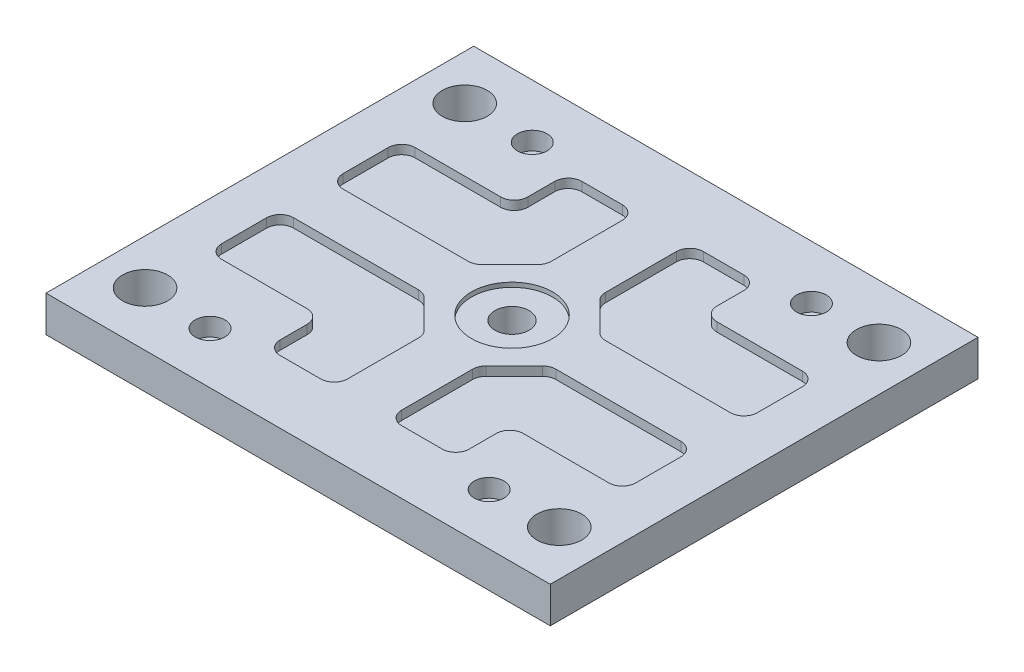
ISO-10303-21;
HEADER;
FILE_DESCRIPTION(('STEP AP214'),'2;1');
FILE_NAME('part.step','',(''),(''),'','','');
FILE_SCHEMA(('AUTOMOTIVE_DESIGN { 1 0 10303 214 1 1 1 1 }'));
ENDSEC;
DATA;
#1=APPLICATION_CONTEXT('core data for automotive mechanical design processes');
#2=APPLICATION_PROTOCOL_DEFINITION('international standard','automotive_design',2000,#1);
#3=PRODUCT_CONTEXT('',#1,'mechanical');
#4=PRODUCT('Part','Part','',(#3));
#5=PRODUCT_RELATED_PRODUCT_CATEGORY('part','',(#4));
#6=PRODUCT_DEFINITION_FORMATION('','',#4);
#7=PRODUCT_DEFINITION_CONTEXT('part definition',#1,'design');
#8=PRODUCT_DEFINITION('design','',#6,#7);
#9=PRODUCT_DEFINITION_SHAPE('','',#8);
#10=(LENGTH_UNIT() NAMED_UNIT(*) SI_UNIT(.MILLI.,.METRE.));
#11=(NAMED_UNIT(*) PLANE_ANGLE_UNIT() SI_UNIT($,.RADIAN.));
#12=(NAMED_UNIT(*) SI_UNIT($,.STERADIAN.) SOLID_ANGLE_UNIT());
#13=UNCERTAINTY_MEASURE_WITH_UNIT(LENGTH_MEASURE(1.E-05),#10,'distance_accuracy_value','');
#14=(GEOMETRIC_REPRESENTATION_CONTEXT(3) GLOBAL_UNCERTAINTY_ASSIGNED_CONTEXT((#13)) GLOBAL_UNIT_ASSIGNED_CONTEXT((#10,
#11,#12)) REPRESENTATION_CONTEXT('',''));
#15=CARTESIAN_POINT('',(0.,0.,0.));
#16=DIRECTION('',(0.,0.,1.));
#17=DIRECTION('',(1.,0.,0.));
#18=AXIS2_PLACEMENT_3D('',#15,#16,#17);
#19=CARTESIAN_POINT('',(0.,0.,0.));
#20=DIRECTION('',(0.,-1.,0.));
#21=DIRECTION('',(0.,0.,-1.));
#22=AXIS2_PLACEMENT_3D('',#19,#20,#21);
#23=PLANE('',#22);
#24=CARTESIAN_POINT('',(120.,0.,-122.5));
#25=DIRECTION('',(0.,1.,0.));
#26=DIRECTION('',(0.,0.,-1.));
#27=AXIS2_PLACEMENT_3D('',#24,#25,#26);
#28=CIRCLE('',#27,15.0000000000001);
#29=CARTESIAN_POINT('',(105.,0.,-122.5));
#30=VERTEX_POINT('',#29);
#31=CARTESIAN_POINT('',(120.,0.,-107.5));
#32=VERTEX_POINT('',#31);
#33=EDGE_CURVE('E54',#30,#32,#28,.T.);
#34=ORIENTED_EDGE('',*,*,#33,.F.);
#35=DIRECTION('',(0.,0.,1.));
#36=VECTOR('',#35,1.);
#37=CARTESIAN_POINT('',(105.,0.,-122.5));
#38=LINE('',#37,#36);
#39=CARTESIAN_POINT('',(105.,0.,-152.5));
#40=VERTEX_POINT('',#39);
#41=EDGE_CURVE('E1028',#40,#30,#38,.T.);
#42=ORIENTED_EDGE('',*,*,#41,.F.);
#43=CARTESIAN_POINT('',(90.,0.,-152.5));
#44=DIRECTION('',(0.,-1.,0.));
#45=DIRECTION('',(0.,0.,1.));
#46=AXIS2_PLACEMENT_3D('',#43,#44,#45);
#47=CIRCLE('',#46,15.);
#48=CARTESIAN_POINT('',(90.,0.,-167.5));
#49=VERTEX_POINT('',#48);
#50=EDGE_CURVE('E4017',#49,#40,#47,.T.);
#51=ORIENTED_EDGE('',*,*,#50,.F.);
#52=DIRECTION('',(1.,0.,0.));
#53=VECTOR('',#52,1.);
#54=CARTESIAN_POINT('',(90.,0.,-167.5));
#55=LINE('',#54,#53);
#56=CARTESIAN_POINT('',(45.,0.,-167.5));
#57=VERTEX_POINT('',#56);
#58=EDGE_CURVE('E4018',#57,#49,#55,.T.);
#59=ORIENTED_EDGE('',*,*,#58,.F.);
#60=CARTESIAN_POINT('',(45.,0.,-152.5));
#61=DIRECTION('',(0.,-1.,0.));
#62=DIRECTION('',(0.,0.,-1.));
#63=AXIS2_PLACEMENT_3D('',#60,#61,#62);
#64=CIRCLE('',#63,15.0000000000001);
#65=CARTESIAN_POINT('',(30.,0.,-152.5));
#66=VERTEX_POINT('',#65);
#67=EDGE_CURVE('E3784',#66,#57,#64,.T.);
#68=ORIENTED_EDGE('',*,*,#67,.F.);
#69=DIRECTION('',(0.,0.,-1.));
#70=VECTOR('',#69,1.);
#71=CARTESIAN_POINT('',(30.,0.,-152.5));
#72=LINE('',#71,#70);
#73=CARTESIAN_POINT('',(30.,0.,-73.7132034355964));
#74=VERTEX_POINT('',#73);
#75=EDGE_CURVE('E3778',#74,#66,#72,.T.);
#76=ORIENTED_EDGE('',*,*,#75,.F.);
#77=CARTESIAN_POINT('',(45.0000000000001,0.,-73.7132034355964));
#78=DIRECTION('',(0.,-1.,0.));
#79=DIRECTION('',(0.,0.,1.));
#80=AXIS2_PLACEMENT_3D('',#77,#78,#79);
#81=CIRCLE('',#80,15.0000000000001);
#82=CARTESIAN_POINT('',(34.3933982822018,0.,-63.1066017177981));
#83=VERTEX_POINT('',#82);
#84=EDGE_CURVE('E4031',#83,#74,#81,.T.);
#85=ORIENTED_EDGE('',*,*,#84,.F.);
#86=DIRECTION('',(-0.707106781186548,0.,-0.707106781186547));
#87=VECTOR('',#86,1.);
#88=CARTESIAN_POINT('',(34.3933982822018,0.,-63.1066017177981));
#89=LINE('',#88,#87);
#90=CARTESIAN_POINT('',(65.6066017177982,0.,-31.8933982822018));
#91=VERTEX_POINT('',#90);
#92=EDGE_CURVE('E3767',#91,#83,#89,.T.);
#93=ORIENTED_EDGE('',*,*,#92,.F.);
#94=CARTESIAN_POINT('',(76.2132034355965,0.,-42.5000000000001));
#95=DIRECTION('',(0.,-1.,0.));
#96=DIRECTION('',(0.,0.,1.));
#97=AXIS2_PLACEMENT_3D('',#94,#95,#96);
#98=CIRCLE('',#97,15.0000000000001);
#99=CARTESIAN_POINT('',(76.2132034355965,0.,-27.5));
#100=VERTEX_POINT('',#99);
#101=EDGE_CURVE('E3761',#100,#91,#98,.T.);
#102=ORIENTED_EDGE('',*,*,#101,.F.);
#103=DIRECTION('',(-1.,0.,0.));
#104=VECTOR('',#103,1.);
#105=CARTESIAN_POINT('',(76.2132034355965,0.,-27.5));
#106=LINE('',#105,#104);
#107=CARTESIAN_POINT('',(215.,0.,-27.5));
#108=VERTEX_POINT('',#107);
#109=EDGE_CURVE('E4042',#108,#100,#106,.T.);
#110=ORIENTED_EDGE('',*,*,#109,.F.);
#111=CARTESIAN_POINT('',(215.,0.,-42.5000000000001));
#112=DIRECTION('',(0.,-1.,0.));
#113=DIRECTION('',(0.,0.,1.));
#114=AXIS2_PLACEMENT_3D('',#111,#112,#113);
#115=CIRCLE('',#114,15.0000000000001);
#116=CARTESIAN_POINT('',(230.,0.,-42.5000000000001));
#117=VERTEX_POINT('',#116);
#118=EDGE_CURVE('E3751',#117,#108,#115,.T.);
#119=ORIENTED_EDGE('',*,*,#118,.F.);
#120=DIRECTION('',(0.,0.,1.));
#121=VECTOR('',#120,1.);
#122=CARTESIAN_POINT('',(230.,0.,-42.5000000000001));
#123=LINE('',#122,#121);
#124=CARTESIAN_POINT('',(230.,0.,-92.5));
#125=VERTEX_POINT('',#124);
#126=EDGE_CURVE('E3746',#125,#117,#123,.T.);
#127=ORIENTED_EDGE('',*,*,#126,.F.);
#128=CARTESIAN_POINT('',(215.,0.,-92.5));
#129=DIRECTION('',(0.,-1.,0.));
#130=DIRECTION('',(0.,0.,1.));
#131=AXIS2_PLACEMENT_3D('',#128,#129,#130);
#132=CIRCLE('',#131,15.);
#133=CARTESIAN_POINT('',(215.,0.,-107.5));
#134=VERTEX_POINT('',#133);
#135=EDGE_CURVE('E4053',#134,#125,#132,.T.);
#136=ORIENTED_EDGE('',*,*,#135,.F.);
#137=DIRECTION('',(1.,0.,0.));
#138=VECTOR('',#137,1.);
#139=CARTESIAN_POINT('',(215.,0.,-107.5));
#140=LINE('',#139,#138);
#141=EDGE_CURVE('E3737',#32,#134,#140,.T.);
#142=ORIENTED_EDGE('',*,*,#141,.F.);
#143=EDGE_LOOP('',(#34,#42,#51,#59,#68,#76,#85,#93,#102,#110,#119,#127,#136,#142));
#144=FACE_BOUND('',#143,.T.);
#145=CARTESIAN_POINT('',(120.,0.,122.5));
#146=DIRECTION('',(0.,1.,0.));
#147=DIRECTION('',(0.,0.,1.));
#148=AXIS2_PLACEMENT_3D('',#145,#146,#147);
#149=CIRCLE('',#148,15.0000000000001);
#150=CARTESIAN_POINT('',(120.,0.,107.5));
#151=VERTEX_POINT('',#150);
#152=CARTESIAN_POINT('',(105.,0.,122.5));
#153=VERTEX_POINT('',#152);
#154=EDGE_CURVE('E62',#151,#153,#149,.T.);
#155=ORIENTED_EDGE('',*,*,#154,.F.);
#156=DIRECTION('',(-1.,0.,0.));
#157=VECTOR('',#156,1.);
#158=CARTESIAN_POINT('',(215.,0.,107.5));
#159=LINE('',#158,#157);
#160=CARTESIAN_POINT('',(215.,0.,107.5));
#161=VERTEX_POINT('',#160);
#162=EDGE_CURVE('E944',#161,#151,#159,.T.);
#163=ORIENTED_EDGE('',*,*,#162,.F.);
#164=CARTESIAN_POINT('',(215.,0.,92.5));
#165=DIRECTION('',(0.,-1.,0.));
#166=DIRECTION('',(0.,0.,-1.));
#167=AXIS2_PLACEMENT_3D('',#164,#165,#166);
#168=CIRCLE('',#167,15.);
#169=CARTESIAN_POINT('',(230.,0.,92.5));
#170=VERTEX_POINT('',#169);
#171=EDGE_CURVE('E1291',#170,#161,#168,.T.);
#172=ORIENTED_EDGE('',*,*,#171,.F.);
#173=DIRECTION('',(0.,0.,1.));
#174=VECTOR('',#173,1.);
#175=CARTESIAN_POINT('',(230.,0.,42.5000000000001));
#176=LINE('',#175,#174);
#177=CARTESIAN_POINT('',(230.,0.,42.5000000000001));
#178=VERTEX_POINT('',#177);
#179=EDGE_CURVE('E1287',#178,#170,#176,.T.);
#180=ORIENTED_EDGE('',*,*,#179,.F.);
#181=CARTESIAN_POINT('',(215.,0.,42.5000000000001));
#182=DIRECTION('',(0.,-1.,0.));
#183=DIRECTION('',(0.,0.,-1.));
#184=AXIS2_PLACEMENT_3D('',#181,#182,#183);
#185=CIRCLE('',#184,15.0000000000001);
#186=CARTESIAN_POINT('',(215.,0.,27.5));
#187=VERTEX_POINT('',#186);
#188=EDGE_CURVE('E1283',#187,#178,#185,.T.);
#189=ORIENTED_EDGE('',*,*,#188,.F.);
#190=DIRECTION('',(1.,0.,0.));
#191=VECTOR('',#190,1.);
#192=CARTESIAN_POINT('',(76.2132034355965,0.,27.5));
#193=LINE('',#192,#191);
#194=CARTESIAN_POINT('',(76.2132034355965,0.,27.5));
#195=VERTEX_POINT('',#194);
#196=EDGE_CURVE('E1279',#195,#187,#193,.T.);
#197=ORIENTED_EDGE('',*,*,#196,.F.);
#198=CARTESIAN_POINT('',(76.2132034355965,0.,42.5000000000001));
#199=DIRECTION('',(0.,-1.,0.));
#200=DIRECTION('',(0.,0.,-1.));
#201=AXIS2_PLACEMENT_3D('',#198,#199,#200);
#202=CIRCLE('',#201,15.0000000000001);
#203=CARTESIAN_POINT('',(65.6066017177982,0.,31.8933982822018));
#204=VERTEX_POINT('',#203);
#205=EDGE_CURVE('E1276',#204,#195,#202,.T.);
#206=ORIENTED_EDGE('',*,*,#205,.F.);
#207=DIRECTION('',(0.707106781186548,0.,-0.707106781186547));
#208=VECTOR('',#207,1.);
#209=CARTESIAN_POINT('',(34.3933982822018,0.,63.1066017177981));
#210=LINE('',#209,#208);
#211=CARTESIAN_POINT('',(34.3933982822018,0.,63.1066017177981));
#212=VERTEX_POINT('',#211);
#213=EDGE_CURVE('E1268',#212,#204,#210,.T.);
#214=ORIENTED_EDGE('',*,*,#213,.F.);
#215=CARTESIAN_POINT('',(45.0000000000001,0.,73.7132034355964));
#216=DIRECTION('',(0.,-1.,0.));
#217=DIRECTION('',(0.,0.,-1.));
#218=AXIS2_PLACEMENT_3D('',#215,#216,#217);
#219=CIRCLE('',#218,15.0000000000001);
#220=CARTESIAN_POINT('',(30.,0.,73.7132034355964));
#221=VERTEX_POINT('',#220);
#222=EDGE_CURVE('E1264',#221,#212,#219,.T.);
#223=ORIENTED_EDGE('',*,*,#222,.F.);
#224=DIRECTION('',(0.,0.,-1.));
#225=VECTOR('',#224,1.);
#226=CARTESIAN_POINT('',(30.,0.,152.5));
#227=LINE('',#226,#225);
#228=CARTESIAN_POINT('',(30.,0.,152.5));
#229=VERTEX_POINT('',#228);
#230=EDGE_CURVE('E1260',#229,#221,#227,.T.);
#231=ORIENTED_EDGE('',*,*,#230,.F.);
#232=CARTESIAN_POINT('',(45.,0.,152.5));
#233=DIRECTION('',(0.,-1.,0.));
#234=DIRECTION('',(0.,0.,1.));
#235=AXIS2_PLACEMENT_3D('',#232,#233,#234);
#236=CIRCLE('',#235,15.0000000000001);
#237=CARTESIAN_POINT('',(45.,0.,167.5));
#238=VERTEX_POINT('',#237);
#239=EDGE_CURVE('E1257',#238,#229,#236,.T.);
#240=ORIENTED_EDGE('',*,*,#239,.F.);
#241=DIRECTION('',(-1.,0.,0.));
#242=VECTOR('',#241,1.);
#243=CARTESIAN_POINT('',(90.,0.,167.5));
#244=LINE('',#243,#242);
#245=CARTESIAN_POINT('',(90.,0.,167.5));
#246=VERTEX_POINT('',#245);
#247=EDGE_CURVE('E1249',#246,#238,#244,.T.);
#248=ORIENTED_EDGE('',*,*,#247,.F.);
#249=CARTESIAN_POINT('',(90.,0.,152.5));
#250=DIRECTION('',(0.,-1.,0.));
#251=DIRECTION('',(0.,0.,-1.));
#252=AXIS2_PLACEMENT_3D('',#249,#250,#251);
#253=CIRCLE('',#252,15.);
#254=CARTESIAN_POINT('',(105.,0.,152.5));
#255=VERTEX_POINT('',#254);
#256=EDGE_CURVE('E1245',#255,#246,#253,.T.);
#257=ORIENTED_EDGE('',*,*,#256,.F.);
#258=DIRECTION('',(0.,0.,1.));
#259=VECTOR('',#258,1.);
#260=CARTESIAN_POINT('',(105.,0.,122.5));
#261=LINE('',#260,#259);
#262=EDGE_CURVE('E1240',#153,#255,#261,.T.);
#263=ORIENTED_EDGE('',*,*,#262,.F.);
#264=EDGE_LOOP('',(#155,#163,#172,#180,#189,#197,#206,#214,#223,#231,#240,#248,#257,#263));
#265=FACE_BOUND('',#264,.T.);
#266=CARTESIAN_POINT('',(-120.,0.,122.5));
#267=DIRECTION('',(0.,1.,0.));
#268=DIRECTION('',(0.,0.,-1.));
#269=AXIS2_PLACEMENT_3D('',#266,#267,#268);
#270=CIRCLE('',#269,15.0000000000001);
#271=CARTESIAN_POINT('',(-105.,0.,122.5));
#272=VERTEX_POINT('',#271);
#273=CARTESIAN_POINT('',(-120.,0.,107.5));
#274=VERTEX_POINT('',#273);
#275=EDGE_CURVE('E759',#272,#274,#270,.T.);
#276=ORIENTED_EDGE('',*,*,#275,.F.);
#277=DIRECTION('',(0.,0.,-1.));
#278=VECTOR('',#277,1.);
#279=CARTESIAN_POINT('',(-105.,0.,122.5));
#280=LINE('',#279,#278);
#281=CARTESIAN_POINT('',(-105.,0.,152.5));
#282=VERTEX_POINT('',#281);
#283=EDGE_CURVE('E777',#282,#272,#280,.T.);
#284=ORIENTED_EDGE('',*,*,#283,.F.);
#285=CARTESIAN_POINT('',(-90.,0.,152.5));
#286=DIRECTION('',(0.,-1.,0.));
#287=DIRECTION('',(0.,0.,1.));
#288=AXIS2_PLACEMENT_3D('',#285,#286,#287);
#289=CIRCLE('',#288,15.);
#290=CARTESIAN_POINT('',(-90.,0.,167.5));
#291=VERTEX_POINT('',#290);
#292=EDGE_CURVE('E780',#291,#282,#289,.T.);
#293=ORIENTED_EDGE('',*,*,#292,.F.);
#294=DIRECTION('',(-1.,0.,0.));
#295=VECTOR('',#294,1.);
#296=CARTESIAN_POINT('',(-90.,0.,167.5));
#297=LINE('',#296,#295);
#298=CARTESIAN_POINT('',(-45.,0.,167.5));
#299=VERTEX_POINT('',#298);
#300=EDGE_CURVE('E1144',#299,#291,#297,.T.);
#301=ORIENTED_EDGE('',*,*,#300,.F.);
#302=CARTESIAN_POINT('',(-45.,0.,152.5));
#303=DIRECTION('',(0.,-1.,0.));
#304=DIRECTION('',(0.,0.,-1.));
#305=AXIS2_PLACEMENT_3D('',#302,#303,#304);
#306=CIRCLE('',#305,15.);
#307=CARTESIAN_POINT('',(-30.,0.,152.5));
#308=VERTEX_POINT('',#307);
#309=EDGE_CURVE('E1140',#308,#299,#306,.T.);
#310=ORIENTED_EDGE('',*,*,#309,.F.);
#311=DIRECTION('',(0.,0.,1.));
#312=VECTOR('',#311,1.);
#313=CARTESIAN_POINT('',(-30.,0.,152.5));
#314=LINE('',#313,#312);
#315=CARTESIAN_POINT('',(-30.,0.,73.7132034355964));
#316=VERTEX_POINT('',#315);
#317=EDGE_CURVE('E1136',#316,#308,#314,.T.);
#318=ORIENTED_EDGE('',*,*,#317,.F.);
#319=CARTESIAN_POINT('',(-45.,0.,73.7132034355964));
#320=DIRECTION('',(0.,-1.,0.));
#321=DIRECTION('',(0.,0.,1.));
#322=AXIS2_PLACEMENT_3D('',#319,#320,#321);
#323=CIRCLE('',#322,15.0000000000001);
#324=CARTESIAN_POINT('',(-34.3933982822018,0.,63.1066017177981));
#325=VERTEX_POINT('',#324);
#326=EDGE_CURVE('E1133',#325,#316,#323,.T.);
#327=ORIENTED_EDGE('',*,*,#326,.F.);
#328=DIRECTION('',(0.707106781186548,0.,0.707106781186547));
#329=VECTOR('',#328,1.);
#330=CARTESIAN_POINT('',(-34.3933982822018,0.,63.1066017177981));
#331=LINE('',#330,#329);
#332=CARTESIAN_POINT('',(-65.6066017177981,0.,31.8933982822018));
#333=VERTEX_POINT('',#332);
#334=EDGE_CURVE('E1125',#333,#325,#331,.T.);
#335=ORIENTED_EDGE('',*,*,#334,.F.);
#336=CARTESIAN_POINT('',(-76.2132034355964,0.,42.5));
#337=DIRECTION('',(0.,-1.,0.));
#338=DIRECTION('',(0.,0.,1.));
#339=AXIS2_PLACEMENT_3D('',#336,#337,#338);
#340=CIRCLE('',#339,15.0000000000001);
#341=CARTESIAN_POINT('',(-76.2132034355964,0.,27.5));
#342=VERTEX_POINT('',#341);
#343=EDGE_CURVE('E1121',#342,#333,#340,.T.);
#344=ORIENTED_EDGE('',*,*,#343,.F.);
#345=DIRECTION('',(1.,0.,0.));
#346=VECTOR('',#345,1.);
#347=CARTESIAN_POINT('',(-76.2132034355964,0.,27.5));
#348=LINE('',#347,#346);
#349=CARTESIAN_POINT('',(-215.,0.,27.4999999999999));
#350=VERTEX_POINT('',#349);
#351=EDGE_CURVE('E1117',#350,#342,#348,.T.);
#352=ORIENTED_EDGE('',*,*,#351,.F.);
#353=CARTESIAN_POINT('',(-215.,0.,42.5));
#354=DIRECTION('',(0.,-1.,0.));
#355=DIRECTION('',(0.,0.,1.));
#356=AXIS2_PLACEMENT_3D('',#353,#354,#355);
#357=CIRCLE('',#356,15.0000000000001);
#358=CARTESIAN_POINT('',(-230.,0.,42.5));
#359=VERTEX_POINT('',#358);
#360=EDGE_CURVE('E1114',#359,#350,#357,.T.);
#361=ORIENTED_EDGE('',*,*,#360,.F.);
#362=DIRECTION('',(0.,0.,-1.));
#363=VECTOR('',#362,1.);
#364=CARTESIAN_POINT('',(-230.,0.,42.5));
#365=LINE('',#364,#363);
#366=CARTESIAN_POINT('',(-230.,0.,92.4999999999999));
#367=VERTEX_POINT('',#366);
#368=EDGE_CURVE('E1106',#367,#359,#365,.T.);
#369=ORIENTED_EDGE('',*,*,#368,.F.);
#370=CARTESIAN_POINT('',(-215.,0.,92.4999999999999));
#371=DIRECTION('',(0.,-1.,0.));
#372=DIRECTION('',(0.,0.,1.));
#373=AXIS2_PLACEMENT_3D('',#370,#371,#372);
#374=CIRCLE('',#373,15.);
#375=CARTESIAN_POINT('',(-215.,0.,107.5));
#376=VERTEX_POINT('',#375);
#377=EDGE_CURVE('E1102',#376,#367,#374,.T.);
#378=ORIENTED_EDGE('',*,*,#377,.F.);
#379=DIRECTION('',(-1.,0.,0.));
#380=VECTOR('',#379,1.);
#381=CARTESIAN_POINT('',(-215.,0.,107.5));
#382=LINE('',#381,#380);
#383=EDGE_CURVE('E1098',#274,#376,#382,.T.);
#384=ORIENTED_EDGE('',*,*,#383,.F.);
#385=EDGE_LOOP('',(#276,#284,#293,#301,#310,#318,#327,#335,#344,#352,#361,#369,#378,#384));
#386=FACE_BOUND('',#385,.T.);
#387=CARTESIAN_POINT('',(-120.,0.,-122.5));
#388=DIRECTION('',(0.,1.,0.));
#389=DIRECTION('',(0.,0.,1.));
#390=AXIS2_PLACEMENT_3D('',#387,#388,#389);
#391=CIRCLE('',#390,15.);
#392=CARTESIAN_POINT('',(-120.,0.,-107.5));
#393=VERTEX_POINT('',#392);
#394=CARTESIAN_POINT('',(-105.,0.,-122.5));
#395=VERTEX_POINT('',#394);
#396=EDGE_CURVE('E847',#393,#395,#391,.T.);
#397=ORIENTED_EDGE('',*,*,#396,.F.);
#398=DIRECTION('',(1.,0.,0.));
#399=VECTOR('',#398,1.);
#400=CARTESIAN_POINT('',(-215.,0.,-107.5));
#401=LINE('',#400,#399);
#402=CARTESIAN_POINT('',(-215.,0.,-107.5));
#403=VERTEX_POINT('',#402);
#404=EDGE_CURVE('E911',#403,#393,#401,.T.);
#405=ORIENTED_EDGE('',*,*,#404,.F.);
#406=CARTESIAN_POINT('',(-215.,0.,-92.4999999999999));
#407=DIRECTION('',(0.,-1.,0.));
#408=DIRECTION('',(0.,0.,-1.));
#409=AXIS2_PLACEMENT_3D('',#406,#407,#408);
#410=CIRCLE('',#409,15.);
#411=CARTESIAN_POINT('',(-230.,0.,-92.4999999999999));
#412=VERTEX_POINT('',#411);
#413=EDGE_CURVE('E908',#412,#403,#410,.T.);
#414=ORIENTED_EDGE('',*,*,#413,.F.);
#415=DIRECTION('',(0.,0.,-1.));
#416=VECTOR('',#415,1.);
#417=CARTESIAN_POINT('',(-230.,0.,-42.5));
#418=LINE('',#417,#416);
#419=CARTESIAN_POINT('',(-230.,0.,-42.5));
#420=VERTEX_POINT('',#419);
#421=EDGE_CURVE('E900',#420,#412,#418,.T.);
#422=ORIENTED_EDGE('',*,*,#421,.F.);
#423=CARTESIAN_POINT('',(-215.,0.,-42.5));
#424=DIRECTION('',(0.,-1.,0.));
#425=DIRECTION('',(0.,0.,-1.));
#426=AXIS2_PLACEMENT_3D('',#423,#424,#425);
#427=CIRCLE('',#426,15.0000000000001);
#428=CARTESIAN_POINT('',(-215.,0.,-27.5));
#429=VERTEX_POINT('',#428);
#430=EDGE_CURVE('E896',#429,#420,#427,.T.);
#431=ORIENTED_EDGE('',*,*,#430,.F.);
#432=DIRECTION('',(-1.,0.,0.));
#433=VECTOR('',#432,1.);
#434=CARTESIAN_POINT('',(-76.2132034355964,0.,-27.5));
#435=LINE('',#434,#433);
#436=CARTESIAN_POINT('',(-76.2132034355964,0.,-27.5));
#437=VERTEX_POINT('',#436);
#438=EDGE_CURVE('E892',#437,#429,#435,.T.);
#439=ORIENTED_EDGE('',*,*,#438,.F.);
#440=CARTESIAN_POINT('',(-76.2132034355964,0.,-42.5));
#441=DIRECTION('',(0.,-1.,0.));
#442=DIRECTION('',(0.,0.,-1.));
#443=AXIS2_PLACEMENT_3D('',#440,#441,#442);
#444=CIRCLE('',#443,15.0000000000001);
#445=CARTESIAN_POINT('',(-65.6066017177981,0.,-31.8933982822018));
#446=VERTEX_POINT('',#445);
#447=EDGE_CURVE('E889',#446,#437,#444,.T.);
#448=ORIENTED_EDGE('',*,*,#447,.F.);
#449=DIRECTION('',(-0.707106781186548,0.,0.707106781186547));
#450=VECTOR('',#449,1.);
#451=CARTESIAN_POINT('',(-34.3933982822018,0.,-63.1066017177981));
#452=LINE('',#451,#450);
#453=CARTESIAN_POINT('',(-34.3933982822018,0.,-63.1066017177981));
#454=VERTEX_POINT('',#453);
#455=EDGE_CURVE('E881',#454,#446,#452,.T.);
#456=ORIENTED_EDGE('',*,*,#455,.F.);
#457=CARTESIAN_POINT('',(-45.,0.,-73.7132034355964));
#458=DIRECTION('',(0.,-1.,0.));
#459=DIRECTION('',(0.,0.,-1.));
#460=AXIS2_PLACEMENT_3D('',#457,#458,#459);
#461=CIRCLE('',#460,15.0000000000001);
#462=CARTESIAN_POINT('',(-30.,0.,-73.7132034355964));
#463=VERTEX_POINT('',#462);
#464=EDGE_CURVE('E877',#463,#454,#461,.T.);
#465=ORIENTED_EDGE('',*,*,#464,.F.);
#466=DIRECTION('',(0.,0.,1.));
#467=VECTOR('',#466,1.);
#468=CARTESIAN_POINT('',(-30.,0.,-152.5));
#469=LINE('',#468,#467);
#470=CARTESIAN_POINT('',(-30.,0.,-152.5));
#471=VERTEX_POINT('',#470);
#472=EDGE_CURVE('E873',#471,#463,#469,.T.);
#473=ORIENTED_EDGE('',*,*,#472,.F.);
#474=CARTESIAN_POINT('',(-45.,0.,-152.5));
#475=DIRECTION('',(0.,-1.,0.));
#476=DIRECTION('',(0.,0.,1.));
#477=AXIS2_PLACEMENT_3D('',#474,#475,#476);
#478=CIRCLE('',#477,15.);
#479=CARTESIAN_POINT('',(-45.,0.,-167.5));
#480=VERTEX_POINT('',#479);
#481=EDGE_CURVE('E870',#480,#471,#478,.T.);
#482=ORIENTED_EDGE('',*,*,#481,.F.);
#483=DIRECTION('',(1.,0.,0.));
#484=VECTOR('',#483,1.);
#485=CARTESIAN_POINT('',(-90.,0.,-167.5));
#486=LINE('',#485,#484);
#487=CARTESIAN_POINT('',(-90.,0.,-167.5));
#488=VERTEX_POINT('',#487);
#489=EDGE_CURVE('E862',#488,#480,#486,.T.);
#490=ORIENTED_EDGE('',*,*,#489,.F.);
#491=CARTESIAN_POINT('',(-90.,0.,-152.5));
#492=DIRECTION('',(0.,-1.,0.));
#493=DIRECTION('',(0.,0.,-1.));
#494=AXIS2_PLACEMENT_3D('',#491,#492,#493);
#495=CIRCLE('',#494,15.);
#496=CARTESIAN_POINT('',(-105.,0.,-152.5));
#497=VERTEX_POINT('',#496);
#498=EDGE_CURVE('E858',#497,#488,#495,.T.);
#499=ORIENTED_EDGE('',*,*,#498,.F.);
#500=DIRECTION('',(0.,0.,-1.));
#501=VECTOR('',#500,1.);
#502=CARTESIAN_POINT('',(-105.,0.,-122.5));
#503=LINE('',#502,#501);
#504=EDGE_CURVE('E850',#395,#497,#503,.T.);
#505=ORIENTED_EDGE('',*,*,#504,.F.);
#506=EDGE_LOOP('',(#397,#405,#414,#422,#431,#439,#448,#456,#465,#473,#482,#490,#499,#505));
#507=FACE_BOUND('',#506,.T.);
#508=CARTESIAN_POINT('',(0.,0.,0.));
#509=DIRECTION('',(0.,1.,0.));
#510=DIRECTION('',(0.,0.,1.));
#511=AXIS2_PLACEMENT_3D('',#508,#509,#510);
#512=CIRCLE('',#511,19.);
#513=CARTESIAN_POINT('',(0.,0.,19.));
#514=VERTEX_POINT('',#513);
#515=EDGE_CURVE('E1571',#514,#514,#512,.T.);
#516=ORIENTED_EDGE('',*,*,#515,.T.);
#517=EDGE_LOOP('',(#516));
#518=FACE_BOUND('',#517,.T.);
#519=CARTESIAN_POINT('',(-155.,0.,-177.5));
#520=DIRECTION('',(0.,1.,0.));
#521=DIRECTION('',(0.,0.,1.));
#522=AXIS2_PLACEMENT_3D('',#519,#520,#521);
#523=CIRCLE('',#522,11.);
#524=CARTESIAN_POINT('',(-155.,0.,-166.5));
#525=VERTEX_POINT('',#524);
#526=EDGE_CURVE('E1588',#525,#525,#523,.T.);
#527=ORIENTED_EDGE('',*,*,#526,.T.);
#528=EDGE_LOOP('',(#527));
#529=FACE_BOUND('',#528,.T.);
#530=DIRECTION('',(0.,0.,-1.));
#531=VECTOR('',#530,1.);
#532=CARTESIAN_POINT('',(280.,0.,237.5));
#533=LINE('',#532,#531);
#534=CARTESIAN_POINT('',(280.,0.,237.5));
#535=VERTEX_POINT('',#534);
#536=CARTESIAN_POINT('',(280.,0.,-237.5));
#537=VERTEX_POINT('',#536);
#538=EDGE_CURVE('E1693',#535,#537,#533,.T.);
#539=ORIENTED_EDGE('',*,*,#538,.F.);
#540=DIRECTION('',(1.,0.,0.));
#541=VECTOR('',#540,1.);
#542=CARTESIAN_POINT('',(-280.,0.,237.5));
#543=LINE('',#542,#541);
#544=CARTESIAN_POINT('',(-280.,0.,237.5));
#545=VERTEX_POINT('',#544);
#546=EDGE_CURVE('E1686',#545,#535,#543,.T.);
#547=ORIENTED_EDGE('',*,*,#546,.F.);
#548=DIRECTION('',(0.,0.,1.));
#549=VECTOR('',#548,1.);
#550=CARTESIAN_POINT('',(-280.,0.,237.5));
#551=LINE('',#550,#549);
#552=CARTESIAN_POINT('',(-280.,0.,-237.5));
#553=VERTEX_POINT('',#552);
#554=EDGE_CURVE('E1709',#553,#545,#551,.T.);
#555=ORIENTED_EDGE('',*,*,#554,.F.);
#556=DIRECTION('',(-1.,0.,0.));
#557=VECTOR('',#556,1.);
#558=CARTESIAN_POINT('',(-280.,0.,-237.5));
#559=LINE('',#558,#557);
#560=EDGE_CURVE('E1697',#537,#553,#559,.T.);
#561=ORIENTED_EDGE('',*,*,#560,.F.);
#562=EDGE_LOOP('',(#539,#547,#555,#561));
#563=FACE_BOUND('',#562,.T.);
#564=CARTESIAN_POINT('',(-230.,0.,-177.5));
#565=DIRECTION('',(0.,1.,0.));
#566=DIRECTION('',(0.,0.,1.));
#567=AXIS2_PLACEMENT_3D('',#564,#565,#566);
#568=CIRCLE('',#567,25.);
#569=CARTESIAN_POINT('',(-230.,0.,-152.5));
#570=VERTEX_POINT('',#569);
#571=EDGE_CURVE('E1680',#570,#570,#568,.T.);
#572=ORIENTED_EDGE('',*,*,#571,.T.);
#573=EDGE_LOOP('',(#572));
#574=FACE_BOUND('',#573,.T.);
#575=CARTESIAN_POINT('',(230.,0.,177.5));
#576=DIRECTION('',(0.,1.,0.));
#577=DIRECTION('',(0.,0.,1.));
#578=AXIS2_PLACEMENT_3D('',#575,#576,#577);
#579=CIRCLE('',#578,25.);
#580=CARTESIAN_POINT('',(230.,0.,202.5));
#581=VERTEX_POINT('',#580);
#582=EDGE_CURVE('E1649',#581,#581,#579,.T.);
#583=ORIENTED_EDGE('',*,*,#582,.T.);
#584=EDGE_LOOP('',(#583));
#585=FACE_BOUND('',#584,.T.);
#586=CARTESIAN_POINT('',(-230.,0.,177.5));
#587=DIRECTION('',(0.,1.,0.));
#588=DIRECTION('',(0.,0.,1.));
#589=AXIS2_PLACEMENT_3D('',#586,#587,#588);
#590=CIRCLE('',#589,25.);
#591=CARTESIAN_POINT('',(-230.,0.,202.5));
#592=VERTEX_POINT('',#591);
#593=EDGE_CURVE('E1666',#592,#592,#590,.T.);
#594=ORIENTED_EDGE('',*,*,#593,.T.);
#595=EDGE_LOOP('',(#594));
#596=FACE_BOUND('',#595,.T.);
#597=CARTESIAN_POINT('',(230.,0.,-177.5));
#598=DIRECTION('',(0.,1.,0.));
#599=DIRECTION('',(0.,0.,1.));
#600=AXIS2_PLACEMENT_3D('',#597,#598,#599);
#601=CIRCLE('',#600,25.);
#602=CARTESIAN_POINT('',(230.,0.,-152.5));
#603=VERTEX_POINT('',#602);
#604=EDGE_CURVE('E1665',#603,#603,#601,.T.);
#605=ORIENTED_EDGE('',*,*,#604,.T.);
#606=EDGE_LOOP('',(#605));
#607=FACE_BOUND('',#606,.T.);
#608=CARTESIAN_POINT('',(-155.,0.,180.367334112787));
#609=DIRECTION('',(0.,1.,0.));
#610=DIRECTION('',(0.,0.,1.));
#611=AXIS2_PLACEMENT_3D('',#608,#609,#610);
#612=CIRCLE('',#611,11.);
#613=CARTESIAN_POINT('',(-155.,0.,191.367334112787));
#614=VERTEX_POINT('',#613);
#615=EDGE_CURVE('E1642',#614,#614,#612,.T.);
#616=ORIENTED_EDGE('',*,*,#615,.T.);
#617=EDGE_LOOP('',(#616));
#618=FACE_BOUND('',#617,.T.);
#619=CARTESIAN_POINT('',(155.,0.,180.367334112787));
#620=DIRECTION('',(0.,1.,0.));
#621=DIRECTION('',(0.,0.,1.));
#622=AXIS2_PLACEMENT_3D('',#619,#620,#621);
#623=CIRCLE('',#622,11.);
#624=CARTESIAN_POINT('',(155.,0.,191.367334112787));
#625=VERTEX_POINT('',#624);
#626=EDGE_CURVE('E1626',#625,#625,#623,.T.);
#627=ORIENTED_EDGE('',*,*,#626,.T.);
#628=EDGE_LOOP('',(#627));
#629=FACE_BOUND('',#628,.T.);
#630=CARTESIAN_POINT('',(155.,0.,-177.5));
#631=DIRECTION('',(0.,1.,0.));
#632=DIRECTION('',(0.,0.,1.));
#633=AXIS2_PLACEMENT_3D('',#630,#631,#632);
#634=CIRCLE('',#633,11.);
#635=CARTESIAN_POINT('',(155.,0.,-166.5));
#636=VERTEX_POINT('',#635);
#637=EDGE_CURVE('E1608',#636,#636,#634,.T.);
#638=ORIENTED_EDGE('',*,*,#637,.T.);
#639=EDGE_LOOP('',(#638));
#640=FACE_BOUND('',#639,.T.);
#641=ADVANCED_FACE('F39',(#144,#265,#386,#507,#518,#529,#563,#574,#585,#596,#607,#618,#629,
#640),#23,.T.);
#642=CARTESIAN_POINT('',(280.,40.,237.5));
#643=DIRECTION('',(-1.,0.,0.));
#644=DIRECTION('',(0.,0.,1.));
#645=AXIS2_PLACEMENT_3D('',#642,#643,#644);
#646=PLANE('',#645);
#647=ORIENTED_EDGE('',*,*,#538,.T.);
#648=DIRECTION('',(0.,-1.,0.));
#649=VECTOR('',#648,1.);
#650=CARTESIAN_POINT('',(280.,40.,-237.5));
#651=LINE('',#650,#649);
#652=CARTESIAN_POINT('',(280.,40.,-237.5));
#653=VERTEX_POINT('',#652);
#654=EDGE_CURVE('E12',#653,#537,#651,.T.);
#655=ORIENTED_EDGE('',*,*,#654,.F.);
#656=DIRECTION('',(0.,0.,-1.));
#657=VECTOR('',#656,1.);
#658=CARTESIAN_POINT('',(280.,40.,237.5));
#659=LINE('',#658,#657);
#660=CARTESIAN_POINT('',(280.,40.,237.5));
#661=VERTEX_POINT('',#660);
#662=EDGE_CURVE('E1682',#661,#653,#659,.T.);
#663=ORIENTED_EDGE('',*,*,#662,.F.);
#664=DIRECTION('',(0.,-1.,0.));
#665=VECTOR('',#664,1.);
#666=CARTESIAN_POINT('',(280.,40.,237.5));
#667=LINE('',#666,#665);
#668=EDGE_CURVE('E1692',#661,#535,#667,.T.);
#669=ORIENTED_EDGE('',*,*,#668,.T.);
#670=EDGE_LOOP('',(#647,#655,#663,#669));
#671=FACE_BOUND('',#670,.T.);
#672=ADVANCED_FACE('F41',(#671),#646,.F.);
#673=CARTESIAN_POINT('',(-280.,40.,-237.5));
#674=DIRECTION('',(0.,0.,1.));
#675=DIRECTION('',(1.,0.,0.));
#676=AXIS2_PLACEMENT_3D('',#673,#674,#675);
#677=PLANE('',#676);
#678=ORIENTED_EDGE('',*,*,#560,.T.);
#679=DIRECTION('',(0.,-1.,0.));
#680=VECTOR('',#679,1.);
#681=CARTESIAN_POINT('',(-280.,40.,-237.5));
#682=LINE('',#681,#680);
#683=CARTESIAN_POINT('',(-280.,40.,-237.5));
#684=VERTEX_POINT('',#683);
#685=EDGE_CURVE('E47',#684,#553,#682,.T.);
#686=ORIENTED_EDGE('',*,*,#685,.F.);
#687=DIRECTION('',(-1.,0.,0.));
#688=VECTOR('',#687,1.);
#689=CARTESIAN_POINT('',(-280.,40.,-237.5));
#690=LINE('',#689,#688);
#691=EDGE_CURVE('E1685',#653,#684,#690,.T.);
#692=ORIENTED_EDGE('',*,*,#691,.F.);
#693=ORIENTED_EDGE('',*,*,#654,.T.);
#694=EDGE_LOOP('',(#678,#686,#692,#693));
#695=FACE_BOUND('',#694,.T.);
#696=ADVANCED_FACE('F1903',(#695),#677,.F.);
#697=CARTESIAN_POINT('',(-280.,40.,237.5));
#698=DIRECTION('',(1.,0.,0.));
#699=DIRECTION('',(0.,0.,-1.));
#700=AXIS2_PLACEMENT_3D('',#697,#698,#699);
#701=PLANE('',#700);
#702=ORIENTED_EDGE('',*,*,#554,.T.);
#703=DIRECTION('',(0.,-1.,0.));
#704=VECTOR('',#703,1.);
#705=CARTESIAN_POINT('',(-280.,40.,237.5));
#706=LINE('',#705,#704);
#707=CARTESIAN_POINT('',(-280.,40.,237.5));
#708=VERTEX_POINT('',#707);
#709=EDGE_CURVE('E1712',#708,#545,#706,.T.);
#710=ORIENTED_EDGE('',*,*,#709,.F.);
#711=DIRECTION('',(0.,0.,1.));
#712=VECTOR('',#711,1.);
#713=CARTESIAN_POINT('',(-280.,40.,237.5));
#714=LINE('',#713,#712);
#715=EDGE_CURVE('E1688',#684,#708,#714,.T.);
#716=ORIENTED_EDGE('',*,*,#715,.F.);
#717=ORIENTED_EDGE('',*,*,#685,.T.);
#718=EDGE_LOOP('',(#702,#710,#716,#717));
#719=FACE_BOUND('',#718,.T.);
#720=ADVANCED_FACE('F1912',(#719),#701,.F.);
#721=CARTESIAN_POINT('',(-280.,40.,237.5));
#722=DIRECTION('',(0.,0.,-1.));
#723=DIRECTION('',(-1.,0.,0.));
#724=AXIS2_PLACEMENT_3D('',#721,#722,#723);
#725=PLANE('',#724);
#726=ORIENTED_EDGE('',*,*,#546,.T.);
#727=ORIENTED_EDGE('',*,*,#668,.F.);
#728=DIRECTION('',(1.,0.,0.));
#729=VECTOR('',#728,1.);
#730=CARTESIAN_POINT('',(-280.,40.,237.5));
#731=LINE('',#730,#729);
#732=EDGE_CURVE('E1690',#708,#661,#731,.T.);
#733=ORIENTED_EDGE('',*,*,#732,.F.);
#734=ORIENTED_EDGE('',*,*,#709,.T.);
#735=EDGE_LOOP('',(#726,#727,#733,#734));
#736=FACE_BOUND('',#735,.T.);
#737=ADVANCED_FACE('F1909',(#736),#725,.F.);
#738=CARTESIAN_POINT('',(0.,40.,0.));
#739=DIRECTION('',(0.,-1.,0.));
#740=DIRECTION('',(0.,0.,-1.));
#741=AXIS2_PLACEMENT_3D('',#738,#739,#740);
#742=PLANE('',#741);
#743=DIRECTION('',(1.,0.,0.));
#744=VECTOR('',#743,1.);
#745=CARTESIAN_POINT('',(215.,40.,107.5));
#746=LINE('',#745,#744);
#747=CARTESIAN_POINT('',(120.,40.,107.5));
#748=VERTEX_POINT('',#747);
#749=CARTESIAN_POINT('',(215.,40.,107.5));
#750=VERTEX_POINT('',#749);
#751=EDGE_CURVE('E1399',#748,#750,#746,.T.);
#752=ORIENTED_EDGE('',*,*,#751,.F.);
#753=CARTESIAN_POINT('',(120.,40.,122.5));
#754=DIRECTION('',(0.,-1.,0.));
#755=DIRECTION('',(0.,0.,1.));
#756=AXIS2_PLACEMENT_3D('',#753,#754,#755);
#757=CIRCLE('',#756,15.);
#758=CARTESIAN_POINT('',(105.,40.,122.5));
#759=VERTEX_POINT('',#758);
#760=EDGE_CURVE('E919',#759,#748,#757,.T.);
#761=ORIENTED_EDGE('',*,*,#760,.F.);
#762=DIRECTION('',(0.,0.,-1.));
#763=VECTOR('',#762,1.);
#764=CARTESIAN_POINT('',(105.,40.,122.5));
#765=LINE('',#764,#763);
#766=CARTESIAN_POINT('',(105.,40.,152.5));
#767=VERTEX_POINT('',#766);
#768=EDGE_CURVE('E1459',#767,#759,#765,.T.);
#769=ORIENTED_EDGE('',*,*,#768,.F.);
#770=CARTESIAN_POINT('',(90.0000000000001,40.,152.5));
#771=DIRECTION('',(0.,1.,0.));
#772=DIRECTION('',(0.,0.,-1.));
#773=AXIS2_PLACEMENT_3D('',#770,#771,#772);
#774=CIRCLE('',#773,15.);
#775=CARTESIAN_POINT('',(89.9999999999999,40.,167.5));
#776=VERTEX_POINT('',#775);
#777=EDGE_CURVE('E1456',#776,#767,#774,.T.);
#778=ORIENTED_EDGE('',*,*,#777,.F.);
#779=DIRECTION('',(1.,0.,0.));
#780=VECTOR('',#779,1.);
#781=CARTESIAN_POINT('',(89.9999999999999,40.,167.5));
#782=LINE('',#781,#780);
#783=CARTESIAN_POINT('',(45.0000000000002,40.,167.5));
#784=VERTEX_POINT('',#783);
#785=EDGE_CURVE('E1448',#784,#776,#782,.T.);
#786=ORIENTED_EDGE('',*,*,#785,.F.);
#787=CARTESIAN_POINT('',(45.0000000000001,40.,152.5));
#788=DIRECTION('',(0.,1.,0.));
#789=DIRECTION('',(0.,0.,1.));
#790=AXIS2_PLACEMENT_3D('',#787,#788,#789);
#791=CIRCLE('',#790,15.);
#792=CARTESIAN_POINT('',(30.0000000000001,40.,152.5));
#793=VERTEX_POINT('',#792);
#794=EDGE_CURVE('E1444',#793,#784,#791,.T.);
#795=ORIENTED_EDGE('',*,*,#794,.F.);
#796=DIRECTION('',(0.,0.,1.));
#797=VECTOR('',#796,1.);
#798=CARTESIAN_POINT('',(30.0000000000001,40.,152.5));
#799=LINE('',#798,#797);
#800=CARTESIAN_POINT('',(30.0000000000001,40.,73.7132034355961));
#801=VERTEX_POINT('',#800);
#802=EDGE_CURVE('E1440',#801,#793,#799,.T.);
#803=ORIENTED_EDGE('',*,*,#802,.F.);
#804=CARTESIAN_POINT('',(45.0000000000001,40.,73.7132034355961));
#805=DIRECTION('',(0.,1.,0.));
#806=DIRECTION('',(0.,0.,-1.));
#807=AXIS2_PLACEMENT_3D('',#804,#805,#806);
#808=CIRCLE('',#807,15.);
#809=CARTESIAN_POINT('',(34.3933982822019,40.,63.1066017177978));
#810=VERTEX_POINT('',#809);
#811=EDGE_CURVE('E1437',#810,#801,#808,.T.);
#812=ORIENTED_EDGE('',*,*,#811,.F.);
#813=DIRECTION('',(-0.707106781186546,0.,0.707106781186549));
#814=VECTOR('',#813,1.);
#815=CARTESIAN_POINT('',(34.3933982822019,40.,63.1066017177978));
#816=LINE('',#815,#814);
#817=CARTESIAN_POINT('',(65.6066017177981,40.,31.8933982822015));
#818=VERTEX_POINT('',#817);
#819=EDGE_CURVE('E1429',#818,#810,#816,.T.);
#820=ORIENTED_EDGE('',*,*,#819,.F.);
#821=CARTESIAN_POINT('',(76.2132034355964,40.,42.4999999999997));
#822=DIRECTION('',(0.,1.,0.));
#823=DIRECTION('',(0.,0.,-1.));
#824=AXIS2_PLACEMENT_3D('',#821,#822,#823);
#825=CIRCLE('',#824,15.);
#826=CARTESIAN_POINT('',(76.2132034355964,40.,27.4999999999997));
#827=VERTEX_POINT('',#826);
#828=EDGE_CURVE('E1425',#827,#818,#825,.T.);
#829=ORIENTED_EDGE('',*,*,#828,.F.);
#830=DIRECTION('',(-1.,0.,0.));
#831=VECTOR('',#830,1.);
#832=CARTESIAN_POINT('',(76.2132034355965,40.,27.4999999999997));
#833=LINE('',#832,#831);
#834=CARTESIAN_POINT('',(215.,40.,27.4999999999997));
#835=VERTEX_POINT('',#834);
#836=EDGE_CURVE('E1421',#835,#827,#833,.T.);
#837=ORIENTED_EDGE('',*,*,#836,.F.);
#838=CARTESIAN_POINT('',(215.,40.,42.4999999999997));
#839=DIRECTION('',(0.,1.,0.));
#840=DIRECTION('',(0.,0.,-1.));
#841=AXIS2_PLACEMENT_3D('',#838,#839,#840);
#842=CIRCLE('',#841,15.);
#843=CARTESIAN_POINT('',(230.,40.,42.4999999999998));
#844=VERTEX_POINT('',#843);
#845=EDGE_CURVE('E1418',#844,#835,#842,.T.);
#846=ORIENTED_EDGE('',*,*,#845,.F.);
#847=DIRECTION('',(0.,0.,-1.));
#848=VECTOR('',#847,1.);
#849=CARTESIAN_POINT('',(230.,40.,42.4999999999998));
#850=LINE('',#849,#848);
#851=CARTESIAN_POINT('',(230.,40.,92.4999999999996));
#852=VERTEX_POINT('',#851);
#853=EDGE_CURVE('E1410',#852,#844,#850,.T.);
#854=ORIENTED_EDGE('',*,*,#853,.F.);
#855=CARTESIAN_POINT('',(215.,40.,92.4999999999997));
#856=DIRECTION('',(0.,1.,0.));
#857=DIRECTION('',(0.,0.,-1.));
#858=AXIS2_PLACEMENT_3D('',#855,#856,#857);
#859=CIRCLE('',#858,15.);
#860=EDGE_CURVE('E1406',#750,#852,#859,.T.);
#861=ORIENTED_EDGE('',*,*,#860,.F.);
#862=EDGE_LOOP('',(#752,#761,#769,#778,#786,#795,#803,#812,#820,#829,#837,#846,#854,#861));
#863=FACE_BOUND('',#862,.T.);
#864=DIRECTION('',(0.,0.,-1.));
#865=VECTOR('',#864,1.);
#866=CARTESIAN_POINT('',(105.,40.,-122.5));
#867=LINE('',#866,#865);
#868=CARTESIAN_POINT('',(105.,40.,-122.5));
#869=VERTEX_POINT('',#868);
#870=CARTESIAN_POINT('',(105.,40.,-152.5));
#871=VERTEX_POINT('',#870);
#872=EDGE_CURVE('E1950',#869,#871,#867,.T.);
#873=ORIENTED_EDGE('',*,*,#872,.F.);
#874=CARTESIAN_POINT('',(120.,40.,-122.5));
#875=DIRECTION('',(0.,-1.,0.));
#876=DIRECTION('',(0.,0.,-1.));
#877=AXIS2_PLACEMENT_3D('',#874,#875,#876);
#878=CIRCLE('',#877,15.);
#879=CARTESIAN_POINT('',(120.,40.,-107.5));
#880=VERTEX_POINT('',#879);
#881=EDGE_CURVE('E1467',#880,#869,#878,.T.);
#882=ORIENTED_EDGE('',*,*,#881,.F.);
#883=DIRECTION('',(-1.,0.,0.));
#884=VECTOR('',#883,1.);
#885=CARTESIAN_POINT('',(215.,40.,-107.5));
#886=LINE('',#885,#884);
#887=CARTESIAN_POINT('',(215.,40.,-107.5));
#888=VERTEX_POINT('',#887);
#889=EDGE_CURVE('E1496',#888,#880,#886,.T.);
#890=ORIENTED_EDGE('',*,*,#889,.F.);
#891=CARTESIAN_POINT('',(215.,40.,-92.5000000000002));
#892=DIRECTION('',(0.,1.,0.));
#893=DIRECTION('',(0.,0.,1.));
#894=AXIS2_PLACEMENT_3D('',#891,#892,#893);
#895=CIRCLE('',#894,15.);
#896=CARTESIAN_POINT('',(230.,40.,-92.5000000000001));
#897=VERTEX_POINT('',#896);
#898=EDGE_CURVE('E2010',#897,#888,#895,.T.);
#899=ORIENTED_EDGE('',*,*,#898,.F.);
#900=DIRECTION('',(0.,0.,-1.));
#901=VECTOR('',#900,1.);
#902=CARTESIAN_POINT('',(230.,40.,-42.5000000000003));
#903=LINE('',#902,#901);
#904=CARTESIAN_POINT('',(230.,40.,-42.5000000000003));
#905=VERTEX_POINT('',#904);
#906=EDGE_CURVE('E2007',#905,#897,#903,.T.);
#907=ORIENTED_EDGE('',*,*,#906,.F.);
#908=CARTESIAN_POINT('',(215.,40.,-42.5000000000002));
#909=DIRECTION('',(0.,1.,0.));
#910=DIRECTION('',(0.,0.,1.));
#911=AXIS2_PLACEMENT_3D('',#908,#909,#910);
#912=CIRCLE('',#911,15.);
#913=CARTESIAN_POINT('',(215.,40.,-27.5000000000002));
#914=VERTEX_POINT('',#913);
#915=EDGE_CURVE('E2001',#914,#905,#912,.T.);
#916=ORIENTED_EDGE('',*,*,#915,.F.);
#917=DIRECTION('',(1.,0.,0.));
#918=VECTOR('',#917,1.);
#919=CARTESIAN_POINT('',(76.2132034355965,40.,-27.5000000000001));
#920=LINE('',#919,#918);
#921=CARTESIAN_POINT('',(76.2132034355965,40.,-27.5000000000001));
#922=VERTEX_POINT('',#921);
#923=EDGE_CURVE('E1997',#922,#914,#920,.T.);
#924=ORIENTED_EDGE('',*,*,#923,.F.);
#925=CARTESIAN_POINT('',(76.2132034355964,40.,-42.5000000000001));
#926=DIRECTION('',(0.,1.,0.));
#927=DIRECTION('',(0.,0.,1.));
#928=AXIS2_PLACEMENT_3D('',#925,#926,#927);
#929=CIRCLE('',#928,15.);
#930=CARTESIAN_POINT('',(65.6066017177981,40.,-31.893398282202));
#931=VERTEX_POINT('',#930);
#932=EDGE_CURVE('E1993',#931,#922,#929,.T.);
#933=ORIENTED_EDGE('',*,*,#932,.F.);
#934=DIRECTION('',(0.707106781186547,0.,0.707106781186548));
#935=VECTOR('',#934,1.);
#936=CARTESIAN_POINT('',(34.3933982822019,40.,-63.1066017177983));
#937=LINE('',#936,#935);
#938=CARTESIAN_POINT('',(34.3933982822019,40.,-63.1066017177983));
#939=VERTEX_POINT('',#938);
#940=EDGE_CURVE('E1990',#939,#931,#937,.T.);
#941=ORIENTED_EDGE('',*,*,#940,.F.);
#942=CARTESIAN_POINT('',(45.,40.,-73.7132034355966));
#943=DIRECTION('',(0.,1.,0.));
#944=DIRECTION('',(0.,0.,1.));
#945=AXIS2_PLACEMENT_3D('',#942,#943,#944);
#946=CIRCLE('',#945,15.);
#947=CARTESIAN_POINT('',(30.,40.,-73.7132034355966));
#948=VERTEX_POINT('',#947);
#949=EDGE_CURVE('E1982',#948,#939,#946,.T.);
#950=ORIENTED_EDGE('',*,*,#949,.F.);
#951=DIRECTION('',(0.,0.,1.));
#952=VECTOR('',#951,1.);
#953=CARTESIAN_POINT('',(29.9999999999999,40.,-152.5));
#954=LINE('',#953,#952);
#955=CARTESIAN_POINT('',(29.9999999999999,40.,-152.5));
#956=VERTEX_POINT('',#955);
#957=EDGE_CURVE('E1978',#956,#948,#954,.T.);
#958=ORIENTED_EDGE('',*,*,#957,.F.);
#959=CARTESIAN_POINT('',(45.,40.,-152.5));
#960=DIRECTION('',(0.,1.,0.));
#961=DIRECTION('',(0.,0.,-1.));
#962=AXIS2_PLACEMENT_3D('',#959,#960,#961);
#963=CIRCLE('',#962,15.);
#964=CARTESIAN_POINT('',(45.,40.,-167.5));
#965=VERTEX_POINT('',#964);
#966=EDGE_CURVE('E1974',#965,#956,#963,.T.);
#967=ORIENTED_EDGE('',*,*,#966,.F.);
#968=DIRECTION('',(-1.,0.,0.));
#969=VECTOR('',#968,1.);
#970=CARTESIAN_POINT('',(89.9999999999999,40.,-167.5));
#971=LINE('',#970,#969);
#972=CARTESIAN_POINT('',(89.9999999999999,40.,-167.5));
#973=VERTEX_POINT('',#972);
#974=EDGE_CURVE('E1958',#973,#965,#971,.T.);
#975=ORIENTED_EDGE('',*,*,#974,.F.);
#976=CARTESIAN_POINT('',(90.,40.,-152.5));
#977=DIRECTION('',(0.,1.,0.));
#978=DIRECTION('',(0.,0.,1.));
#979=AXIS2_PLACEMENT_3D('',#976,#977,#978);
#980=CIRCLE('',#979,15.);
#981=EDGE_CURVE('E1954',#871,#973,#980,.T.);
#982=ORIENTED_EDGE('',*,*,#981,.F.);
#983=EDGE_LOOP('',(#873,#882,#890,#899,#907,#916,#924,#933,#941,#950,#958,#967,#975,#982));
#984=FACE_BOUND('',#983,.T.);
#985=DIRECTION('',(-1.,0.,0.));
#986=VECTOR('',#985,1.);
#987=CARTESIAN_POINT('',(-215.,40.,-107.5));
#988=LINE('',#987,#986);
#989=CARTESIAN_POINT('',(-120.,40.,-107.5));
#990=VERTEX_POINT('',#989);
#991=CARTESIAN_POINT('',(-215.,40.,-107.5));
#992=VERTEX_POINT('',#991);
#993=EDGE_CURVE('E1724',#990,#992,#988,.T.);
#994=ORIENTED_EDGE('',*,*,#993,.F.);
#995=CARTESIAN_POINT('',(-120.,40.,-122.5));
#996=DIRECTION('',(0.,-1.,0.));
#997=DIRECTION('',(0.,0.,1.));
#998=AXIS2_PLACEMENT_3D('',#995,#996,#997);
#999=CIRCLE('',#998,15.);
#1000=CARTESIAN_POINT('',(-105.,40.,-122.5));
#1001=VERTEX_POINT('',#1000);
#1002=EDGE_CURVE('E1722',#1001,#990,#999,.T.);
#1003=ORIENTED_EDGE('',*,*,#1002,.F.);
#1004=DIRECTION('',(0.,0.,1.));
#1005=VECTOR('',#1004,1.);
#1006=CARTESIAN_POINT('',(-105.,40.,-122.5));
#1007=LINE('',#1006,#1005);
#1008=CARTESIAN_POINT('',(-105.,40.,-152.5));
#1009=VERTEX_POINT('',#1008);
#1010=EDGE_CURVE('E1327',#1009,#1001,#1007,.T.);
#1011=ORIENTED_EDGE('',*,*,#1010,.F.);
#1012=CARTESIAN_POINT('',(-89.9999999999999,40.,-152.5));
#1013=DIRECTION('',(0.,1.,0.));
#1014=DIRECTION('',(0.,0.,-1.));
#1015=AXIS2_PLACEMENT_3D('',#1012,#1013,#1014);
#1016=CIRCLE('',#1015,15.);
#1017=CARTESIAN_POINT('',(-89.9999999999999,40.,-167.5));
#1018=VERTEX_POINT('',#1017);
#1019=EDGE_CURVE('E1775',#1018,#1009,#1016,.T.);
#1020=ORIENTED_EDGE('',*,*,#1019,.F.);
#1021=DIRECTION('',(-1.,0.,0.));
#1022=VECTOR('',#1021,1.);
#1023=CARTESIAN_POINT('',(-89.9999999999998,40.,-167.5));
#1024=LINE('',#1023,#1022);
#1025=CARTESIAN_POINT('',(-45.,40.,-167.5));
#1026=VERTEX_POINT('',#1025);
#1027=EDGE_CURVE('E1771',#1026,#1018,#1024,.T.);
#1028=ORIENTED_EDGE('',*,*,#1027,.F.);
#1029=CARTESIAN_POINT('',(-44.9999999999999,40.,-152.5));
#1030=DIRECTION('',(0.,1.,0.));
#1031=DIRECTION('',(0.,0.,1.));
#1032=AXIS2_PLACEMENT_3D('',#1029,#1030,#1031);
#1033=CIRCLE('',#1032,15.);
#1034=CARTESIAN_POINT('',(-29.9999999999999,40.,-152.5));
#1035=VERTEX_POINT('',#1034);
#1036=EDGE_CURVE('E1767',#1035,#1026,#1033,.T.);
#1037=ORIENTED_EDGE('',*,*,#1036,.F.);
#1038=DIRECTION('',(0.,0.,-1.));
#1039=VECTOR('',#1038,1.);
#1040=CARTESIAN_POINT('',(-29.9999999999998,40.,-152.5));
#1041=LINE('',#1040,#1039);
#1042=CARTESIAN_POINT('',(-30.,40.,-73.7132034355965));
#1043=VERTEX_POINT('',#1042);
#1044=EDGE_CURVE('E1763',#1043,#1035,#1041,.T.);
#1045=ORIENTED_EDGE('',*,*,#1044,.F.);
#1046=CARTESIAN_POINT('',(-44.9999999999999,40.,-73.7132034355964));
#1047=DIRECTION('',(0.,1.,0.));
#1048=DIRECTION('',(0.,0.,-1.));
#1049=AXIS2_PLACEMENT_3D('',#1046,#1047,#1048);
#1050=CIRCLE('',#1049,15.);
#1051=CARTESIAN_POINT('',(-34.3933982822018,40.,-63.1066017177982));
#1052=VERTEX_POINT('',#1051);
#1053=EDGE_CURVE('E1760',#1052,#1043,#1050,.T.);
#1054=ORIENTED_EDGE('',*,*,#1053,.F.);
#1055=DIRECTION('',(0.707106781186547,0.,-0.707106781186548));
#1056=VECTOR('',#1055,1.);
#1057=CARTESIAN_POINT('',(-34.3933982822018,40.,-63.1066017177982));
#1058=LINE('',#1057,#1056);
#1059=CARTESIAN_POINT('',(-65.606601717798,40.,-31.8933982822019));
#1060=VERTEX_POINT('',#1059);
#1061=EDGE_CURVE('E1752',#1060,#1052,#1058,.T.);
#1062=ORIENTED_EDGE('',*,*,#1061,.F.);
#1063=CARTESIAN_POINT('',(-76.2132034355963,40.,-42.5));
#1064=DIRECTION('',(0.,1.,0.));
#1065=DIRECTION('',(0.,0.,-1.));
#1066=AXIS2_PLACEMENT_3D('',#1063,#1064,#1065);
#1067=CIRCLE('',#1066,15.);
#1068=CARTESIAN_POINT('',(-76.2132034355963,40.,-27.5));
#1069=VERTEX_POINT('',#1068);
#1070=EDGE_CURVE('E1748',#1069,#1060,#1067,.T.);
#1071=ORIENTED_EDGE('',*,*,#1070,.F.);
#1072=DIRECTION('',(1.,0.,0.));
#1073=VECTOR('',#1072,1.);
#1074=CARTESIAN_POINT('',(-76.2132034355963,40.,-27.5));
#1075=LINE('',#1074,#1073);
#1076=CARTESIAN_POINT('',(-215.,40.,-27.5000000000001));
#1077=VERTEX_POINT('',#1076);
#1078=EDGE_CURVE('E1744',#1077,#1069,#1075,.T.);
#1079=ORIENTED_EDGE('',*,*,#1078,.F.);
#1080=CARTESIAN_POINT('',(-215.,40.,-42.5000000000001));
#1081=DIRECTION('',(0.,1.,0.));
#1082=DIRECTION('',(0.,0.,-1.));
#1083=AXIS2_PLACEMENT_3D('',#1080,#1081,#1082);
#1084=CIRCLE('',#1083,15.);
#1085=CARTESIAN_POINT('',(-230.,40.,-42.5000000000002));
#1086=VERTEX_POINT('',#1085);
#1087=EDGE_CURVE('E1741',#1086,#1077,#1084,.T.);
#1088=ORIENTED_EDGE('',*,*,#1087,.F.);
#1089=DIRECTION('',(0.,0.,1.));
#1090=VECTOR('',#1089,1.);
#1091=CARTESIAN_POINT('',(-230.,40.,-42.5000000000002));
#1092=LINE('',#1091,#1090);
#1093=CARTESIAN_POINT('',(-230.,40.,-92.5));
#1094=VERTEX_POINT('',#1093);
#1095=EDGE_CURVE('E1733',#1094,#1086,#1092,.T.);
#1096=ORIENTED_EDGE('',*,*,#1095,.F.);
#1097=CARTESIAN_POINT('',(-215.,40.,-92.5000000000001));
#1098=DIRECTION('',(0.,1.,0.));
#1099=DIRECTION('',(0.,0.,-1.));
#1100=AXIS2_PLACEMENT_3D('',#1097,#1098,#1099);
#1101=CIRCLE('',#1100,15.);
#1102=EDGE_CURVE('E1729',#992,#1094,#1101,.T.);
#1103=ORIENTED_EDGE('',*,*,#1102,.F.);
#1104=EDGE_LOOP('',(#994,#1003,#1011,#1020,#1028,#1037,#1045,#1054,#1062,#1071,#1079,#1088,
#1096,#1103));
#1105=FACE_BOUND('',#1104,.T.);
#1106=DIRECTION('',(0.,0.,1.));
#1107=VECTOR('',#1106,1.);
#1108=CARTESIAN_POINT('',(-105.,40.,122.5));
#1109=LINE('',#1108,#1107);
#1110=CARTESIAN_POINT('',(-105.,40.,122.5));
#1111=VERTEX_POINT('',#1110);
#1112=CARTESIAN_POINT('',(-105.,40.,152.5));
#1113=VERTEX_POINT('',#1112);
#1114=EDGE_CURVE('E2151',#1111,#1113,#1109,.T.);
#1115=ORIENTED_EDGE('',*,*,#1114,.F.);
#1116=CARTESIAN_POINT('',(-120.,40.,122.5));
#1117=DIRECTION('',(0.,-1.,0.));
#1118=DIRECTION('',(0.,0.,-1.));
#1119=AXIS2_PLACEMENT_3D('',#1116,#1117,#1118);
#1120=CIRCLE('',#1119,15.);
#1121=CARTESIAN_POINT('',(-120.,40.,107.5));
#1122=VERTEX_POINT('',#1121);
#1123=EDGE_CURVE('E1783',#1122,#1111,#1120,.T.);
#1124=ORIENTED_EDGE('',*,*,#1123,.F.);
#1125=DIRECTION('',(1.,0.,0.));
#1126=VECTOR('',#1125,1.);
#1127=CARTESIAN_POINT('',(-215.,40.,107.5));
#1128=LINE('',#1127,#1126);
#1129=CARTESIAN_POINT('',(-215.,40.,107.5));
#1130=VERTEX_POINT('',#1129);
#1131=EDGE_CURVE('E2057',#1130,#1122,#1128,.T.);
#1132=ORIENTED_EDGE('',*,*,#1131,.F.);
#1133=CARTESIAN_POINT('',(-215.,40.,92.4999999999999));
#1134=DIRECTION('',(0.,1.,0.));
#1135=DIRECTION('',(0.,0.,1.));
#1136=AXIS2_PLACEMENT_3D('',#1133,#1134,#1135);
#1137=CIRCLE('',#1136,15.);
#1138=CARTESIAN_POINT('',(-230.,40.,92.4999999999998));
#1139=VERTEX_POINT('',#1138);
#1140=EDGE_CURVE('E2205',#1139,#1130,#1137,.T.);
#1141=ORIENTED_EDGE('',*,*,#1140,.F.);
#1142=DIRECTION('',(0.,0.,1.));
#1143=VECTOR('',#1142,1.);
#1144=CARTESIAN_POINT('',(-230.,40.,42.5));
#1145=LINE('',#1144,#1143);
#1146=CARTESIAN_POINT('',(-230.,40.,42.5));
#1147=VERTEX_POINT('',#1146);
#1148=EDGE_CURVE('E2202',#1147,#1139,#1145,.T.);
#1149=ORIENTED_EDGE('',*,*,#1148,.F.);
#1150=CARTESIAN_POINT('',(-215.,40.,42.4999999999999));
#1151=DIRECTION('',(0.,1.,0.));
#1152=DIRECTION('',(0.,0.,1.));
#1153=AXIS2_PLACEMENT_3D('',#1150,#1151,#1152);
#1154=CIRCLE('',#1153,15.);
#1155=CARTESIAN_POINT('',(-215.,40.,27.4999999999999));
#1156=VERTEX_POINT('',#1155);
#1157=EDGE_CURVE('E2199',#1156,#1147,#1154,.T.);
#1158=ORIENTED_EDGE('',*,*,#1157,.F.);
#1159=DIRECTION('',(-1.,0.,0.));
#1160=VECTOR('',#1159,1.);
#1161=CARTESIAN_POINT('',(-76.2132034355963,40.,27.4999999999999));
#1162=LINE('',#1161,#1160);
#1163=CARTESIAN_POINT('',(-76.2132034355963,40.,27.4999999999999));
#1164=VERTEX_POINT('',#1163);
#1165=EDGE_CURVE('E2192',#1164,#1156,#1162,.T.);
#1166=ORIENTED_EDGE('',*,*,#1165,.F.);
#1167=CARTESIAN_POINT('',(-76.2132034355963,40.,42.4999999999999));
#1168=DIRECTION('',(0.,1.,0.));
#1169=DIRECTION('',(0.,0.,1.));
#1170=AXIS2_PLACEMENT_3D('',#1167,#1168,#1169);
#1171=CIRCLE('',#1170,15.);
#1172=CARTESIAN_POINT('',(-65.606601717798,40.,31.8933982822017));
#1173=VERTEX_POINT('',#1172);
#1174=EDGE_CURVE('E2188',#1173,#1164,#1171,.T.);
#1175=ORIENTED_EDGE('',*,*,#1174,.F.);
#1176=DIRECTION('',(-0.707106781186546,0.,-0.707106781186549));
#1177=VECTOR('',#1176,1.);
#1178=CARTESIAN_POINT('',(-34.3933982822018,40.,63.1066017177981));
#1179=LINE('',#1178,#1177);
#1180=CARTESIAN_POINT('',(-34.3933982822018,40.,63.1066017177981));
#1181=VERTEX_POINT('',#1180);
#1182=EDGE_CURVE('E2184',#1181,#1173,#1179,.T.);
#1183=ORIENTED_EDGE('',*,*,#1182,.F.);
#1184=CARTESIAN_POINT('',(-45.,40.,73.7132034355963));
#1185=DIRECTION('',(0.,1.,0.));
#1186=DIRECTION('',(0.,0.,1.));
#1187=AXIS2_PLACEMENT_3D('',#1184,#1185,#1186);
#1188=CIRCLE('',#1187,15.);
#1189=CARTESIAN_POINT('',(-30.,40.,73.7132034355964));
#1190=VERTEX_POINT('',#1189);
#1191=EDGE_CURVE('E2181',#1190,#1181,#1188,.T.);
#1192=ORIENTED_EDGE('',*,*,#1191,.F.);
#1193=DIRECTION('',(0.,0.,-1.));
#1194=VECTOR('',#1193,1.);
#1195=CARTESIAN_POINT('',(-29.9999999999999,40.,152.5));
#1196=LINE('',#1195,#1194);
#1197=CARTESIAN_POINT('',(-29.9999999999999,40.,152.5));
#1198=VERTEX_POINT('',#1197);
#1199=EDGE_CURVE('E2173',#1198,#1190,#1196,.T.);
#1200=ORIENTED_EDGE('',*,*,#1199,.F.);
#1201=CARTESIAN_POINT('',(-44.9999999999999,40.,152.5));
#1202=DIRECTION('',(0.,1.,0.));
#1203=DIRECTION('',(0.,0.,-1.));
#1204=AXIS2_PLACEMENT_3D('',#1201,#1202,#1203);
#1205=CIRCLE('',#1204,15.);
#1206=CARTESIAN_POINT('',(-45.,40.,167.5));
#1207=VERTEX_POINT('',#1206);
#1208=EDGE_CURVE('E2169',#1207,#1198,#1205,.T.);
#1209=ORIENTED_EDGE('',*,*,#1208,.F.);
#1210=DIRECTION('',(1.,0.,0.));
#1211=VECTOR('',#1210,1.);
#1212=CARTESIAN_POINT('',(-89.9999999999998,40.,167.5));
#1213=LINE('',#1212,#1211);
#1214=CARTESIAN_POINT('',(-89.9999999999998,40.,167.5));
#1215=VERTEX_POINT('',#1214);
#1216=EDGE_CURVE('E2165',#1215,#1207,#1213,.T.);
#1217=ORIENTED_EDGE('',*,*,#1216,.F.);
#1218=CARTESIAN_POINT('',(-89.9999999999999,40.,152.5));
#1219=DIRECTION('',(0.,1.,0.));
#1220=DIRECTION('',(0.,0.,1.));
#1221=AXIS2_PLACEMENT_3D('',#1218,#1219,#1220);
#1222=CIRCLE('',#1221,15.);
#1223=EDGE_CURVE('E2162',#1113,#1215,#1222,.T.);
#1224=ORIENTED_EDGE('',*,*,#1223,.F.);
#1225=EDGE_LOOP('',(#1115,#1124,#1132,#1141,#1149,#1158,#1166,#1175,#1183,#1192,#1200,#1209,
#1217,#1224));
#1226=FACE_BOUND('',#1225,.T.);
#1227=CARTESIAN_POINT('',(0.,40.,0.));
#1228=DIRECTION('',(0.,1.,0.));
#1229=DIRECTION('',(0.,0.,1.));
#1230=AXIS2_PLACEMENT_3D('',#1227,#1228,#1229);
#1231=CIRCLE('',#1230,45.);
#1232=CARTESIAN_POINT('',(0.,40.,45.));
#1233=VERTEX_POINT('',#1232);
#1234=EDGE_CURVE('E1566',#1233,#1233,#1231,.T.);
#1235=ORIENTED_EDGE('',*,*,#1234,.F.);
#1236=EDGE_LOOP('',(#1235));
#1237=FACE_BOUND('',#1236,.T.);
#1238=CARTESIAN_POINT('',(-155.,40.,-177.5));
#1239=DIRECTION('',(0.,1.,0.));
#1240=DIRECTION('',(0.,0.,1.));
#1241=AXIS2_PLACEMENT_3D('',#1238,#1239,#1240);
#1242=CIRCLE('',#1241,16.5);
#1243=CARTESIAN_POINT('',(-155.,40.,-161.));
#1244=VERTEX_POINT('',#1243);
#1245=EDGE_CURVE('E1574',#1244,#1244,#1242,.T.);
#1246=ORIENTED_EDGE('',*,*,#1245,.F.);
#1247=EDGE_LOOP('',(#1246));
#1248=FACE_BOUND('',#1247,.T.);
#1249=CARTESIAN_POINT('',(155.,40.,-177.5));
#1250=DIRECTION('',(0.,1.,0.));
#1251=DIRECTION('',(0.,0.,1.));
#1252=AXIS2_PLACEMENT_3D('',#1249,#1250,#1251);
#1253=CIRCLE('',#1252,16.5);
#1254=CARTESIAN_POINT('',(155.,40.,-161.));
#1255=VERTEX_POINT('',#1254);
#1256=EDGE_CURVE('E1592',#1255,#1255,#1253,.T.);
#1257=ORIENTED_EDGE('',*,*,#1256,.F.);
#1258=EDGE_LOOP('',(#1257));
#1259=FACE_BOUND('',#1258,.T.);
#1260=CARTESIAN_POINT('',(155.,40.,180.367334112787));
#1261=DIRECTION('',(0.,1.,0.));
#1262=DIRECTION('',(0.,0.,1.));
#1263=AXIS2_PLACEMENT_3D('',#1260,#1261,#1262);
#1264=CIRCLE('',#1263,16.5);
#1265=CARTESIAN_POINT('',(155.,40.,196.867334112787));
#1266=VERTEX_POINT('',#1265);
#1267=EDGE_CURVE('E1612',#1266,#1266,#1264,.T.);
#1268=ORIENTED_EDGE('',*,*,#1267,.F.);
#1269=EDGE_LOOP('',(#1268));
#1270=FACE_BOUND('',#1269,.T.);
#1271=CARTESIAN_POINT('',(-155.,40.,180.367334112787));
#1272=DIRECTION('',(0.,1.,0.));
#1273=DIRECTION('',(0.,0.,1.));
#1274=AXIS2_PLACEMENT_3D('',#1271,#1272,#1273);
#1275=CIRCLE('',#1274,16.5);
#1276=CARTESIAN_POINT('',(-155.,40.,196.867334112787));
#1277=VERTEX_POINT('',#1276);
#1278=EDGE_CURVE('E1630',#1277,#1277,#1275,.T.);
#1279=ORIENTED_EDGE('',*,*,#1278,.F.);
#1280=EDGE_LOOP('',(#1279));
#1281=FACE_BOUND('',#1280,.T.);
#1282=CARTESIAN_POINT('',(230.,40.,-177.5));
#1283=DIRECTION('',(0.,1.,0.));
#1284=DIRECTION('',(0.,0.,1.));
#1285=AXIS2_PLACEMENT_3D('',#1282,#1283,#1284);
#1286=CIRCLE('',#1285,25.);
#1287=CARTESIAN_POINT('',(230.,40.,-152.5));
#1288=VERTEX_POINT('',#1287);
#1289=EDGE_CURVE('E1661',#1288,#1288,#1286,.T.);
#1290=ORIENTED_EDGE('',*,*,#1289,.F.);
#1291=EDGE_LOOP('',(#1290));
#1292=FACE_BOUND('',#1291,.T.);
#1293=CARTESIAN_POINT('',(-230.,40.,177.5));
#1294=DIRECTION('',(0.,1.,0.));
#1295=DIRECTION('',(0.,0.,1.));
#1296=AXIS2_PLACEMENT_3D('',#1293,#1294,#1295);
#1297=CIRCLE('',#1296,25.);
#1298=CARTESIAN_POINT('',(-230.,40.,202.5));
#1299=VERTEX_POINT('',#1298);
#1300=EDGE_CURVE('E1653',#1299,#1299,#1297,.T.);
#1301=ORIENTED_EDGE('',*,*,#1300,.F.);
#1302=EDGE_LOOP('',(#1301));
#1303=FACE_BOUND('',#1302,.T.);
#1304=CARTESIAN_POINT('',(230.,40.,177.5));
#1305=DIRECTION('',(0.,1.,0.));
#1306=DIRECTION('',(0.,0.,1.));
#1307=AXIS2_PLACEMENT_3D('',#1304,#1305,#1306);
#1308=CIRCLE('',#1307,25.);
#1309=CARTESIAN_POINT('',(230.,40.,202.5));
#1310=VERTEX_POINT('',#1309);
#1311=EDGE_CURVE('E1646',#1310,#1310,#1308,.T.);
#1312=ORIENTED_EDGE('',*,*,#1311,.F.);
#1313=EDGE_LOOP('',(#1312));
#1314=FACE_BOUND('',#1313,.T.);
#1315=CARTESIAN_POINT('',(-230.,40.,-177.5));
#1316=DIRECTION('',(0.,1.,0.));
#1317=DIRECTION('',(0.,0.,1.));
#1318=AXIS2_PLACEMENT_3D('',#1315,#1316,#1317);
#1319=CIRCLE('',#1318,25.);
#1320=CARTESIAN_POINT('',(-230.,40.,-152.5));
#1321=VERTEX_POINT('',#1320);
#1322=EDGE_CURVE('E1676',#1321,#1321,#1319,.T.);
#1323=ORIENTED_EDGE('',*,*,#1322,.F.);
#1324=EDGE_LOOP('',(#1323));
#1325=FACE_BOUND('',#1324,.T.);
#1326=ORIENTED_EDGE('',*,*,#662,.T.);
#1327=ORIENTED_EDGE('',*,*,#691,.T.);
#1328=ORIENTED_EDGE('',*,*,#715,.T.);
#1329=ORIENTED_EDGE('',*,*,#732,.T.);
#1330=EDGE_LOOP('',(#1326,#1327,#1328,#1329));
#1331=FACE_BOUND('',#1330,.T.);
#1332=ADVANCED_FACE('F1835',(#863,#984,#1105,#1226,#1237,#1248,#1259,#1270,#1281,#1292,#1303,
#1314,#1325,#1331),#742,.F.);
#1333=CARTESIAN_POINT('',(-230.,0.,-177.5));
#1334=DIRECTION('',(0.,1.,0.));
#1335=DIRECTION('',(0.,0.,1.));
#1336=AXIS2_PLACEMENT_3D('',#1333,#1334,#1335);
#1337=CYLINDRICAL_SURFACE('',#1336,25.);
#1338=ORIENTED_EDGE('',*,*,#571,.F.);
#1339=EDGE_LOOP('',(#1338));
#1340=FACE_BOUND('',#1339,.T.);
#1341=ORIENTED_EDGE('',*,*,#1322,.T.);
#1342=EDGE_LOOP('',(#1341));
#1343=FACE_BOUND('',#1342,.T.);
#1344=ADVANCED_FACE('F1935',(#1340,#1343),#1337,.F.);
#1345=CARTESIAN_POINT('',(230.,0.,177.5));
#1346=DIRECTION('',(0.,1.,0.));
#1347=DIRECTION('',(0.,0.,1.));
#1348=AXIS2_PLACEMENT_3D('',#1345,#1346,#1347);
#1349=CYLINDRICAL_SURFACE('',#1348,25.);
#1350=ORIENTED_EDGE('',*,*,#582,.F.);
#1351=EDGE_LOOP('',(#1350));
#1352=FACE_BOUND('',#1351,.T.);
#1353=ORIENTED_EDGE('',*,*,#1311,.T.);
#1354=EDGE_LOOP('',(#1353));
#1355=FACE_BOUND('',#1354,.T.);
#1356=ADVANCED_FACE('F1940',(#1352,#1355),#1349,.F.);
#1357=CARTESIAN_POINT('',(-230.,0.,177.5));
#1358=DIRECTION('',(0.,1.,0.));
#1359=DIRECTION('',(0.,0.,1.));
#1360=AXIS2_PLACEMENT_3D('',#1357,#1358,#1359);
#1361=CYLINDRICAL_SURFACE('',#1360,25.);
#1362=ORIENTED_EDGE('',*,*,#593,.F.);
#1363=EDGE_LOOP('',(#1362));
#1364=FACE_BOUND('',#1363,.T.);
#1365=ORIENTED_EDGE('',*,*,#1300,.T.);
#1366=EDGE_LOOP('',(#1365));
#1367=FACE_BOUND('',#1366,.T.);
#1368=ADVANCED_FACE('F2358',(#1364,#1367),#1361,.F.);
#1369=CARTESIAN_POINT('',(230.,0.,-177.5));
#1370=DIRECTION('',(0.,1.,0.));
#1371=DIRECTION('',(0.,0.,1.));
#1372=AXIS2_PLACEMENT_3D('',#1369,#1370,#1371);
#1373=CYLINDRICAL_SURFACE('',#1372,25.);
#1374=ORIENTED_EDGE('',*,*,#604,.F.);
#1375=EDGE_LOOP('',(#1374));
#1376=FACE_BOUND('',#1375,.T.);
#1377=ORIENTED_EDGE('',*,*,#1289,.T.);
#1378=EDGE_LOOP('',(#1377));
#1379=FACE_BOUND('',#1378,.T.);
#1380=ADVANCED_FACE('F2354',(#1376,#1379),#1373,.F.);
#1381=CARTESIAN_POINT('',(-155.,40.,180.367334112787));
#1382=DIRECTION('',(0.,1.,0.));
#1383=DIRECTION('',(0.,0.,1.));
#1384=AXIS2_PLACEMENT_3D('',#1381,#1382,#1383);
#1385=CYLINDRICAL_SURFACE('',#1384,11.);
#1386=ORIENTED_EDGE('',*,*,#615,.F.);
#1387=EDGE_LOOP('',(#1386));
#1388=FACE_BOUND('',#1387,.T.);
#1389=CARTESIAN_POINT('',(-155.,20.,180.367334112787));
#1390=DIRECTION('',(0.,1.,0.));
#1391=DIRECTION('',(0.,0.,1.));
#1392=AXIS2_PLACEMENT_3D('',#1389,#1390,#1391);
#1393=CIRCLE('',#1392,11.);
#1394=CARTESIAN_POINT('',(-155.,20.,191.367334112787));
#1395=VERTEX_POINT('',#1394);
#1396=EDGE_CURVE('E1647',#1395,#1395,#1393,.T.);
#1397=ORIENTED_EDGE('',*,*,#1396,.T.);
#1398=EDGE_LOOP('',(#1397));
#1399=FACE_BOUND('',#1398,.T.);
#1400=ADVANCED_FACE('F2350',(#1388,#1399),#1385,.F.);
#1401=CARTESIAN_POINT('',(-144.,20.,180.367334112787));
#1402=DIRECTION('',(0.,-1.,0.));
#1403=DIRECTION('',(0.,0.,-1.));
#1404=AXIS2_PLACEMENT_3D('',#1401,#1402,#1403);
#1405=PLANE('',#1404);
#1406=ORIENTED_EDGE('',*,*,#1396,.F.);
#1407=EDGE_LOOP('',(#1406));
#1408=FACE_BOUND('',#1407,.T.);
#1409=CARTESIAN_POINT('',(-155.,20.,180.367334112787));
#1410=DIRECTION('',(0.,1.,0.));
#1411=DIRECTION('',(0.,0.,1.));
#1412=AXIS2_PLACEMENT_3D('',#1409,#1410,#1411);
#1413=CIRCLE('',#1412,16.5);
#1414=CARTESIAN_POINT('',(-155.,20.,196.867334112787));
#1415=VERTEX_POINT('',#1414);
#1416=EDGE_CURVE('E1636',#1415,#1415,#1413,.T.);
#1417=ORIENTED_EDGE('',*,*,#1416,.T.);
#1418=EDGE_LOOP('',(#1417));
#1419=FACE_BOUND('',#1418,.T.);
#1420=ADVANCED_FACE('F2346',(#1408,#1419),#1405,.F.);
#1421=CARTESIAN_POINT('',(-155.,40.,180.367334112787));
#1422=DIRECTION('',(0.,1.,0.));
#1423=DIRECTION('',(0.,0.,1.));
#1424=AXIS2_PLACEMENT_3D('',#1421,#1422,#1423);
#1425=CYLINDRICAL_SURFACE('',#1424,16.5);
#1426=ORIENTED_EDGE('',*,*,#1416,.F.);
#1427=EDGE_LOOP('',(#1426));
#1428=FACE_BOUND('',#1427,.T.);
#1429=ORIENTED_EDGE('',*,*,#1278,.T.);
#1430=EDGE_LOOP('',(#1429));
#1431=FACE_BOUND('',#1430,.T.);
#1432=ADVANCED_FACE('F2342',(#1428,#1431),#1425,.F.);
#1433=CARTESIAN_POINT('',(155.,40.,180.367334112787));
#1434=DIRECTION('',(0.,1.,0.));
#1435=DIRECTION('',(0.,0.,1.));
#1436=AXIS2_PLACEMENT_3D('',#1433,#1434,#1435);
#1437=CYLINDRICAL_SURFACE('',#1436,11.);
#1438=ORIENTED_EDGE('',*,*,#626,.F.);
#1439=EDGE_LOOP('',(#1438));
#1440=FACE_BOUND('',#1439,.T.);
#1441=CARTESIAN_POINT('',(155.,20.,180.367334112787));
#1442=DIRECTION('',(0.,1.,0.));
#1443=DIRECTION('',(0.,0.,1.));
#1444=AXIS2_PLACEMENT_3D('',#1441,#1442,#1443);
#1445=CIRCLE('',#1444,11.);
#1446=CARTESIAN_POINT('',(155.,20.,191.367334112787));
#1447=VERTEX_POINT('',#1446);
#1448=EDGE_CURVE('E1631',#1447,#1447,#1445,.T.);
#1449=ORIENTED_EDGE('',*,*,#1448,.T.);
#1450=EDGE_LOOP('',(#1449));
#1451=FACE_BOUND('',#1450,.T.);
#1452=ADVANCED_FACE('F2338',(#1440,#1451),#1437,.F.);
#1453=CARTESIAN_POINT('',(166.,20.,180.367334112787));
#1454=DIRECTION('',(0.,-1.,0.));
#1455=DIRECTION('',(0.,0.,-1.));
#1456=AXIS2_PLACEMENT_3D('',#1453,#1454,#1455);
#1457=PLANE('',#1456);
#1458=ORIENTED_EDGE('',*,*,#1448,.F.);
#1459=EDGE_LOOP('',(#1458));
#1460=FACE_BOUND('',#1459,.T.);
#1461=CARTESIAN_POINT('',(155.,20.,180.367334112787));
#1462=DIRECTION('',(0.,1.,0.));
#1463=DIRECTION('',(0.,0.,1.));
#1464=AXIS2_PLACEMENT_3D('',#1461,#1462,#1463);
#1465=CIRCLE('',#1464,16.5);
#1466=CARTESIAN_POINT('',(155.,20.,196.867334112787));
#1467=VERTEX_POINT('',#1466);
#1468=EDGE_CURVE('E1618',#1467,#1467,#1465,.T.);
#1469=ORIENTED_EDGE('',*,*,#1468,.T.);
#1470=EDGE_LOOP('',(#1469));
#1471=FACE_BOUND('',#1470,.T.);
#1472=ADVANCED_FACE('F2334',(#1460,#1471),#1457,.F.);
#1473=CARTESIAN_POINT('',(155.,40.,180.367334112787));
#1474=DIRECTION('',(0.,1.,0.));
#1475=DIRECTION('',(0.,0.,1.));
#1476=AXIS2_PLACEMENT_3D('',#1473,#1474,#1475);
#1477=CYLINDRICAL_SURFACE('',#1476,16.5);
#1478=ORIENTED_EDGE('',*,*,#1468,.F.);
#1479=EDGE_LOOP('',(#1478));
#1480=FACE_BOUND('',#1479,.T.);
#1481=ORIENTED_EDGE('',*,*,#1267,.T.);
#1482=EDGE_LOOP('',(#1481));
#1483=FACE_BOUND('',#1482,.T.);
#1484=ADVANCED_FACE('F2330',(#1480,#1483),#1477,.F.);
#1485=CARTESIAN_POINT('',(155.,40.,-177.5));
#1486=DIRECTION('',(0.,1.,0.));
#1487=DIRECTION('',(0.,0.,1.));
#1488=AXIS2_PLACEMENT_3D('',#1485,#1486,#1487);
#1489=CYLINDRICAL_SURFACE('',#1488,11.);
#1490=ORIENTED_EDGE('',*,*,#637,.F.);
#1491=EDGE_LOOP('',(#1490));
#1492=FACE_BOUND('',#1491,.T.);
#1493=CARTESIAN_POINT('',(155.,20.,-177.5));
#1494=DIRECTION('',(0.,1.,0.));
#1495=DIRECTION('',(0.,0.,1.));
#1496=AXIS2_PLACEMENT_3D('',#1493,#1494,#1495);
#1497=CIRCLE('',#1496,11.);
#1498=CARTESIAN_POINT('',(155.,20.,-166.5));
#1499=VERTEX_POINT('',#1498);
#1500=EDGE_CURVE('E1613',#1499,#1499,#1497,.T.);
#1501=ORIENTED_EDGE('',*,*,#1500,.T.);
#1502=EDGE_LOOP('',(#1501));
#1503=FACE_BOUND('',#1502,.T.);
#1504=ADVANCED_FACE('F2326',(#1492,#1503),#1489,.F.);
#1505=CARTESIAN_POINT('',(166.,20.,-177.5));
#1506=DIRECTION('',(0.,-1.,0.));
#1507=DIRECTION('',(0.,0.,-1.));
#1508=AXIS2_PLACEMENT_3D('',#1505,#1506,#1507);
#1509=PLANE('',#1508);
#1510=ORIENTED_EDGE('',*,*,#1500,.F.);
#1511=EDGE_LOOP('',(#1510));
#1512=FACE_BOUND('',#1511,.T.);
#1513=CARTESIAN_POINT('',(155.,20.,-177.5));
#1514=DIRECTION('',(0.,1.,0.));
#1515=DIRECTION('',(0.,0.,1.));
#1516=AXIS2_PLACEMENT_3D('',#1513,#1514,#1515);
#1517=CIRCLE('',#1516,16.5);
#1518=CARTESIAN_POINT('',(155.,20.,-161.));
#1519=VERTEX_POINT('',#1518);
#1520=EDGE_CURVE('E1598',#1519,#1519,#1517,.T.);
#1521=ORIENTED_EDGE('',*,*,#1520,.T.);
#1522=EDGE_LOOP('',(#1521));
#1523=FACE_BOUND('',#1522,.T.);
#1524=ADVANCED_FACE('F2322',(#1512,#1523),#1509,.F.);
#1525=CARTESIAN_POINT('',(155.,40.,-177.5));
#1526=DIRECTION('',(0.,1.,0.));
#1527=DIRECTION('',(0.,0.,1.));
#1528=AXIS2_PLACEMENT_3D('',#1525,#1526,#1527);
#1529=CYLINDRICAL_SURFACE('',#1528,16.5);
#1530=ORIENTED_EDGE('',*,*,#1520,.F.);
#1531=EDGE_LOOP('',(#1530));
#1532=FACE_BOUND('',#1531,.T.);
#1533=ORIENTED_EDGE('',*,*,#1256,.T.);
#1534=EDGE_LOOP('',(#1533));
#1535=FACE_BOUND('',#1534,.T.);
#1536=ADVANCED_FACE('F2318',(#1532,#1535),#1529,.F.);
#1537=CARTESIAN_POINT('',(-155.,40.,-177.5));
#1538=DIRECTION('',(0.,1.,0.));
#1539=DIRECTION('',(0.,0.,1.));
#1540=AXIS2_PLACEMENT_3D('',#1537,#1538,#1539);
#1541=CYLINDRICAL_SURFACE('',#1540,11.);
#1542=ORIENTED_EDGE('',*,*,#526,.F.);
#1543=EDGE_LOOP('',(#1542));
#1544=FACE_BOUND('',#1543,.T.);
#1545=CARTESIAN_POINT('',(-155.,20.,-177.5));
#1546=DIRECTION('',(0.,1.,0.));
#1547=DIRECTION('',(0.,0.,1.));
#1548=AXIS2_PLACEMENT_3D('',#1545,#1546,#1547);
#1549=CIRCLE('',#1548,11.);
#1550=CARTESIAN_POINT('',(-155.,20.,-166.5));
#1551=VERTEX_POINT('',#1550);
#1552=EDGE_CURVE('E1593',#1551,#1551,#1549,.T.);
#1553=ORIENTED_EDGE('',*,*,#1552,.T.);
#1554=EDGE_LOOP('',(#1553));
#1555=FACE_BOUND('',#1554,.T.);
#1556=ADVANCED_FACE('F2314',(#1544,#1555),#1541,.F.);
#1557=CARTESIAN_POINT('',(-144.,20.,-177.5));
#1558=DIRECTION('',(0.,-1.,0.));
#1559=DIRECTION('',(0.,0.,-1.));
#1560=AXIS2_PLACEMENT_3D('',#1557,#1558,#1559);
#1561=PLANE('',#1560);
#1562=ORIENTED_EDGE('',*,*,#1552,.F.);
#1563=EDGE_LOOP('',(#1562));
#1564=FACE_BOUND('',#1563,.T.);
#1565=CARTESIAN_POINT('',(-155.,20.,-177.5));
#1566=DIRECTION('',(0.,1.,0.));
#1567=DIRECTION('',(0.,0.,1.));
#1568=AXIS2_PLACEMENT_3D('',#1565,#1566,#1567);
#1569=CIRCLE('',#1568,16.5);
#1570=CARTESIAN_POINT('',(-155.,20.,-161.));
#1571=VERTEX_POINT('',#1570);
#1572=EDGE_CURVE('E1578',#1571,#1571,#1569,.T.);
#1573=ORIENTED_EDGE('',*,*,#1572,.T.);
#1574=EDGE_LOOP('',(#1573));
#1575=FACE_BOUND('',#1574,.T.);
#1576=ADVANCED_FACE('F2310',(#1564,#1575),#1561,.F.);
#1577=CARTESIAN_POINT('',(-155.,40.,-177.5));
#1578=DIRECTION('',(0.,1.,0.));
#1579=DIRECTION('',(0.,0.,1.));
#1580=AXIS2_PLACEMENT_3D('',#1577,#1578,#1579);
#1581=CYLINDRICAL_SURFACE('',#1580,16.5);
#1582=ORIENTED_EDGE('',*,*,#1572,.F.);
#1583=EDGE_LOOP('',(#1582));
#1584=FACE_BOUND('',#1583,.T.);
#1585=ORIENTED_EDGE('',*,*,#1245,.T.);
#1586=EDGE_LOOP('',(#1585));
#1587=FACE_BOUND('',#1586,.T.);
#1588=ADVANCED_FACE('F2306',(#1584,#1587),#1581,.F.);
#1589=CARTESIAN_POINT('',(0.,35.,0.));
#1590=DIRECTION('',(0.,1.,0.));
#1591=DIRECTION('',(0.,0.,1.));
#1592=AXIS2_PLACEMENT_3D('',#1589,#1590,#1591);
#1593=CYLINDRICAL_SURFACE('',#1592,45.);
#1594=CARTESIAN_POINT('',(0.,35.,0.));
#1595=DIRECTION('',(0.,1.,0.));
#1596=DIRECTION('',(0.,0.,1.));
#1597=AXIS2_PLACEMENT_3D('',#1594,#1595,#1596);
#1598=CIRCLE('',#1597,45.);
#1599=CARTESIAN_POINT('',(0.,35.,45.));
#1600=VERTEX_POINT('',#1599);
#1601=EDGE_CURVE('E1570',#1600,#1600,#1598,.T.);
#1602=ORIENTED_EDGE('',*,*,#1601,.F.);
#1603=EDGE_LOOP('',(#1602));
#1604=FACE_BOUND('',#1603,.T.);
#1605=ORIENTED_EDGE('',*,*,#1234,.T.);
#1606=EDGE_LOOP('',(#1605));
#1607=FACE_BOUND('',#1606,.T.);
#1608=ADVANCED_FACE('F2302',(#1604,#1607),#1593,.F.);
#1609=CARTESIAN_POINT('',(0.,35.,0.));
#1610=DIRECTION('',(0.,1.,0.));
#1611=DIRECTION('',(0.,0.,1.));
#1612=AXIS2_PLACEMENT_3D('',#1609,#1610,#1611);
#1613=PLANE('',#1612);
#1614=CARTESIAN_POINT('',(0.,35.,0.));
#1615=DIRECTION('',(0.,1.,0.));
#1616=DIRECTION('',(0.,0.,1.));
#1617=AXIS2_PLACEMENT_3D('',#1614,#1615,#1616);
#1618=CIRCLE('',#1617,19.);
#1619=CARTESIAN_POINT('',(0.,35.,19.));
#1620=VERTEX_POINT('',#1619);
#1621=EDGE_CURVE('E2043',#1620,#1620,#1618,.T.);
#1622=ORIENTED_EDGE('',*,*,#1621,.F.);
#1623=EDGE_LOOP('',(#1622));
#1624=FACE_BOUND('',#1623,.T.);
#1625=ORIENTED_EDGE('',*,*,#1601,.T.);
#1626=EDGE_LOOP('',(#1625));
#1627=FACE_BOUND('',#1626,.T.);
#1628=ADVANCED_FACE('F2298',(#1624,#1627),#1613,.T.);
#1629=CARTESIAN_POINT('',(0.,0.,0.));
#1630=DIRECTION('',(0.,1.,0.));
#1631=DIRECTION('',(0.,0.,1.));
#1632=AXIS2_PLACEMENT_3D('',#1629,#1630,#1631);
#1633=CYLINDRICAL_SURFACE('',#1632,19.);
#1634=ORIENTED_EDGE('',*,*,#515,.F.);
#1635=EDGE_LOOP('',(#1634));
#1636=FACE_BOUND('',#1635,.T.);
#1637=ORIENTED_EDGE('',*,*,#1621,.T.);
#1638=EDGE_LOOP('',(#1637));
#1639=FACE_BOUND('',#1638,.T.);
#1640=ADVANCED_FACE('F2295',(#1636,#1639),#1633,.F.);
#1641=CARTESIAN_POINT('',(-120.,30.,122.5));
#1642=DIRECTION('',(0.,1.,0.));
#1643=DIRECTION('',(0.,0.,1.));
#1644=AXIS2_PLACEMENT_3D('',#1641,#1642,#1643);
#1645=CYLINDRICAL_SURFACE('',#1644,15.);
#1646=ORIENTED_EDGE('',*,*,#1123,.T.);
#1647=DIRECTION('',(0.,1.,0.));
#1648=VECTOR('',#1647,1.);
#1649=CARTESIAN_POINT('',(-105.,30.,122.5));
#1650=LINE('',#1649,#1648);
#1651=CARTESIAN_POINT('',(-105.,30.,122.5));
#1652=VERTEX_POINT('',#1651);
#1653=EDGE_CURVE('E2035',#1652,#1111,#1650,.T.);
#1654=ORIENTED_EDGE('',*,*,#1653,.F.);
#1655=CARTESIAN_POINT('',(-120.,30.,122.5));
#1656=DIRECTION('',(0.,-1.,0.));
#1657=DIRECTION('',(0.,0.,-1.));
#1658=AXIS2_PLACEMENT_3D('',#1655,#1656,#1657);
#1659=CIRCLE('',#1658,15.);
#1660=CARTESIAN_POINT('',(-120.,30.,107.5));
#1661=VERTEX_POINT('',#1660);
#1662=EDGE_CURVE('E2082',#1661,#1652,#1659,.T.);
#1663=ORIENTED_EDGE('',*,*,#1662,.F.);
#1664=DIRECTION('',(0.,1.,0.));
#1665=VECTOR('',#1664,1.);
#1666=CARTESIAN_POINT('',(-120.,30.,107.5));
#1667=LINE('',#1666,#1665);
#1668=EDGE_CURVE('E2045',#1661,#1122,#1667,.T.);
#1669=ORIENTED_EDGE('',*,*,#1668,.T.);
#1670=EDGE_LOOP('',(#1646,#1654,#1663,#1669));
#1671=FACE_BOUND('',#1670,.T.);
#1672=ADVANCED_FACE('F2219',(#1671),#1645,.T.);
#1673=CARTESIAN_POINT('',(-215.,30.,107.5));
#1674=DIRECTION('',(0.,0.,1.));
#1675=DIRECTION('',(1.,0.,0.));
#1676=AXIS2_PLACEMENT_3D('',#1673,#1674,#1675);
#1677=PLANE('',#1676);
#1678=ORIENTED_EDGE('',*,*,#1131,.T.);
#1679=ORIENTED_EDGE('',*,*,#1668,.F.);
#1680=DIRECTION('',(1.,0.,0.));
#1681=VECTOR('',#1680,1.);
#1682=CARTESIAN_POINT('',(-215.,30.,107.5));
#1683=LINE('',#1682,#1681);
#1684=CARTESIAN_POINT('',(-215.,30.,107.5));
#1685=VERTEX_POINT('',#1684);
#1686=EDGE_CURVE('E2041',#1685,#1661,#1683,.T.);
#1687=ORIENTED_EDGE('',*,*,#1686,.F.);
#1688=DIRECTION('',(0.,1.,0.));
#1689=VECTOR('',#1688,1.);
#1690=CARTESIAN_POINT('',(-215.,30.,107.5));
#1691=LINE('',#1690,#1689);
#1692=EDGE_CURVE('E2048',#1685,#1130,#1691,.T.);
#1693=ORIENTED_EDGE('',*,*,#1692,.T.);
#1694=EDGE_LOOP('',(#1678,#1679,#1687,#1693));
#1695=FACE_BOUND('',#1694,.T.);
#1696=ADVANCED_FACE('F2213',(#1695),#1677,.F.);
#1697=CARTESIAN_POINT('',(-215.,30.,92.4999999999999));
#1698=DIRECTION('',(0.,1.,0.));
#1699=DIRECTION('',(0.,0.,1.));
#1700=AXIS2_PLACEMENT_3D('',#1697,#1698,#1699);
#1701=CYLINDRICAL_SURFACE('',#1700,15.);
#1702=ORIENTED_EDGE('',*,*,#1140,.T.);
#1703=ORIENTED_EDGE('',*,*,#1692,.F.);
#1704=CARTESIAN_POINT('',(-215.,30.,92.4999999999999));
#1705=DIRECTION('',(0.,1.,0.));
#1706=DIRECTION('',(0.,0.,1.));
#1707=AXIS2_PLACEMENT_3D('',#1704,#1705,#1706);
#1708=CIRCLE('',#1707,15.);
#1709=CARTESIAN_POINT('',(-230.,30.,92.4999999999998));
#1710=VERTEX_POINT('',#1709);
#1711=EDGE_CURVE('E2142',#1710,#1685,#1708,.T.);
#1712=ORIENTED_EDGE('',*,*,#1711,.F.);
#1713=DIRECTION('',(0.,1.,0.));
#1714=VECTOR('',#1713,1.);
#1715=CARTESIAN_POINT('',(-230.,30.,92.4999999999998));
#1716=LINE('',#1715,#1714);
#1717=EDGE_CURVE('E2053',#1710,#1139,#1716,.T.);
#1718=ORIENTED_EDGE('',*,*,#1717,.T.);
#1719=EDGE_LOOP('',(#1702,#1703,#1712,#1718));
#1720=FACE_BOUND('',#1719,.T.);
#1721=ADVANCED_FACE('F2229',(#1720),#1701,.F.);
#1722=CARTESIAN_POINT('',(-230.,30.,42.5));
#1723=DIRECTION('',(-1.,0.,0.));
#1724=DIRECTION('',(0.,0.,1.));
#1725=AXIS2_PLACEMENT_3D('',#1722,#1723,#1724);
#1726=PLANE('',#1725);
#1727=ORIENTED_EDGE('',*,*,#1148,.T.);
#1728=ORIENTED_EDGE('',*,*,#1717,.F.);
#1729=DIRECTION('',(0.,0.,1.));
#1730=VECTOR('',#1729,1.);
#1731=CARTESIAN_POINT('',(-230.,30.,42.5));
#1732=LINE('',#1731,#1730);
#1733=CARTESIAN_POINT('',(-230.,30.,42.5));
#1734=VERTEX_POINT('',#1733);
#1735=EDGE_CURVE('E2138',#1734,#1710,#1732,.T.);
#1736=ORIENTED_EDGE('',*,*,#1735,.F.);
#1737=DIRECTION('',(0.,1.,0.));
#1738=VECTOR('',#1737,1.);
#1739=CARTESIAN_POINT('',(-230.,30.,42.5));
#1740=LINE('',#1739,#1738);
#1741=EDGE_CURVE('E2231',#1734,#1147,#1740,.T.);
#1742=ORIENTED_EDGE('',*,*,#1741,.T.);
#1743=EDGE_LOOP('',(#1727,#1728,#1736,#1742));
#1744=FACE_BOUND('',#1743,.T.);
#1745=ADVANCED_FACE('F2233',(#1744),#1726,.F.);
#1746=CARTESIAN_POINT('',(-215.,30.,42.4999999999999));
#1747=DIRECTION('',(0.,1.,0.));
#1748=DIRECTION('',(0.,0.,1.));
#1749=AXIS2_PLACEMENT_3D('',#1746,#1747,#1748);
#1750=CYLINDRICAL_SURFACE('',#1749,15.);
#1751=ORIENTED_EDGE('',*,*,#1157,.T.);
#1752=ORIENTED_EDGE('',*,*,#1741,.F.);
#1753=CARTESIAN_POINT('',(-215.,30.,42.4999999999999));
#1754=DIRECTION('',(0.,1.,0.));
#1755=DIRECTION('',(0.,0.,1.));
#1756=AXIS2_PLACEMENT_3D('',#1753,#1754,#1755);
#1757=CIRCLE('',#1756,15.);
#1758=CARTESIAN_POINT('',(-215.,30.,27.4999999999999));
#1759=VERTEX_POINT('',#1758);
#1760=EDGE_CURVE('E2135',#1759,#1734,#1757,.T.);
#1761=ORIENTED_EDGE('',*,*,#1760,.F.);
#1762=DIRECTION('',(0.,1.,0.));
#1763=VECTOR('',#1762,1.);
#1764=CARTESIAN_POINT('',(-215.,30.,27.4999999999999));
#1765=LINE('',#1764,#1763);
#1766=EDGE_CURVE('E2241',#1759,#1156,#1765,.T.);
#1767=ORIENTED_EDGE('',*,*,#1766,.T.);
#1768=EDGE_LOOP('',(#1751,#1752,#1761,#1767));
#1769=FACE_BOUND('',#1768,.T.);
#1770=ADVANCED_FACE('F2239',(#1769),#1750,.F.);
#1771=CARTESIAN_POINT('',(-76.2132034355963,30.,27.4999999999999));
#1772=DIRECTION('',(0.,0.,-1.));
#1773=DIRECTION('',(-1.,0.,0.));
#1774=AXIS2_PLACEMENT_3D('',#1771,#1772,#1773);
#1775=PLANE('',#1774);
#1776=ORIENTED_EDGE('',*,*,#1165,.T.);
#1777=ORIENTED_EDGE('',*,*,#1766,.F.);
#1778=DIRECTION('',(-1.,0.,0.));
#1779=VECTOR('',#1778,1.);
#1780=CARTESIAN_POINT('',(-76.2132034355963,30.,27.4999999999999));
#1781=LINE('',#1780,#1779);
#1782=CARTESIAN_POINT('',(-76.2132034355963,30.,27.4999999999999));
#1783=VERTEX_POINT('',#1782);
#1784=EDGE_CURVE('E2127',#1783,#1759,#1781,.T.);
#1785=ORIENTED_EDGE('',*,*,#1784,.F.);
#1786=DIRECTION('',(0.,1.,0.));
#1787=VECTOR('',#1786,1.);
#1788=CARTESIAN_POINT('',(-76.2132034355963,30.,27.4999999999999));
#1789=LINE('',#1788,#1787);
#1790=EDGE_CURVE('E2245',#1783,#1164,#1789,.T.);
#1791=ORIENTED_EDGE('',*,*,#1790,.T.);
#1792=EDGE_LOOP('',(#1776,#1777,#1785,#1791));
#1793=FACE_BOUND('',#1792,.T.);
#1794=ADVANCED_FACE('F2247',(#1793),#1775,.F.);
#1795=CARTESIAN_POINT('',(-76.2132034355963,30.,42.4999999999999));
#1796=DIRECTION('',(0.,1.,0.));
#1797=DIRECTION('',(0.,0.,1.));
#1798=AXIS2_PLACEMENT_3D('',#1795,#1796,#1797);
#1799=CYLINDRICAL_SURFACE('',#1798,15.);
#1800=ORIENTED_EDGE('',*,*,#1174,.T.);
#1801=ORIENTED_EDGE('',*,*,#1790,.F.);
#1802=CARTESIAN_POINT('',(-76.2132034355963,30.,42.4999999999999));
#1803=DIRECTION('',(0.,1.,0.));
#1804=DIRECTION('',(0.,0.,1.));
#1805=AXIS2_PLACEMENT_3D('',#1802,#1803,#1804);
#1806=CIRCLE('',#1805,15.);
#1807=CARTESIAN_POINT('',(-65.606601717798,30.,31.8933982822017));
#1808=VERTEX_POINT('',#1807);
#1809=EDGE_CURVE('E2123',#1808,#1783,#1806,.T.);
#1810=ORIENTED_EDGE('',*,*,#1809,.F.);
#1811=DIRECTION('',(0.,1.,0.));
#1812=VECTOR('',#1811,1.);
#1813=CARTESIAN_POINT('',(-65.606601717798,30.,31.8933982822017));
#1814=LINE('',#1813,#1812);
#1815=EDGE_CURVE('E2250',#1808,#1173,#1814,.T.);
#1816=ORIENTED_EDGE('',*,*,#1815,.T.);
#1817=EDGE_LOOP('',(#1800,#1801,#1810,#1816));
#1818=FACE_BOUND('',#1817,.T.);
#1819=ADVANCED_FACE('F2252',(#1818),#1799,.F.);
#1820=CARTESIAN_POINT('',(-34.3933982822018,30.,63.1066017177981));
#1821=DIRECTION('',(0.707106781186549,0.,-0.707106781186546));
#1822=DIRECTION('',(-0.707106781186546,0.,-0.707106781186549));
#1823=AXIS2_PLACEMENT_3D('',#1820,#1821,#1822);
#1824=PLANE('',#1823);
#1825=ORIENTED_EDGE('',*,*,#1182,.T.);
#1826=ORIENTED_EDGE('',*,*,#1815,.F.);
#1827=DIRECTION('',(-0.707106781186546,0.,-0.707106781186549));
#1828=VECTOR('',#1827,1.);
#1829=CARTESIAN_POINT('',(-34.3933982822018,30.,63.1066017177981));
#1830=LINE('',#1829,#1828);
#1831=CARTESIAN_POINT('',(-34.3933982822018,30.,63.1066017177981));
#1832=VERTEX_POINT('',#1831);
#1833=EDGE_CURVE('E2119',#1832,#1808,#1830,.T.);
#1834=ORIENTED_EDGE('',*,*,#1833,.F.);
#1835=DIRECTION('',(0.,1.,0.));
#1836=VECTOR('',#1835,1.);
#1837=CARTESIAN_POINT('',(-34.3933982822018,30.,63.1066017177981));
#1838=LINE('',#1837,#1836);
#1839=EDGE_CURVE('E2259',#1832,#1181,#1838,.T.);
#1840=ORIENTED_EDGE('',*,*,#1839,.T.);
#1841=EDGE_LOOP('',(#1825,#1826,#1834,#1840));
#1842=FACE_BOUND('',#1841,.T.);
#1843=ADVANCED_FACE('F2257',(#1842),#1824,.F.);
#1844=CARTESIAN_POINT('',(-45.,30.,73.7132034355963));
#1845=DIRECTION('',(0.,1.,0.));
#1846=DIRECTION('',(0.,0.,1.));
#1847=AXIS2_PLACEMENT_3D('',#1844,#1845,#1846);
#1848=CYLINDRICAL_SURFACE('',#1847,15.);
#1849=ORIENTED_EDGE('',*,*,#1191,.T.);
#1850=ORIENTED_EDGE('',*,*,#1839,.F.);
#1851=CARTESIAN_POINT('',(-45.,30.,73.7132034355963));
#1852=DIRECTION('',(0.,1.,0.));
#1853=DIRECTION('',(0.,0.,1.));
#1854=AXIS2_PLACEMENT_3D('',#1851,#1852,#1853);
#1855=CIRCLE('',#1854,15.);
#1856=CARTESIAN_POINT('',(-30.,30.,73.7132034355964));
#1857=VERTEX_POINT('',#1856);
#1858=EDGE_CURVE('E2116',#1857,#1832,#1855,.T.);
#1859=ORIENTED_EDGE('',*,*,#1858,.F.);
#1860=DIRECTION('',(0.,1.,0.));
#1861=VECTOR('',#1860,1.);
#1862=CARTESIAN_POINT('',(-30.,30.,73.7132034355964));
#1863=LINE('',#1862,#1861);
#1864=EDGE_CURVE('E2262',#1857,#1190,#1863,.T.);
#1865=ORIENTED_EDGE('',*,*,#1864,.T.);
#1866=EDGE_LOOP('',(#1849,#1850,#1859,#1865));
#1867=FACE_BOUND('',#1866,.T.);
#1868=ADVANCED_FACE('F2264',(#1867),#1848,.F.);
#1869=CARTESIAN_POINT('',(-29.9999999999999,30.,152.5));
#1870=DIRECTION('',(1.,0.,0.));
#1871=DIRECTION('',(0.,0.,-1.));
#1872=AXIS2_PLACEMENT_3D('',#1869,#1870,#1871);
#1873=PLANE('',#1872);
#1874=ORIENTED_EDGE('',*,*,#1199,.T.);
#1875=ORIENTED_EDGE('',*,*,#1864,.F.);
#1876=DIRECTION('',(0.,0.,-1.));
#1877=VECTOR('',#1876,1.);
#1878=CARTESIAN_POINT('',(-29.9999999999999,30.,152.5));
#1879=LINE('',#1878,#1877);
#1880=CARTESIAN_POINT('',(-29.9999999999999,30.,152.5));
#1881=VERTEX_POINT('',#1880);
#1882=EDGE_CURVE('E2108',#1881,#1857,#1879,.T.);
#1883=ORIENTED_EDGE('',*,*,#1882,.F.);
#1884=DIRECTION('',(0.,1.,0.));
#1885=VECTOR('',#1884,1.);
#1886=CARTESIAN_POINT('',(-29.9999999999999,30.,152.5));
#1887=LINE('',#1886,#1885);
#1888=EDGE_CURVE('E2269',#1881,#1198,#1887,.T.);
#1889=ORIENTED_EDGE('',*,*,#1888,.T.);
#1890=EDGE_LOOP('',(#1874,#1875,#1883,#1889));
#1891=FACE_BOUND('',#1890,.T.);
#1892=ADVANCED_FACE('F2271',(#1891),#1873,.F.);
#1893=CARTESIAN_POINT('',(-44.9999999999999,30.,152.5));
#1894=DIRECTION('',(0.,1.,0.));
#1895=DIRECTION('',(0.,0.,1.));
#1896=AXIS2_PLACEMENT_3D('',#1893,#1894,#1895);
#1897=CYLINDRICAL_SURFACE('',#1896,15.);
#1898=ORIENTED_EDGE('',*,*,#1208,.T.);
#1899=ORIENTED_EDGE('',*,*,#1888,.F.);
#1900=CARTESIAN_POINT('',(-44.9999999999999,30.,152.5));
#1901=DIRECTION('',(0.,1.,0.));
#1902=DIRECTION('',(0.,0.,-1.));
#1903=AXIS2_PLACEMENT_3D('',#1900,#1901,#1902);
#1904=CIRCLE('',#1903,15.);
#1905=CARTESIAN_POINT('',(-45.,30.,167.5));
#1906=VERTEX_POINT('',#1905);
#1907=EDGE_CURVE('E2104',#1906,#1881,#1904,.T.);
#1908=ORIENTED_EDGE('',*,*,#1907,.F.);
#1909=DIRECTION('',(0.,1.,0.));
#1910=VECTOR('',#1909,1.);
#1911=CARTESIAN_POINT('',(-45.,30.,167.5));
#1912=LINE('',#1911,#1910);
#1913=EDGE_CURVE('E2277',#1906,#1207,#1912,.T.);
#1914=ORIENTED_EDGE('',*,*,#1913,.T.);
#1915=EDGE_LOOP('',(#1898,#1899,#1908,#1914));
#1916=FACE_BOUND('',#1915,.T.);
#1917=ADVANCED_FACE('F2275',(#1916),#1897,.F.);
#1918=CARTESIAN_POINT('',(-89.9999999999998,30.,167.5));
#1919=DIRECTION('',(0.,0.,1.));
#1920=DIRECTION('',(1.,0.,0.));
#1921=AXIS2_PLACEMENT_3D('',#1918,#1919,#1920);
#1922=PLANE('',#1921);
#1923=ORIENTED_EDGE('',*,*,#1216,.T.);
#1924=ORIENTED_EDGE('',*,*,#1913,.F.);
#1925=DIRECTION('',(1.,0.,0.));
#1926=VECTOR('',#1925,1.);
#1927=CARTESIAN_POINT('',(-89.9999999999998,30.,167.5));
#1928=LINE('',#1927,#1926);
#1929=CARTESIAN_POINT('',(-89.9999999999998,30.,167.5));
#1930=VERTEX_POINT('',#1929);
#1931=EDGE_CURVE('E2100',#1930,#1906,#1928,.T.);
#1932=ORIENTED_EDGE('',*,*,#1931,.F.);
#1933=DIRECTION('',(0.,1.,0.));
#1934=VECTOR('',#1933,1.);
#1935=CARTESIAN_POINT('',(-89.9999999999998,30.,167.5));
#1936=LINE('',#1935,#1934);
#1937=EDGE_CURVE('E2034',#1930,#1215,#1936,.T.);
#1938=ORIENTED_EDGE('',*,*,#1937,.T.);
#1939=EDGE_LOOP('',(#1923,#1924,#1932,#1938));
#1940=FACE_BOUND('',#1939,.T.);
#1941=ADVANCED_FACE('F2280',(#1940),#1922,.F.);
#1942=CARTESIAN_POINT('',(-89.9999999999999,30.,152.5));
#1943=DIRECTION('',(0.,1.,0.));
#1944=DIRECTION('',(0.,0.,1.));
#1945=AXIS2_PLACEMENT_3D('',#1942,#1943,#1944);
#1946=CYLINDRICAL_SURFACE('',#1945,15.);
#1947=ORIENTED_EDGE('',*,*,#1223,.T.);
#1948=ORIENTED_EDGE('',*,*,#1937,.F.);
#1949=CARTESIAN_POINT('',(-89.9999999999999,30.,152.5));
#1950=DIRECTION('',(0.,1.,0.));
#1951=DIRECTION('',(0.,0.,1.));
#1952=AXIS2_PLACEMENT_3D('',#1949,#1950,#1951);
#1953=CIRCLE('',#1952,15.);
#1954=CARTESIAN_POINT('',(-105.,30.,152.5));
#1955=VERTEX_POINT('',#1954);
#1956=EDGE_CURVE('E2097',#1955,#1930,#1953,.T.);
#1957=ORIENTED_EDGE('',*,*,#1956,.F.);
#1958=DIRECTION('',(0.,1.,0.));
#1959=VECTOR('',#1958,1.);
#1960=CARTESIAN_POINT('',(-105.,30.,152.5));
#1961=LINE('',#1960,#1959);
#1962=EDGE_CURVE('E2031',#1955,#1113,#1961,.T.);
#1963=ORIENTED_EDGE('',*,*,#1962,.T.);
#1964=EDGE_LOOP('',(#1947,#1948,#1957,#1963));
#1965=FACE_BOUND('',#1964,.T.);
#1966=ADVANCED_FACE('F2282',(#1965),#1946,.F.);
#1967=CARTESIAN_POINT('',(-105.,30.,122.5));
#1968=DIRECTION('',(-1.,0.,0.));
#1969=DIRECTION('',(0.,0.,1.));
#1970=AXIS2_PLACEMENT_3D('',#1967,#1968,#1969);
#1971=PLANE('',#1970);
#1972=ORIENTED_EDGE('',*,*,#1114,.T.);
#1973=ORIENTED_EDGE('',*,*,#1962,.F.);
#1974=DIRECTION('',(0.,0.,1.));
#1975=VECTOR('',#1974,1.);
#1976=CARTESIAN_POINT('',(-105.,30.,122.5));
#1977=LINE('',#1976,#1975);
#1978=EDGE_CURVE('E2086',#1652,#1955,#1977,.T.);
#1979=ORIENTED_EDGE('',*,*,#1978,.F.);
#1980=ORIENTED_EDGE('',*,*,#1653,.T.);
#1981=EDGE_LOOP('',(#1972,#1973,#1979,#1980));
#1982=FACE_BOUND('',#1981,.T.);
#1983=ADVANCED_FACE('F2222',(#1982),#1971,.F.);
#1984=CARTESIAN_POINT('',(-120.,30.,122.5));
#1985=DIRECTION('',(0.,-1.,0.));
#1986=DIRECTION('',(0.,0.,-1.));
#1987=AXIS2_PLACEMENT_3D('',#1984,#1985,#1986);
#1988=PLANE('',#1987);
#1989=ORIENTED_EDGE('',*,*,#1662,.T.);
#1990=ORIENTED_EDGE('',*,*,#1978,.T.);
#1991=ORIENTED_EDGE('',*,*,#1956,.T.);
#1992=ORIENTED_EDGE('',*,*,#1931,.T.);
#1993=ORIENTED_EDGE('',*,*,#1907,.T.);
#1994=ORIENTED_EDGE('',*,*,#1882,.T.);
#1995=ORIENTED_EDGE('',*,*,#1858,.T.);
#1996=ORIENTED_EDGE('',*,*,#1833,.T.);
#1997=ORIENTED_EDGE('',*,*,#1809,.T.);
#1998=ORIENTED_EDGE('',*,*,#1784,.T.);
#1999=ORIENTED_EDGE('',*,*,#1760,.T.);
#2000=ORIENTED_EDGE('',*,*,#1735,.T.);
#2001=ORIENTED_EDGE('',*,*,#1711,.T.);
#2002=ORIENTED_EDGE('',*,*,#1686,.T.);
#2003=EDGE_LOOP('',(#1989,#1990,#1991,#1992,#1993,#1994,#1995,#1996,#1997,#1998,#1999,#2000,
#2001,#2002));
#2004=FACE_BOUND('',#2003,.T.);
#2005=ADVANCED_FACE('F2226',(#2004),#1988,.F.);
#2006=CARTESIAN_POINT('',(-120.,30.,-122.5));
#2007=DIRECTION('',(0.,1.,0.));
#2008=DIRECTION('',(0.,0.,1.));
#2009=AXIS2_PLACEMENT_3D('',#2006,#2007,#2008);
#2010=CYLINDRICAL_SURFACE('',#2009,15.);
#2011=ORIENTED_EDGE('',*,*,#1002,.T.);
#2012=DIRECTION('',(0.,1.,0.));
#2013=VECTOR('',#2012,1.);
#2014=CARTESIAN_POINT('',(-120.,30.,-107.5));
#2015=LINE('',#2014,#2013);
#2016=CARTESIAN_POINT('',(-120.,30.,-107.5));
#2017=VERTEX_POINT('',#2016);
#2018=EDGE_CURVE('E1485',#2017,#990,#2015,.T.);
#2019=ORIENTED_EDGE('',*,*,#2018,.F.);
#2020=CARTESIAN_POINT('',(-120.,30.,-122.5));
#2021=DIRECTION('',(0.,-1.,0.));
#2022=DIRECTION('',(0.,0.,1.));
#2023=AXIS2_PLACEMENT_3D('',#2020,#2021,#2022);
#2024=CIRCLE('',#2023,15.);
#2025=CARTESIAN_POINT('',(-105.,30.,-122.5));
#2026=VERTEX_POINT('',#2025);
#2027=EDGE_CURVE('E1322',#2026,#2017,#2024,.T.);
#2028=ORIENTED_EDGE('',*,*,#2027,.F.);
#2029=DIRECTION('',(0.,1.,0.));
#2030=VECTOR('',#2029,1.);
#2031=CARTESIAN_POINT('',(-105.,30.,-122.5));
#2032=LINE('',#2031,#2030);
#2033=EDGE_CURVE('E1781',#2026,#1001,#2032,.T.);
#2034=ORIENTED_EDGE('',*,*,#2033,.T.);
#2035=EDGE_LOOP('',(#2011,#2019,#2028,#2034));
#2036=FACE_BOUND('',#2035,.T.);
#2037=ADVANCED_FACE('F1857',(#2036),#2010,.T.);
#2038=CARTESIAN_POINT('',(-105.,30.,-122.5));
#2039=DIRECTION('',(-1.,0.,0.));
#2040=DIRECTION('',(0.,0.,1.));
#2041=AXIS2_PLACEMENT_3D('',#2038,#2039,#2040);
#2042=PLANE('',#2041);
#2043=ORIENTED_EDGE('',*,*,#1010,.T.);
#2044=ORIENTED_EDGE('',*,*,#2033,.F.);
#2045=DIRECTION('',(0.,0.,1.));
#2046=VECTOR('',#2045,1.);
#2047=CARTESIAN_POINT('',(-105.,30.,-122.5));
#2048=LINE('',#2047,#2046);
#2049=CARTESIAN_POINT('',(-105.,30.,-152.5));
#2050=VERTEX_POINT('',#2049);
#2051=EDGE_CURVE('E1388',#2050,#2026,#2048,.T.);
#2052=ORIENTED_EDGE('',*,*,#2051,.F.);
#2053=DIRECTION('',(0.,1.,0.));
#2054=VECTOR('',#2053,1.);
#2055=CARTESIAN_POINT('',(-105.,30.,-152.5));
#2056=LINE('',#2055,#2054);
#2057=EDGE_CURVE('E1784',#2050,#1009,#2056,.T.);
#2058=ORIENTED_EDGE('',*,*,#2057,.T.);
#2059=EDGE_LOOP('',(#2043,#2044,#2052,#2058));
#2060=FACE_BOUND('',#2059,.T.);
#2061=ADVANCED_FACE('F1860',(#2060),#2042,.F.);
#2062=CARTESIAN_POINT('',(-89.9999999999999,30.,-152.5));
#2063=DIRECTION('',(0.,1.,0.));
#2064=DIRECTION('',(0.,0.,1.));
#2065=AXIS2_PLACEMENT_3D('',#2062,#2063,#2064);
#2066=CYLINDRICAL_SURFACE('',#2065,15.);
#2067=ORIENTED_EDGE('',*,*,#1019,.T.);
#2068=ORIENTED_EDGE('',*,*,#2057,.F.);
#2069=CARTESIAN_POINT('',(-89.9999999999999,30.,-152.5));
#2070=DIRECTION('',(0.,1.,0.));
#2071=DIRECTION('',(0.,0.,-1.));
#2072=AXIS2_PLACEMENT_3D('',#2069,#2070,#2071);
#2073=CIRCLE('',#2072,15.);
#2074=CARTESIAN_POINT('',(-89.9999999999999,30.,-167.5));
#2075=VERTEX_POINT('',#2074);
#2076=EDGE_CURVE('E1384',#2075,#2050,#2073,.T.);
#2077=ORIENTED_EDGE('',*,*,#2076,.F.);
#2078=DIRECTION('',(0.,1.,0.));
#2079=VECTOR('',#2078,1.);
#2080=CARTESIAN_POINT('',(-89.9999999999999,30.,-167.5));
#2081=LINE('',#2080,#2079);
#2082=EDGE_CURVE('E1794',#2075,#1018,#2081,.T.);
#2083=ORIENTED_EDGE('',*,*,#2082,.T.);
#2084=EDGE_LOOP('',(#2067,#2068,#2077,#2083));
#2085=FACE_BOUND('',#2084,.T.);
#2086=ADVANCED_FACE('F1863',(#2085),#2066,.F.);
#2087=CARTESIAN_POINT('',(-89.9999999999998,30.,-167.5));
#2088=DIRECTION('',(0.,0.,-1.));
#2089=DIRECTION('',(-1.,0.,0.));
#2090=AXIS2_PLACEMENT_3D('',#2087,#2088,#2089);
#2091=PLANE('',#2090);
#2092=ORIENTED_EDGE('',*,*,#1027,.T.);
#2093=ORIENTED_EDGE('',*,*,#2082,.F.);
#2094=DIRECTION('',(-1.,0.,0.));
#2095=VECTOR('',#2094,1.);
#2096=CARTESIAN_POINT('',(-89.9999999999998,30.,-167.5));
#2097=LINE('',#2096,#2095);
#2098=CARTESIAN_POINT('',(-45.,30.,-167.5));
#2099=VERTEX_POINT('',#2098);
#2100=EDGE_CURVE('E1380',#2099,#2075,#2097,.T.);
#2101=ORIENTED_EDGE('',*,*,#2100,.F.);
#2102=DIRECTION('',(0.,1.,0.));
#2103=VECTOR('',#2102,1.);
#2104=CARTESIAN_POINT('',(-45.,30.,-167.5));
#2105=LINE('',#2104,#2103);
#2106=EDGE_CURVE('E1791',#2099,#1026,#2105,.T.);
#2107=ORIENTED_EDGE('',*,*,#2106,.T.);
#2108=EDGE_LOOP('',(#2092,#2093,#2101,#2107));
#2109=FACE_BOUND('',#2108,.T.);
#2110=ADVANCED_FACE('F1869',(#2109),#2091,.F.);
#2111=CARTESIAN_POINT('',(-44.9999999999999,30.,-152.5));
#2112=DIRECTION('',(0.,1.,0.));
#2113=DIRECTION('',(0.,0.,1.));
#2114=AXIS2_PLACEMENT_3D('',#2111,#2112,#2113);
#2115=CYLINDRICAL_SURFACE('',#2114,15.);
#2116=ORIENTED_EDGE('',*,*,#1036,.T.);
#2117=ORIENTED_EDGE('',*,*,#2106,.F.);
#2118=CARTESIAN_POINT('',(-44.9999999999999,30.,-152.5));
#2119=DIRECTION('',(0.,1.,0.));
#2120=DIRECTION('',(0.,0.,1.));
#2121=AXIS2_PLACEMENT_3D('',#2118,#2119,#2120);
#2122=CIRCLE('',#2121,15.);
#2123=CARTESIAN_POINT('',(-29.9999999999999,30.,-152.5));
#2124=VERTEX_POINT('',#2123);
#2125=EDGE_CURVE('E1377',#2124,#2099,#2122,.T.);
#2126=ORIENTED_EDGE('',*,*,#2125,.F.);
#2127=DIRECTION('',(0.,1.,0.));
#2128=VECTOR('',#2127,1.);
#2129=CARTESIAN_POINT('',(-29.9999999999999,30.,-152.5));
#2130=LINE('',#2129,#2128);
#2131=EDGE_CURVE('E1795',#2124,#1035,#2130,.T.);
#2132=ORIENTED_EDGE('',*,*,#2131,.T.);
#2133=EDGE_LOOP('',(#2116,#2117,#2126,#2132));
#2134=FACE_BOUND('',#2133,.T.);
#2135=ADVANCED_FACE('F1873',(#2134),#2115,.F.);
#2136=CARTESIAN_POINT('',(-29.9999999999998,30.,-152.5));
#2137=DIRECTION('',(1.,0.,0.));
#2138=DIRECTION('',(0.,0.,-1.));
#2139=AXIS2_PLACEMENT_3D('',#2136,#2137,#2138);
#2140=PLANE('',#2139);
#2141=ORIENTED_EDGE('',*,*,#1044,.T.);
#2142=ORIENTED_EDGE('',*,*,#2131,.F.);
#2143=DIRECTION('',(0.,0.,-1.));
#2144=VECTOR('',#2143,1.);
#2145=CARTESIAN_POINT('',(-29.9999999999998,30.,-152.5));
#2146=LINE('',#2145,#2144);
#2147=CARTESIAN_POINT('',(-30.,30.,-73.7132034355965));
#2148=VERTEX_POINT('',#2147);
#2149=EDGE_CURVE('E1369',#2148,#2124,#2146,.T.);
#2150=ORIENTED_EDGE('',*,*,#2149,.F.);
#2151=DIRECTION('',(0.,1.,0.));
#2152=VECTOR('',#2151,1.);
#2153=CARTESIAN_POINT('',(-30.,30.,-73.7132034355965));
#2154=LINE('',#2153,#2152);
#2155=EDGE_CURVE('E1799',#2148,#1043,#2154,.T.);
#2156=ORIENTED_EDGE('',*,*,#2155,.T.);
#2157=EDGE_LOOP('',(#2141,#2142,#2150,#2156));
#2158=FACE_BOUND('',#2157,.T.);
#2159=ADVANCED_FACE('F1877',(#2158),#2140,.F.);
#2160=CARTESIAN_POINT('',(-44.9999999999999,30.,-73.7132034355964));
#2161=DIRECTION('',(0.,1.,0.));
#2162=DIRECTION('',(0.,0.,1.));
#2163=AXIS2_PLACEMENT_3D('',#2160,#2161,#2162);
#2164=CYLINDRICAL_SURFACE('',#2163,15.);
#2165=ORIENTED_EDGE('',*,*,#1053,.T.);
#2166=ORIENTED_EDGE('',*,*,#2155,.F.);
#2167=CARTESIAN_POINT('',(-44.9999999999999,30.,-73.7132034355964));
#2168=DIRECTION('',(0.,1.,0.));
#2169=DIRECTION('',(0.,0.,-1.));
#2170=AXIS2_PLACEMENT_3D('',#2167,#2168,#2169);
#2171=CIRCLE('',#2170,15.);
#2172=CARTESIAN_POINT('',(-34.3933982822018,30.,-63.1066017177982));
#2173=VERTEX_POINT('',#2172);
#2174=EDGE_CURVE('E1365',#2173,#2148,#2171,.T.);
#2175=ORIENTED_EDGE('',*,*,#2174,.F.);
#2176=DIRECTION('',(0.,1.,0.));
#2177=VECTOR('',#2176,1.);
#2178=CARTESIAN_POINT('',(-34.3933982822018,30.,-63.1066017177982));
#2179=LINE('',#2178,#2177);
#2180=EDGE_CURVE('E1810',#2173,#1052,#2179,.T.);
#2181=ORIENTED_EDGE('',*,*,#2180,.T.);
#2182=EDGE_LOOP('',(#2165,#2166,#2175,#2181));
#2183=FACE_BOUND('',#2182,.T.);
#2184=ADVANCED_FACE('F1882',(#2183),#2164,.F.);
#2185=CARTESIAN_POINT('',(-34.3933982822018,30.,-63.1066017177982));
#2186=DIRECTION('',(0.707106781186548,0.,0.707106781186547));
#2187=DIRECTION('',(0.707106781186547,0.,-0.707106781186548));
#2188=AXIS2_PLACEMENT_3D('',#2185,#2186,#2187);
#2189=PLANE('',#2188);
#2190=ORIENTED_EDGE('',*,*,#1061,.T.);
#2191=ORIENTED_EDGE('',*,*,#2180,.F.);
#2192=DIRECTION('',(0.707106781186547,0.,-0.707106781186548));
#2193=VECTOR('',#2192,1.);
#2194=CARTESIAN_POINT('',(-34.3933982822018,30.,-63.1066017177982));
#2195=LINE('',#2194,#2193);
#2196=CARTESIAN_POINT('',(-65.606601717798,30.,-31.8933982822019));
#2197=VERTEX_POINT('',#2196);
#2198=EDGE_CURVE('E1361',#2197,#2173,#2195,.T.);
#2199=ORIENTED_EDGE('',*,*,#2198,.F.);
#2200=DIRECTION('',(0.,1.,0.));
#2201=VECTOR('',#2200,1.);
#2202=CARTESIAN_POINT('',(-65.606601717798,30.,-31.8933982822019));
#2203=LINE('',#2202,#2201);
#2204=EDGE_CURVE('E1807',#2197,#1060,#2203,.T.);
#2205=ORIENTED_EDGE('',*,*,#2204,.T.);
#2206=EDGE_LOOP('',(#2190,#2191,#2199,#2205));
#2207=FACE_BOUND('',#2206,.T.);
#2208=ADVANCED_FACE('F1886',(#2207),#2189,.F.);
#2209=CARTESIAN_POINT('',(-76.2132034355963,30.,-42.5));
#2210=DIRECTION('',(0.,1.,0.));
#2211=DIRECTION('',(0.,0.,1.));
#2212=AXIS2_PLACEMENT_3D('',#2209,#2210,#2211);
#2213=CYLINDRICAL_SURFACE('',#2212,15.);
#2214=ORIENTED_EDGE('',*,*,#1070,.T.);
#2215=ORIENTED_EDGE('',*,*,#2204,.F.);
#2216=CARTESIAN_POINT('',(-76.2132034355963,30.,-42.5));
#2217=DIRECTION('',(0.,1.,0.));
#2218=DIRECTION('',(0.,0.,-1.));
#2219=AXIS2_PLACEMENT_3D('',#2216,#2217,#2218);
#2220=CIRCLE('',#2219,15.);
#2221=CARTESIAN_POINT('',(-76.2132034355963,30.,-27.5));
#2222=VERTEX_POINT('',#2221);
#2223=EDGE_CURVE('E1358',#2222,#2197,#2220,.T.);
#2224=ORIENTED_EDGE('',*,*,#2223,.F.);
#2225=DIRECTION('',(0.,1.,0.));
#2226=VECTOR('',#2225,1.);
#2227=CARTESIAN_POINT('',(-76.2132034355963,30.,-27.5));
#2228=LINE('',#2227,#2226);
#2229=EDGE_CURVE('E1811',#2222,#1069,#2228,.T.);
#2230=ORIENTED_EDGE('',*,*,#2229,.T.);
#2231=EDGE_LOOP('',(#2214,#2215,#2224,#2230));
#2232=FACE_BOUND('',#2231,.T.);
#2233=ADVANCED_FACE('F1888',(#2232),#2213,.F.);
#2234=CARTESIAN_POINT('',(-76.2132034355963,30.,-27.5));
#2235=DIRECTION('',(0.,0.,1.));
#2236=DIRECTION('',(1.,0.,0.));
#2237=AXIS2_PLACEMENT_3D('',#2234,#2235,#2236);
#2238=PLANE('',#2237);
#2239=ORIENTED_EDGE('',*,*,#1078,.T.);
#2240=ORIENTED_EDGE('',*,*,#2229,.F.);
#2241=DIRECTION('',(1.,0.,0.));
#2242=VECTOR('',#2241,1.);
#2243=CARTESIAN_POINT('',(-76.2132034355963,30.,-27.5));
#2244=LINE('',#2243,#2242);
#2245=CARTESIAN_POINT('',(-215.,30.,-27.5000000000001));
#2246=VERTEX_POINT('',#2245);
#2247=EDGE_CURVE('E1350',#2246,#2222,#2244,.T.);
#2248=ORIENTED_EDGE('',*,*,#2247,.F.);
#2249=DIRECTION('',(0.,1.,0.));
#2250=VECTOR('',#2249,1.);
#2251=CARTESIAN_POINT('',(-215.,30.,-27.5000000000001));
#2252=LINE('',#2251,#2250);
#2253=EDGE_CURVE('E1815',#2246,#1077,#2252,.T.);
#2254=ORIENTED_EDGE('',*,*,#2253,.T.);
#2255=EDGE_LOOP('',(#2239,#2240,#2248,#2254));
#2256=FACE_BOUND('',#2255,.T.);
#2257=ADVANCED_FACE('F1843',(#2256),#2238,.F.);
#2258=CARTESIAN_POINT('',(-215.,30.,-42.5000000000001));
#2259=DIRECTION('',(0.,1.,0.));
#2260=DIRECTION('',(0.,0.,1.));
#2261=AXIS2_PLACEMENT_3D('',#2258,#2259,#2260);
#2262=CYLINDRICAL_SURFACE('',#2261,15.);
#2263=ORIENTED_EDGE('',*,*,#1087,.T.);
#2264=ORIENTED_EDGE('',*,*,#2253,.F.);
#2265=CARTESIAN_POINT('',(-215.,30.,-42.5000000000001));
#2266=DIRECTION('',(0.,1.,0.));
#2267=DIRECTION('',(0.,0.,-1.));
#2268=AXIS2_PLACEMENT_3D('',#2265,#2266,#2267);
#2269=CIRCLE('',#2268,15.);
#2270=CARTESIAN_POINT('',(-230.,30.,-42.5000000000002));
#2271=VERTEX_POINT('',#2270);
#2272=EDGE_CURVE('E1346',#2271,#2246,#2269,.T.);
#2273=ORIENTED_EDGE('',*,*,#2272,.F.);
#2274=DIRECTION('',(0.,1.,0.));
#2275=VECTOR('',#2274,1.);
#2276=CARTESIAN_POINT('',(-230.,30.,-42.5000000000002));
#2277=LINE('',#2276,#2275);
#2278=EDGE_CURVE('E1819',#2271,#1086,#2277,.T.);
#2279=ORIENTED_EDGE('',*,*,#2278,.T.);
#2280=EDGE_LOOP('',(#2263,#2264,#2273,#2279));
#2281=FACE_BOUND('',#2280,.T.);
#2282=ADVANCED_FACE('F1839',(#2281),#2262,.F.);
#2283=CARTESIAN_POINT('',(-230.,30.,-42.5000000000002));
#2284=DIRECTION('',(-1.,0.,0.));
#2285=DIRECTION('',(0.,0.,1.));
#2286=AXIS2_PLACEMENT_3D('',#2283,#2284,#2285);
#2287=PLANE('',#2286);
#2288=ORIENTED_EDGE('',*,*,#1095,.T.);
#2289=ORIENTED_EDGE('',*,*,#2278,.F.);
#2290=DIRECTION('',(0.,0.,1.));
#2291=VECTOR('',#2290,1.);
#2292=CARTESIAN_POINT('',(-230.,30.,-42.5000000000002));
#2293=LINE('',#2292,#2291);
#2294=CARTESIAN_POINT('',(-230.,30.,-92.5));
#2295=VERTEX_POINT('',#2294);
#2296=EDGE_CURVE('E1342',#2295,#2271,#2293,.T.);
#2297=ORIENTED_EDGE('',*,*,#2296,.F.);
#2298=DIRECTION('',(0.,1.,0.));
#2299=VECTOR('',#2298,1.);
#2300=CARTESIAN_POINT('',(-230.,30.,-92.5));
#2301=LINE('',#2300,#2299);
#2302=EDGE_CURVE('E1484',#2295,#1094,#2301,.T.);
#2303=ORIENTED_EDGE('',*,*,#2302,.T.);
#2304=EDGE_LOOP('',(#2288,#2289,#2297,#2303));
#2305=FACE_BOUND('',#2304,.T.);
#2306=ADVANCED_FACE('F1826',(#2305),#2287,.F.);
#2307=CARTESIAN_POINT('',(-215.,30.,-92.5000000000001));
#2308=DIRECTION('',(0.,1.,0.));
#2309=DIRECTION('',(0.,0.,1.));
#2310=AXIS2_PLACEMENT_3D('',#2307,#2308,#2309);
#2311=CYLINDRICAL_SURFACE('',#2310,15.);
#2312=ORIENTED_EDGE('',*,*,#1102,.T.);
#2313=ORIENTED_EDGE('',*,*,#2302,.F.);
#2314=CARTESIAN_POINT('',(-215.,30.,-92.5000000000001));
#2315=DIRECTION('',(0.,1.,0.));
#2316=DIRECTION('',(0.,0.,-1.));
#2317=AXIS2_PLACEMENT_3D('',#2314,#2315,#2316);
#2318=CIRCLE('',#2317,15.);
#2319=CARTESIAN_POINT('',(-215.,30.,-107.5));
#2320=VERTEX_POINT('',#2319);
#2321=EDGE_CURVE('E1339',#2320,#2295,#2318,.T.);
#2322=ORIENTED_EDGE('',*,*,#2321,.F.);
#2323=DIRECTION('',(0.,1.,0.));
#2324=VECTOR('',#2323,1.);
#2325=CARTESIAN_POINT('',(-215.,30.,-107.5));
#2326=LINE('',#2325,#2324);
#2327=EDGE_CURVE('E1481',#2320,#992,#2326,.T.);
#2328=ORIENTED_EDGE('',*,*,#2327,.T.);
#2329=EDGE_LOOP('',(#2312,#2313,#2322,#2328));
#2330=FACE_BOUND('',#2329,.T.);
#2331=ADVANCED_FACE('F1832',(#2330),#2311,.F.);
#2332=CARTESIAN_POINT('',(-215.,30.,-107.5));
#2333=DIRECTION('',(0.,0.,-1.));
#2334=DIRECTION('',(-1.,0.,0.));
#2335=AXIS2_PLACEMENT_3D('',#2332,#2333,#2334);
#2336=PLANE('',#2335);
#2337=ORIENTED_EDGE('',*,*,#993,.T.);
#2338=ORIENTED_EDGE('',*,*,#2327,.F.);
#2339=DIRECTION('',(-1.,0.,0.));
#2340=VECTOR('',#2339,1.);
#2341=CARTESIAN_POINT('',(-215.,30.,-107.5));
#2342=LINE('',#2341,#2340);
#2343=EDGE_CURVE('E1326',#2017,#2320,#2342,.T.);
#2344=ORIENTED_EDGE('',*,*,#2343,.F.);
#2345=ORIENTED_EDGE('',*,*,#2018,.T.);
#2346=EDGE_LOOP('',(#2337,#2338,#2344,#2345));
#2347=FACE_BOUND('',#2346,.T.);
#2348=ADVANCED_FACE('F1852',(#2347),#2336,.F.);
#2349=CARTESIAN_POINT('',(-120.,30.,-122.5));
#2350=DIRECTION('',(0.,1.,0.));
#2351=DIRECTION('',(0.,0.,1.));
#2352=AXIS2_PLACEMENT_3D('',#2349,#2350,#2351);
#2353=PLANE('',#2352);
#2354=ORIENTED_EDGE('',*,*,#2027,.T.);
#2355=ORIENTED_EDGE('',*,*,#2343,.T.);
#2356=ORIENTED_EDGE('',*,*,#2321,.T.);
#2357=ORIENTED_EDGE('',*,*,#2296,.T.);
#2358=ORIENTED_EDGE('',*,*,#2272,.T.);
#2359=ORIENTED_EDGE('',*,*,#2247,.T.);
#2360=ORIENTED_EDGE('',*,*,#2223,.T.);
#2361=ORIENTED_EDGE('',*,*,#2198,.T.);
#2362=ORIENTED_EDGE('',*,*,#2174,.T.);
#2363=ORIENTED_EDGE('',*,*,#2149,.T.);
#2364=ORIENTED_EDGE('',*,*,#2125,.T.);
#2365=ORIENTED_EDGE('',*,*,#2100,.T.);
#2366=ORIENTED_EDGE('',*,*,#2076,.T.);
#2367=ORIENTED_EDGE('',*,*,#2051,.T.);
#2368=EDGE_LOOP('',(#2354,#2355,#2356,#2357,#2358,#2359,#2360,#2361,#2362,#2363,#2364,#2365,
#2366,#2367));
#2369=FACE_BOUND('',#2368,.T.);
#2370=ADVANCED_FACE('F1846',(#2369),#2353,.T.);
#2371=CARTESIAN_POINT('',(120.,30.,-122.5));
#2372=DIRECTION('',(0.,1.,0.));
#2373=DIRECTION('',(0.,0.,1.));
#2374=AXIS2_PLACEMENT_3D('',#2371,#2372,#2373);
#2375=CYLINDRICAL_SURFACE('',#2374,15.);
#2376=ORIENTED_EDGE('',*,*,#881,.T.);
#2377=DIRECTION('',(0.,1.,0.));
#2378=VECTOR('',#2377,1.);
#2379=CARTESIAN_POINT('',(105.,30.,-122.5));
#2380=LINE('',#2379,#2378);
#2381=CARTESIAN_POINT('',(105.,30.,-122.5));
#2382=VERTEX_POINT('',#2381);
#2383=EDGE_CURVE('E3813',#2382,#869,#2380,.T.);
#2384=ORIENTED_EDGE('',*,*,#2383,.F.);
#2385=CARTESIAN_POINT('',(120.,30.,-122.5));
#2386=DIRECTION('',(0.,-1.,0.));
#2387=DIRECTION('',(0.,0.,-1.));
#2388=AXIS2_PLACEMENT_3D('',#2385,#2386,#2387);
#2389=CIRCLE('',#2388,15.);
#2390=CARTESIAN_POINT('',(120.,30.,-107.5));
#2391=VERTEX_POINT('',#2390);
#2392=EDGE_CURVE('E1491',#2391,#2382,#2389,.T.);
#2393=ORIENTED_EDGE('',*,*,#2392,.F.);
#2394=DIRECTION('',(0.,1.,0.));
#2395=VECTOR('',#2394,1.);
#2396=CARTESIAN_POINT('',(120.,30.,-107.5));
#2397=LINE('',#2396,#2395);
#2398=EDGE_CURVE('E1725',#2391,#880,#2397,.T.);
#2399=ORIENTED_EDGE('',*,*,#2398,.T.);
#2400=EDGE_LOOP('',(#2376,#2384,#2393,#2399));
#2401=FACE_BOUND('',#2400,.T.);
#2402=ADVANCED_FACE('F2682',(#2401),#2375,.T.);
#2403=CARTESIAN_POINT('',(215.,30.,-107.5));
#2404=DIRECTION('',(0.,0.,-1.));
#2405=DIRECTION('',(-1.,0.,0.));
#2406=AXIS2_PLACEMENT_3D('',#2403,#2404,#2405);
#2407=PLANE('',#2406);
#2408=ORIENTED_EDGE('',*,*,#889,.T.);
#2409=ORIENTED_EDGE('',*,*,#2398,.F.);
#2410=DIRECTION('',(-1.,0.,0.));
#2411=VECTOR('',#2410,1.);
#2412=CARTESIAN_POINT('',(215.,30.,-107.5));
#2413=LINE('',#2412,#2411);
#2414=CARTESIAN_POINT('',(215.,30.,-107.5));
#2415=VERTEX_POINT('',#2414);
#2416=EDGE_CURVE('E1557',#2415,#2391,#2413,.T.);
#2417=ORIENTED_EDGE('',*,*,#2416,.F.);
#2418=DIRECTION('',(0.,1.,0.));
#2419=VECTOR('',#2418,1.);
#2420=CARTESIAN_POINT('',(215.,30.,-107.5));
#2421=LINE('',#2420,#2419);
#2422=EDGE_CURVE('E2018',#2415,#888,#2421,.T.);
#2423=ORIENTED_EDGE('',*,*,#2422,.T.);
#2424=EDGE_LOOP('',(#2408,#2409,#2417,#2423));
#2425=FACE_BOUND('',#2424,.T.);
#2426=ADVANCED_FACE('F2850',(#2425),#2407,.F.);
#2427=CARTESIAN_POINT('',(215.,30.,-92.5000000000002));
#2428=DIRECTION('',(0.,1.,0.));
#2429=DIRECTION('',(0.,0.,1.));
#2430=AXIS2_PLACEMENT_3D('',#2427,#2428,#2429);
#2431=CYLINDRICAL_SURFACE('',#2430,15.);
#2432=ORIENTED_EDGE('',*,*,#898,.T.);
#2433=ORIENTED_EDGE('',*,*,#2422,.F.);
#2434=CARTESIAN_POINT('',(215.,30.,-92.5000000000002));
#2435=DIRECTION('',(0.,1.,0.));
#2436=DIRECTION('',(0.,0.,1.));
#2437=AXIS2_PLACEMENT_3D('',#2434,#2435,#2436);
#2438=CIRCLE('',#2437,15.);
#2439=CARTESIAN_POINT('',(230.,30.,-92.5000000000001));
#2440=VERTEX_POINT('',#2439);
#2441=EDGE_CURVE('E1553',#2440,#2415,#2438,.T.);
#2442=ORIENTED_EDGE('',*,*,#2441,.F.);
#2443=DIRECTION('',(0.,1.,0.));
#2444=VECTOR('',#2443,1.);
#2445=CARTESIAN_POINT('',(230.,30.,-92.5000000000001));
#2446=LINE('',#2445,#2444);
#2447=EDGE_CURVE('E3977',#2440,#897,#2446,.T.);
#2448=ORIENTED_EDGE('',*,*,#2447,.T.);
#2449=EDGE_LOOP('',(#2432,#2433,#2442,#2448));
#2450=FACE_BOUND('',#2449,.T.);
#2451=ADVANCED_FACE('F2844',(#2450),#2431,.F.);
#2452=CARTESIAN_POINT('',(230.,30.,-42.5000000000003));
#2453=DIRECTION('',(1.,0.,0.));
#2454=DIRECTION('',(0.,0.,-1.));
#2455=AXIS2_PLACEMENT_3D('',#2452,#2453,#2454);
#2456=PLANE('',#2455);
#2457=ORIENTED_EDGE('',*,*,#906,.T.);
#2458=ORIENTED_EDGE('',*,*,#2447,.F.);
#2459=DIRECTION('',(0.,0.,-1.));
#2460=VECTOR('',#2459,1.);
#2461=CARTESIAN_POINT('',(230.,30.,-42.5000000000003));
#2462=LINE('',#2461,#2460);
#2463=CARTESIAN_POINT('',(230.,30.,-42.5000000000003));
#2464=VERTEX_POINT('',#2463);
#2465=EDGE_CURVE('E1549',#2464,#2440,#2462,.T.);
#2466=ORIENTED_EDGE('',*,*,#2465,.F.);
#2467=DIRECTION('',(0.,1.,0.));
#2468=VECTOR('',#2467,1.);
#2469=CARTESIAN_POINT('',(230.,30.,-42.5000000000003));
#2470=LINE('',#2469,#2468);
#2471=EDGE_CURVE('E3974',#2464,#905,#2470,.T.);
#2472=ORIENTED_EDGE('',*,*,#2471,.T.);
#2473=EDGE_LOOP('',(#2457,#2458,#2466,#2472));
#2474=FACE_BOUND('',#2473,.T.);
#2475=ADVANCED_FACE('F2849',(#2474),#2456,.F.);
#2476=CARTESIAN_POINT('',(215.,30.,-42.5000000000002));
#2477=DIRECTION('',(0.,1.,0.));
#2478=DIRECTION('',(0.,0.,1.));
#2479=AXIS2_PLACEMENT_3D('',#2476,#2477,#2478);
#2480=CYLINDRICAL_SURFACE('',#2479,15.);
#2481=ORIENTED_EDGE('',*,*,#915,.T.);
#2482=ORIENTED_EDGE('',*,*,#2471,.F.);
#2483=CARTESIAN_POINT('',(215.,30.,-42.5000000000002));
#2484=DIRECTION('',(0.,1.,0.));
#2485=DIRECTION('',(0.,0.,1.));
#2486=AXIS2_PLACEMENT_3D('',#2483,#2484,#2485);
#2487=CIRCLE('',#2486,15.);
#2488=CARTESIAN_POINT('',(215.,30.,-27.5000000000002));
#2489=VERTEX_POINT('',#2488);
#2490=EDGE_CURVE('E1546',#2489,#2464,#2487,.T.);
#2491=ORIENTED_EDGE('',*,*,#2490,.F.);
#2492=DIRECTION('',(0.,1.,0.));
#2493=VECTOR('',#2492,1.);
#2494=CARTESIAN_POINT('',(215.,30.,-27.5000000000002));
#2495=LINE('',#2494,#2493);
#2496=EDGE_CURVE('E3969',#2489,#914,#2495,.T.);
#2497=ORIENTED_EDGE('',*,*,#2496,.T.);
#2498=EDGE_LOOP('',(#2481,#2482,#2491,#2497));
#2499=FACE_BOUND('',#2498,.T.);
#2500=ADVANCED_FACE('F2860',(#2499),#2480,.F.);
#2501=CARTESIAN_POINT('',(76.2132034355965,30.,-27.5000000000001));
#2502=DIRECTION('',(0.,0.,1.));
#2503=DIRECTION('',(1.,0.,0.));
#2504=AXIS2_PLACEMENT_3D('',#2501,#2502,#2503);
#2505=PLANE('',#2504);
#2506=ORIENTED_EDGE('',*,*,#923,.T.);
#2507=ORIENTED_EDGE('',*,*,#2496,.F.);
#2508=DIRECTION('',(1.,0.,0.));
#2509=VECTOR('',#2508,1.);
#2510=CARTESIAN_POINT('',(76.2132034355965,30.,-27.5000000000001));
#2511=LINE('',#2510,#2509);
#2512=CARTESIAN_POINT('',(76.2132034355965,30.,-27.5000000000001));
#2513=VERTEX_POINT('',#2512);
#2514=EDGE_CURVE('E1538',#2513,#2489,#2511,.T.);
#2515=ORIENTED_EDGE('',*,*,#2514,.F.);
#2516=DIRECTION('',(0.,1.,0.));
#2517=VECTOR('',#2516,1.);
#2518=CARTESIAN_POINT('',(76.2132034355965,30.,-27.5000000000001));
#2519=LINE('',#2518,#2517);
#2520=EDGE_CURVE('E3966',#2513,#922,#2519,.T.);
#2521=ORIENTED_EDGE('',*,*,#2520,.T.);
#2522=EDGE_LOOP('',(#2506,#2507,#2515,#2521));
#2523=FACE_BOUND('',#2522,.T.);
#2524=ADVANCED_FACE('F2865',(#2523),#2505,.F.);
#2525=CARTESIAN_POINT('',(76.2132034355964,30.,-42.5000000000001));
#2526=DIRECTION('',(0.,1.,0.));
#2527=DIRECTION('',(0.,0.,1.));
#2528=AXIS2_PLACEMENT_3D('',#2525,#2526,#2527);
#2529=CYLINDRICAL_SURFACE('',#2528,15.);
#2530=ORIENTED_EDGE('',*,*,#932,.T.);
#2531=ORIENTED_EDGE('',*,*,#2520,.F.);
#2532=CARTESIAN_POINT('',(76.2132034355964,30.,-42.5000000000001));
#2533=DIRECTION('',(0.,1.,0.));
#2534=DIRECTION('',(0.,0.,1.));
#2535=AXIS2_PLACEMENT_3D('',#2532,#2533,#2534);
#2536=CIRCLE('',#2535,15.);
#2537=CARTESIAN_POINT('',(65.6066017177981,30.,-31.893398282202));
#2538=VERTEX_POINT('',#2537);
#2539=EDGE_CURVE('E1534',#2538,#2513,#2536,.T.);
#2540=ORIENTED_EDGE('',*,*,#2539,.F.);
#2541=DIRECTION('',(0.,1.,0.));
#2542=VECTOR('',#2541,1.);
#2543=CARTESIAN_POINT('',(65.6066017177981,30.,-31.893398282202));
#2544=LINE('',#2543,#2542);
#2545=EDGE_CURVE('E3961',#2538,#931,#2544,.T.);
#2546=ORIENTED_EDGE('',*,*,#2545,.T.);
#2547=EDGE_LOOP('',(#2530,#2531,#2540,#2546));
#2548=FACE_BOUND('',#2547,.T.);
#2549=ADVANCED_FACE('F2873',(#2548),#2529,.F.);
#2550=CARTESIAN_POINT('',(34.3933982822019,30.,-63.1066017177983));
#2551=DIRECTION('',(-0.707106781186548,0.,0.707106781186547));
#2552=DIRECTION('',(0.707106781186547,0.,0.707106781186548));
#2553=AXIS2_PLACEMENT_3D('',#2550,#2551,#2552);
#2554=PLANE('',#2553);
#2555=ORIENTED_EDGE('',*,*,#940,.T.);
#2556=ORIENTED_EDGE('',*,*,#2545,.F.);
#2557=DIRECTION('',(0.707106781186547,0.,0.707106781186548));
#2558=VECTOR('',#2557,1.);
#2559=CARTESIAN_POINT('',(34.3933982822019,30.,-63.1066017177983));
#2560=LINE('',#2559,#2558);
#2561=CARTESIAN_POINT('',(34.3933982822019,30.,-63.1066017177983));
#2562=VERTEX_POINT('',#2561);
#2563=EDGE_CURVE('E1530',#2562,#2538,#2560,.T.);
#2564=ORIENTED_EDGE('',*,*,#2563,.F.);
#2565=DIRECTION('',(0.,1.,0.));
#2566=VECTOR('',#2565,1.);
#2567=CARTESIAN_POINT('',(34.3933982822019,30.,-63.1066017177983));
#2568=LINE('',#2567,#2566);
#2569=EDGE_CURVE('E3957',#2562,#939,#2568,.T.);
#2570=ORIENTED_EDGE('',*,*,#2569,.T.);
#2571=EDGE_LOOP('',(#2555,#2556,#2564,#2570));
#2572=FACE_BOUND('',#2571,.T.);
#2573=ADVANCED_FACE('F2878',(#2572),#2554,.F.);
#2574=CARTESIAN_POINT('',(45.,30.,-73.7132034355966));
#2575=DIRECTION('',(0.,1.,0.));
#2576=DIRECTION('',(0.,0.,1.));
#2577=AXIS2_PLACEMENT_3D('',#2574,#2575,#2576);
#2578=CYLINDRICAL_SURFACE('',#2577,15.);
#2579=ORIENTED_EDGE('',*,*,#949,.T.);
#2580=ORIENTED_EDGE('',*,*,#2569,.F.);
#2581=CARTESIAN_POINT('',(45.,30.,-73.7132034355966));
#2582=DIRECTION('',(0.,1.,0.));
#2583=DIRECTION('',(0.,0.,1.));
#2584=AXIS2_PLACEMENT_3D('',#2581,#2582,#2583);
#2585=CIRCLE('',#2584,15.);
#2586=CARTESIAN_POINT('',(30.,30.,-73.7132034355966));
#2587=VERTEX_POINT('',#2586);
#2588=EDGE_CURVE('E1527',#2587,#2562,#2585,.T.);
#2589=ORIENTED_EDGE('',*,*,#2588,.F.);
#2590=DIRECTION('',(0.,1.,0.));
#2591=VECTOR('',#2590,1.);
#2592=CARTESIAN_POINT('',(30.,30.,-73.7132034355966));
#2593=LINE('',#2592,#2591);
#2594=EDGE_CURVE('E3953',#2587,#948,#2593,.T.);
#2595=ORIENTED_EDGE('',*,*,#2594,.T.);
#2596=EDGE_LOOP('',(#2579,#2580,#2589,#2595));
#2597=FACE_BOUND('',#2596,.T.);
#2598=ADVANCED_FACE('F2886',(#2597),#2578,.F.);
#2599=CARTESIAN_POINT('',(29.9999999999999,30.,-152.5));
#2600=DIRECTION('',(-1.,0.,0.));
#2601=DIRECTION('',(0.,0.,1.));
#2602=AXIS2_PLACEMENT_3D('',#2599,#2600,#2601);
#2603=PLANE('',#2602);
#2604=ORIENTED_EDGE('',*,*,#957,.T.);
#2605=ORIENTED_EDGE('',*,*,#2594,.F.);
#2606=DIRECTION('',(0.,0.,1.));
#2607=VECTOR('',#2606,1.);
#2608=CARTESIAN_POINT('',(29.9999999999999,30.,-152.5));
#2609=LINE('',#2608,#2607);
#2610=CARTESIAN_POINT('',(29.9999999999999,30.,-152.5));
#2611=VERTEX_POINT('',#2610);
#2612=EDGE_CURVE('E1519',#2611,#2587,#2609,.T.);
#2613=ORIENTED_EDGE('',*,*,#2612,.F.);
#2614=DIRECTION('',(0.,1.,0.));
#2615=VECTOR('',#2614,1.);
#2616=CARTESIAN_POINT('',(29.9999999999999,30.,-152.5));
#2617=LINE('',#2616,#2615);
#2618=EDGE_CURVE('E3949',#2611,#956,#2617,.T.);
#2619=ORIENTED_EDGE('',*,*,#2618,.T.);
#2620=EDGE_LOOP('',(#2604,#2605,#2613,#2619));
#2621=FACE_BOUND('',#2620,.T.);
#2622=ADVANCED_FACE('F2891',(#2621),#2603,.F.);
#2623=CARTESIAN_POINT('',(45.,30.,-152.5));
#2624=DIRECTION('',(0.,1.,0.));
#2625=DIRECTION('',(0.,0.,1.));
#2626=AXIS2_PLACEMENT_3D('',#2623,#2624,#2625);
#2627=CYLINDRICAL_SURFACE('',#2626,15.);
#2628=ORIENTED_EDGE('',*,*,#966,.T.);
#2629=ORIENTED_EDGE('',*,*,#2618,.F.);
#2630=CARTESIAN_POINT('',(45.,30.,-152.5));
#2631=DIRECTION('',(0.,1.,0.));
#2632=DIRECTION('',(0.,0.,-1.));
#2633=AXIS2_PLACEMENT_3D('',#2630,#2631,#2632);
#2634=CIRCLE('',#2633,15.);
#2635=CARTESIAN_POINT('',(45.,30.,-167.5));
#2636=VERTEX_POINT('',#2635);
#2637=EDGE_CURVE('E1515',#2636,#2611,#2634,.T.);
#2638=ORIENTED_EDGE('',*,*,#2637,.F.);
#2639=DIRECTION('',(0.,1.,0.));
#2640=VECTOR('',#2639,1.);
#2641=CARTESIAN_POINT('',(45.,30.,-167.5));
#2642=LINE('',#2641,#2640);
#2643=EDGE_CURVE('E3946',#2636,#965,#2642,.T.);
#2644=ORIENTED_EDGE('',*,*,#2643,.T.);
#2645=EDGE_LOOP('',(#2628,#2629,#2638,#2644));
#2646=FACE_BOUND('',#2645,.T.);
#2647=ADVANCED_FACE('F2899',(#2646),#2627,.F.);
#2648=CARTESIAN_POINT('',(89.9999999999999,30.,-167.5));
#2649=DIRECTION('',(0.,0.,-1.));
#2650=DIRECTION('',(-1.,0.,0.));
#2651=AXIS2_PLACEMENT_3D('',#2648,#2649,#2650);
#2652=PLANE('',#2651);
#2653=ORIENTED_EDGE('',*,*,#974,.T.);
#2654=ORIENTED_EDGE('',*,*,#2643,.F.);
#2655=DIRECTION('',(-1.,0.,0.));
#2656=VECTOR('',#2655,1.);
#2657=CARTESIAN_POINT('',(89.9999999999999,30.,-167.5));
#2658=LINE('',#2657,#2656);
#2659=CARTESIAN_POINT('',(89.9999999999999,30.,-167.5));
#2660=VERTEX_POINT('',#2659);
#2661=EDGE_CURVE('E1511',#2660,#2636,#2658,.T.);
#2662=ORIENTED_EDGE('',*,*,#2661,.F.);
#2663=DIRECTION('',(0.,1.,0.));
#2664=VECTOR('',#2663,1.);
#2665=CARTESIAN_POINT('',(89.9999999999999,30.,-167.5));
#2666=LINE('',#2665,#2664);
#2667=EDGE_CURVE('E3812',#2660,#973,#2666,.T.);
#2668=ORIENTED_EDGE('',*,*,#2667,.T.);
#2669=EDGE_LOOP('',(#2653,#2654,#2662,#2668));
#2670=FACE_BOUND('',#2669,.T.);
#2671=ADVANCED_FACE('F2904',(#2670),#2652,.F.);
#2672=CARTESIAN_POINT('',(90.,30.,-152.5));
#2673=DIRECTION('',(0.,1.,0.));
#2674=DIRECTION('',(0.,0.,1.));
#2675=AXIS2_PLACEMENT_3D('',#2672,#2673,#2674);
#2676=CYLINDRICAL_SURFACE('',#2675,15.);
#2677=ORIENTED_EDGE('',*,*,#981,.T.);
#2678=ORIENTED_EDGE('',*,*,#2667,.F.);
#2679=CARTESIAN_POINT('',(90.,30.,-152.5));
#2680=DIRECTION('',(0.,1.,0.));
#2681=DIRECTION('',(0.,0.,1.));
#2682=AXIS2_PLACEMENT_3D('',#2679,#2680,#2681);
#2683=CIRCLE('',#2682,15.);
#2684=CARTESIAN_POINT('',(105.,30.,-152.5));
#2685=VERTEX_POINT('',#2684);
#2686=EDGE_CURVE('E1508',#2685,#2660,#2683,.T.);
#2687=ORIENTED_EDGE('',*,*,#2686,.F.);
#2688=DIRECTION('',(0.,1.,0.));
#2689=VECTOR('',#2688,1.);
#2690=CARTESIAN_POINT('',(105.,30.,-152.5));
#2691=LINE('',#2690,#2689);
#2692=EDGE_CURVE('E3809',#2685,#871,#2691,.T.);
#2693=ORIENTED_EDGE('',*,*,#2692,.T.);
#2694=EDGE_LOOP('',(#2677,#2678,#2687,#2693));
#2695=FACE_BOUND('',#2694,.T.);
#2696=ADVANCED_FACE('F2919',(#2695),#2676,.F.);
#2697=CARTESIAN_POINT('',(105.,30.,-122.5));
#2698=DIRECTION('',(1.,0.,0.));
#2699=DIRECTION('',(0.,0.,-1.));
#2700=AXIS2_PLACEMENT_3D('',#2697,#2698,#2699);
#2701=PLANE('',#2700);
#2702=ORIENTED_EDGE('',*,*,#872,.T.);
#2703=ORIENTED_EDGE('',*,*,#2692,.F.);
#2704=DIRECTION('',(0.,0.,-1.));
#2705=VECTOR('',#2704,1.);
#2706=CARTESIAN_POINT('',(105.,30.,-122.5));
#2707=LINE('',#2706,#2705);
#2708=EDGE_CURVE('E1495',#2382,#2685,#2707,.T.);
#2709=ORIENTED_EDGE('',*,*,#2708,.F.);
#2710=ORIENTED_EDGE('',*,*,#2383,.T.);
#2711=EDGE_LOOP('',(#2702,#2703,#2709,#2710));
#2712=FACE_BOUND('',#2711,.T.);
#2713=ADVANCED_FACE('F2924',(#2712),#2701,.F.);
#2714=CARTESIAN_POINT('',(120.,30.,-122.5));
#2715=DIRECTION('',(0.,-1.,0.));
#2716=DIRECTION('',(0.,0.,-1.));
#2717=AXIS2_PLACEMENT_3D('',#2714,#2715,#2716);
#2718=PLANE('',#2717);
#2719=ORIENTED_EDGE('',*,*,#2392,.T.);
#2720=ORIENTED_EDGE('',*,*,#2708,.T.);
#2721=ORIENTED_EDGE('',*,*,#2686,.T.);
#2722=ORIENTED_EDGE('',*,*,#2661,.T.);
#2723=ORIENTED_EDGE('',*,*,#2637,.T.);
#2724=ORIENTED_EDGE('',*,*,#2612,.T.);
#2725=ORIENTED_EDGE('',*,*,#2588,.T.);
#2726=ORIENTED_EDGE('',*,*,#2563,.T.);
#2727=ORIENTED_EDGE('',*,*,#2539,.T.);
#2728=ORIENTED_EDGE('',*,*,#2514,.T.);
#2729=ORIENTED_EDGE('',*,*,#2490,.T.);
#2730=ORIENTED_EDGE('',*,*,#2465,.T.);
#2731=ORIENTED_EDGE('',*,*,#2441,.T.);
#2732=ORIENTED_EDGE('',*,*,#2416,.T.);
#2733=EDGE_LOOP('',(#2719,#2720,#2721,#2722,#2723,#2724,#2725,#2726,#2727,#2728,#2729,#2730,
#2731,#2732));
#2734=FACE_BOUND('',#2733,.T.);
#2735=ADVANCED_FACE('F2762',(#2734),#2718,.F.);
#2736=CARTESIAN_POINT('',(120.,30.,122.5));
#2737=DIRECTION('',(0.,1.,0.));
#2738=DIRECTION('',(0.,0.,1.));
#2739=AXIS2_PLACEMENT_3D('',#2736,#2737,#2738);
#2740=CYLINDRICAL_SURFACE('',#2739,15.);
#2741=ORIENTED_EDGE('',*,*,#760,.T.);
#2742=DIRECTION('',(0.,1.,0.));
#2743=VECTOR('',#2742,1.);
#2744=CARTESIAN_POINT('',(120.,30.,107.5));
#2745=LINE('',#2744,#2743);
#2746=CARTESIAN_POINT('',(120.,30.,107.5));
#2747=VERTEX_POINT('',#2746);
#2748=EDGE_CURVE('E2076',#2747,#748,#2745,.T.);
#2749=ORIENTED_EDGE('',*,*,#2748,.F.);
#2750=CARTESIAN_POINT('',(120.,30.,122.5));
#2751=DIRECTION('',(0.,-1.,0.));
#2752=DIRECTION('',(0.,0.,1.));
#2753=AXIS2_PLACEMENT_3D('',#2750,#2751,#2752);
#2754=CIRCLE('',#2753,15.);
#2755=CARTESIAN_POINT('',(105.,30.,122.5));
#2756=VERTEX_POINT('',#2755);
#2757=EDGE_CURVE('E1463',#2756,#2747,#2754,.T.);
#2758=ORIENTED_EDGE('',*,*,#2757,.F.);
#2759=DIRECTION('',(0.,1.,0.));
#2760=VECTOR('',#2759,1.);
#2761=CARTESIAN_POINT('',(105.,30.,122.5));
#2762=LINE('',#2761,#2760);
#2763=EDGE_CURVE('E1464',#2756,#759,#2762,.T.);
#2764=ORIENTED_EDGE('',*,*,#2763,.T.);
#2765=EDGE_LOOP('',(#2741,#2749,#2758,#2764));
#2766=FACE_BOUND('',#2765,.T.);
#2767=ADVANCED_FACE('F2757',(#2766),#2740,.T.);
#2768=CARTESIAN_POINT('',(105.,30.,122.5));
#2769=DIRECTION('',(1.,0.,0.));
#2770=DIRECTION('',(0.,0.,-1.));
#2771=AXIS2_PLACEMENT_3D('',#2768,#2769,#2770);
#2772=PLANE('',#2771);
#2773=ORIENTED_EDGE('',*,*,#768,.T.);
#2774=ORIENTED_EDGE('',*,*,#2763,.F.);
#2775=DIRECTION('',(0.,0.,-1.));
#2776=VECTOR('',#2775,1.);
#2777=CARTESIAN_POINT('',(105.,30.,122.5));
#2778=LINE('',#2777,#2776);
#2779=CARTESIAN_POINT('',(105.,30.,152.5));
#2780=VERTEX_POINT('',#2779);
#2781=EDGE_CURVE('E1400',#2780,#2756,#2778,.T.);
#2782=ORIENTED_EDGE('',*,*,#2781,.F.);
#2783=DIRECTION('',(0.,1.,0.));
#2784=VECTOR('',#2783,1.);
#2785=CARTESIAN_POINT('',(105.,30.,152.5));
#2786=LINE('',#2785,#2784);
#2787=EDGE_CURVE('E1468',#2780,#767,#2786,.T.);
#2788=ORIENTED_EDGE('',*,*,#2787,.T.);
#2789=EDGE_LOOP('',(#2773,#2774,#2782,#2788));
#2790=FACE_BOUND('',#2789,.T.);
#2791=ADVANCED_FACE('F2695',(#2790),#2772,.F.);
#2792=CARTESIAN_POINT('',(90.0000000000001,30.,152.5));
#2793=DIRECTION('',(0.,1.,0.));
#2794=DIRECTION('',(0.,0.,1.));
#2795=AXIS2_PLACEMENT_3D('',#2792,#2793,#2794);
#2796=CYLINDRICAL_SURFACE('',#2795,15.);
#2797=ORIENTED_EDGE('',*,*,#777,.T.);
#2798=ORIENTED_EDGE('',*,*,#2787,.F.);
#2799=CARTESIAN_POINT('',(90.0000000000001,30.,152.5));
#2800=DIRECTION('',(0.,1.,0.));
#2801=DIRECTION('',(0.,0.,-1.));
#2802=AXIS2_PLACEMENT_3D('',#2799,#2800,#2801);
#2803=CIRCLE('',#2802,15.);
#2804=CARTESIAN_POINT('',(89.9999999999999,30.,167.5));
#2805=VERTEX_POINT('',#2804);
#2806=EDGE_CURVE('E3872',#2805,#2780,#2803,.T.);
#2807=ORIENTED_EDGE('',*,*,#2806,.F.);
#2808=DIRECTION('',(0.,1.,0.));
#2809=VECTOR('',#2808,1.);
#2810=CARTESIAN_POINT('',(89.9999999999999,30.,167.5));
#2811=LINE('',#2810,#2809);
#2812=EDGE_CURVE('E3917',#2805,#776,#2811,.T.);
#2813=ORIENTED_EDGE('',*,*,#2812,.T.);
#2814=EDGE_LOOP('',(#2797,#2798,#2807,#2813));
#2815=FACE_BOUND('',#2814,.T.);
#2816=ADVANCED_FACE('F2689',(#2815),#2796,.F.);
#2817=CARTESIAN_POINT('',(89.9999999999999,30.,167.5));
#2818=DIRECTION('',(0.,0.,1.));
#2819=DIRECTION('',(1.,0.,0.));
#2820=AXIS2_PLACEMENT_3D('',#2817,#2818,#2819);
#2821=PLANE('',#2820);
#2822=ORIENTED_EDGE('',*,*,#785,.T.);
#2823=ORIENTED_EDGE('',*,*,#2812,.F.);
#2824=DIRECTION('',(1.,0.,0.));
#2825=VECTOR('',#2824,1.);
#2826=CARTESIAN_POINT('',(89.9999999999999,30.,167.5));
#2827=LINE('',#2826,#2825);
#2828=CARTESIAN_POINT('',(45.0000000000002,30.,167.5));
#2829=VERTEX_POINT('',#2828);
#2830=EDGE_CURVE('E3869',#2829,#2805,#2827,.T.);
#2831=ORIENTED_EDGE('',*,*,#2830,.F.);
#2832=DIRECTION('',(0.,1.,0.));
#2833=VECTOR('',#2832,1.);
#2834=CARTESIAN_POINT('',(45.0000000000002,30.,167.5));
#2835=LINE('',#2834,#2833);
#2836=EDGE_CURVE('E3913',#2829,#784,#2835,.T.);
#2837=ORIENTED_EDGE('',*,*,#2836,.T.);
#2838=EDGE_LOOP('',(#2822,#2823,#2831,#2837));
#2839=FACE_BOUND('',#2838,.T.);
#2840=ADVANCED_FACE('F2694',(#2839),#2821,.F.);
#2841=CARTESIAN_POINT('',(45.0000000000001,30.,152.5));
#2842=DIRECTION('',(0.,1.,0.));
#2843=DIRECTION('',(0.,0.,1.));
#2844=AXIS2_PLACEMENT_3D('',#2841,#2842,#2843);
#2845=CYLINDRICAL_SURFACE('',#2844,15.);
#2846=ORIENTED_EDGE('',*,*,#794,.T.);
#2847=ORIENTED_EDGE('',*,*,#2836,.F.);
#2848=CARTESIAN_POINT('',(45.0000000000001,30.,152.5));
#2849=DIRECTION('',(0.,1.,0.));
#2850=DIRECTION('',(0.,0.,1.));
#2851=AXIS2_PLACEMENT_3D('',#2848,#2849,#2850);
#2852=CIRCLE('',#2851,15.);
#2853=CARTESIAN_POINT('',(30.0000000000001,30.,152.5));
#2854=VERTEX_POINT('',#2853);
#2855=EDGE_CURVE('E3866',#2854,#2829,#2852,.T.);
#2856=ORIENTED_EDGE('',*,*,#2855,.F.);
#2857=DIRECTION('',(0.,1.,0.));
#2858=VECTOR('',#2857,1.);
#2859=CARTESIAN_POINT('',(30.0000000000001,30.,152.5));
#2860=LINE('',#2859,#2858);
#2861=EDGE_CURVE('E3909',#2854,#793,#2860,.T.);
#2862=ORIENTED_EDGE('',*,*,#2861,.T.);
#2863=EDGE_LOOP('',(#2846,#2847,#2856,#2862));
#2864=FACE_BOUND('',#2863,.T.);
#2865=ADVANCED_FACE('F2705',(#2864),#2845,.F.);
#2866=CARTESIAN_POINT('',(30.0000000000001,30.,152.5));
#2867=DIRECTION('',(-1.,0.,0.));
#2868=DIRECTION('',(0.,0.,1.));
#2869=AXIS2_PLACEMENT_3D('',#2866,#2867,#2868);
#2870=PLANE('',#2869);
#2871=ORIENTED_EDGE('',*,*,#802,.T.);
#2872=ORIENTED_EDGE('',*,*,#2861,.F.);
#2873=DIRECTION('',(0.,0.,1.));
#2874=VECTOR('',#2873,1.);
#2875=CARTESIAN_POINT('',(30.0000000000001,30.,152.5));
#2876=LINE('',#2875,#2874);
#2877=CARTESIAN_POINT('',(30.0000000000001,30.,73.7132034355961));
#2878=VERTEX_POINT('',#2877);
#2879=EDGE_CURVE('E3859',#2878,#2854,#2876,.T.);
#2880=ORIENTED_EDGE('',*,*,#2879,.F.);
#2881=DIRECTION('',(0.,1.,0.));
#2882=VECTOR('',#2881,1.);
#2883=CARTESIAN_POINT('',(30.0000000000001,30.,73.7132034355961));
#2884=LINE('',#2883,#2882);
#2885=EDGE_CURVE('E3906',#2878,#801,#2884,.T.);
#2886=ORIENTED_EDGE('',*,*,#2885,.T.);
#2887=EDGE_LOOP('',(#2871,#2872,#2880,#2886));
#2888=FACE_BOUND('',#2887,.T.);
#2889=ADVANCED_FACE('F2710',(#2888),#2870,.F.);
#2890=CARTESIAN_POINT('',(45.0000000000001,30.,73.7132034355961));
#2891=DIRECTION('',(0.,1.,0.));
#2892=DIRECTION('',(0.,0.,1.));
#2893=AXIS2_PLACEMENT_3D('',#2890,#2891,#2892);
#2894=CYLINDRICAL_SURFACE('',#2893,15.);
#2895=ORIENTED_EDGE('',*,*,#811,.T.);
#2896=ORIENTED_EDGE('',*,*,#2885,.F.);
#2897=CARTESIAN_POINT('',(45.0000000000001,30.,73.7132034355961));
#2898=DIRECTION('',(0.,1.,0.));
#2899=DIRECTION('',(0.,0.,-1.));
#2900=AXIS2_PLACEMENT_3D('',#2897,#2898,#2899);
#2901=CIRCLE('',#2900,15.);
#2902=CARTESIAN_POINT('',(34.3933982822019,30.,63.1066017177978));
#2903=VERTEX_POINT('',#2902);
#2904=EDGE_CURVE('E3855',#2903,#2878,#2901,.T.);
#2905=ORIENTED_EDGE('',*,*,#2904,.F.);
#2906=DIRECTION('',(0.,1.,0.));
#2907=VECTOR('',#2906,1.);
#2908=CARTESIAN_POINT('',(34.3933982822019,30.,63.1066017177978));
#2909=LINE('',#2908,#2907);
#2910=EDGE_CURVE('E3901',#2903,#810,#2909,.T.);
#2911=ORIENTED_EDGE('',*,*,#2910,.T.);
#2912=EDGE_LOOP('',(#2895,#2896,#2905,#2911));
#2913=FACE_BOUND('',#2912,.T.);
#2914=ADVANCED_FACE('F2718',(#2913),#2894,.F.);
#2915=CARTESIAN_POINT('',(34.3933982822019,30.,63.1066017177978));
#2916=DIRECTION('',(-0.707106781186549,0.,-0.707106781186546));
#2917=DIRECTION('',(-0.707106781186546,0.,0.707106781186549));
#2918=AXIS2_PLACEMENT_3D('',#2915,#2916,#2917);
#2919=PLANE('',#2918);
#2920=ORIENTED_EDGE('',*,*,#819,.T.);
#2921=ORIENTED_EDGE('',*,*,#2910,.F.);
#2922=DIRECTION('',(-0.707106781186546,0.,0.707106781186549));
#2923=VECTOR('',#2922,1.);
#2924=CARTESIAN_POINT('',(34.3933982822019,30.,63.1066017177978));
#2925=LINE('',#2924,#2923);
#2926=CARTESIAN_POINT('',(65.6066017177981,30.,31.8933982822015));
#2927=VERTEX_POINT('',#2926);
#2928=EDGE_CURVE('E3851',#2927,#2903,#2925,.T.);
#2929=ORIENTED_EDGE('',*,*,#2928,.F.);
#2930=DIRECTION('',(0.,1.,0.));
#2931=VECTOR('',#2930,1.);
#2932=CARTESIAN_POINT('',(65.6066017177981,30.,31.8933982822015));
#2933=LINE('',#2932,#2931);
#2934=EDGE_CURVE('E3896',#2927,#818,#2933,.T.);
#2935=ORIENTED_EDGE('',*,*,#2934,.T.);
#2936=EDGE_LOOP('',(#2920,#2921,#2929,#2935));
#2937=FACE_BOUND('',#2936,.T.);
#2938=ADVANCED_FACE('F2723',(#2937),#2919,.F.);
#2939=CARTESIAN_POINT('',(76.2132034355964,30.,42.4999999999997));
#2940=DIRECTION('',(0.,1.,0.));
#2941=DIRECTION('',(0.,0.,1.));
#2942=AXIS2_PLACEMENT_3D('',#2939,#2940,#2941);
#2943=CYLINDRICAL_SURFACE('',#2942,15.);
#2944=ORIENTED_EDGE('',*,*,#828,.T.);
#2945=ORIENTED_EDGE('',*,*,#2934,.F.);
#2946=CARTESIAN_POINT('',(76.2132034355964,30.,42.4999999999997));
#2947=DIRECTION('',(0.,1.,0.));
#2948=DIRECTION('',(0.,0.,-1.));
#2949=AXIS2_PLACEMENT_3D('',#2946,#2947,#2948);
#2950=CIRCLE('',#2949,15.);
#2951=CARTESIAN_POINT('',(76.2132034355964,30.,27.4999999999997));
#2952=VERTEX_POINT('',#2951);
#2953=EDGE_CURVE('E3848',#2952,#2927,#2950,.T.);
#2954=ORIENTED_EDGE('',*,*,#2953,.F.);
#2955=DIRECTION('',(0.,1.,0.));
#2956=VECTOR('',#2955,1.);
#2957=CARTESIAN_POINT('',(76.2132034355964,30.,27.4999999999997));
#2958=LINE('',#2957,#2956);
#2959=EDGE_CURVE('E3893',#2952,#827,#2958,.T.);
#2960=ORIENTED_EDGE('',*,*,#2959,.T.);
#2961=EDGE_LOOP('',(#2944,#2945,#2954,#2960));
#2962=FACE_BOUND('',#2961,.T.);
#2963=ADVANCED_FACE('F2731',(#2962),#2943,.F.);
#2964=CARTESIAN_POINT('',(76.2132034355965,30.,27.4999999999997));
#2965=DIRECTION('',(0.,0.,-1.));
#2966=DIRECTION('',(-1.,0.,0.));
#2967=AXIS2_PLACEMENT_3D('',#2964,#2965,#2966);
#2968=PLANE('',#2967);
#2969=ORIENTED_EDGE('',*,*,#836,.T.);
#2970=ORIENTED_EDGE('',*,*,#2959,.F.);
#2971=DIRECTION('',(-1.,0.,0.));
#2972=VECTOR('',#2971,1.);
#2973=CARTESIAN_POINT('',(76.2132034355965,30.,27.4999999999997));
#2974=LINE('',#2973,#2972);
#2975=CARTESIAN_POINT('',(215.,30.,27.4999999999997));
#2976=VERTEX_POINT('',#2975);
#2977=EDGE_CURVE('E3840',#2976,#2952,#2974,.T.);
#2978=ORIENTED_EDGE('',*,*,#2977,.F.);
#2979=DIRECTION('',(0.,1.,0.));
#2980=VECTOR('',#2979,1.);
#2981=CARTESIAN_POINT('',(215.,30.,27.4999999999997));
#2982=LINE('',#2981,#2980);
#2983=EDGE_CURVE('E3889',#2976,#835,#2982,.T.);
#2984=ORIENTED_EDGE('',*,*,#2983,.T.);
#2985=EDGE_LOOP('',(#2969,#2970,#2978,#2984));
#2986=FACE_BOUND('',#2985,.T.);
#2987=ADVANCED_FACE('F2736',(#2986),#2968,.F.);
#2988=CARTESIAN_POINT('',(215.,30.,42.4999999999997));
#2989=DIRECTION('',(0.,1.,0.));
#2990=DIRECTION('',(0.,0.,1.));
#2991=AXIS2_PLACEMENT_3D('',#2988,#2989,#2990);
#2992=CYLINDRICAL_SURFACE('',#2991,15.);
#2993=ORIENTED_EDGE('',*,*,#845,.T.);
#2994=ORIENTED_EDGE('',*,*,#2983,.F.);
#2995=CARTESIAN_POINT('',(215.,30.,42.4999999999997));
#2996=DIRECTION('',(0.,1.,0.));
#2997=DIRECTION('',(0.,0.,-1.));
#2998=AXIS2_PLACEMENT_3D('',#2995,#2996,#2997);
#2999=CIRCLE('',#2998,15.);
#3000=CARTESIAN_POINT('',(230.,30.,42.4999999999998));
#3001=VERTEX_POINT('',#3000);
#3002=EDGE_CURVE('E3836',#3001,#2976,#2999,.T.);
#3003=ORIENTED_EDGE('',*,*,#3002,.F.);
#3004=DIRECTION('',(0.,1.,0.));
#3005=VECTOR('',#3004,1.);
#3006=CARTESIAN_POINT('',(230.,30.,42.4999999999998));
#3007=LINE('',#3006,#3005);
#3008=EDGE_CURVE('E3886',#3001,#844,#3007,.T.);
#3009=ORIENTED_EDGE('',*,*,#3008,.T.);
#3010=EDGE_LOOP('',(#2993,#2994,#3003,#3009));
#3011=FACE_BOUND('',#3010,.T.);
#3012=ADVANCED_FACE('F2744',(#3011),#2992,.F.);
#3013=CARTESIAN_POINT('',(230.,30.,42.4999999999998));
#3014=DIRECTION('',(1.,0.,0.));
#3015=DIRECTION('',(0.,0.,-1.));
#3016=AXIS2_PLACEMENT_3D('',#3013,#3014,#3015);
#3017=PLANE('',#3016);
#3018=ORIENTED_EDGE('',*,*,#853,.T.);
#3019=ORIENTED_EDGE('',*,*,#3008,.F.);
#3020=DIRECTION('',(0.,0.,-1.));
#3021=VECTOR('',#3020,1.);
#3022=CARTESIAN_POINT('',(230.,30.,42.4999999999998));
#3023=LINE('',#3022,#3021);
#3024=CARTESIAN_POINT('',(230.,30.,92.4999999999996));
#3025=VERTEX_POINT('',#3024);
#3026=EDGE_CURVE('E3832',#3025,#3001,#3023,.T.);
#3027=ORIENTED_EDGE('',*,*,#3026,.F.);
#3028=DIRECTION('',(0.,1.,0.));
#3029=VECTOR('',#3028,1.);
#3030=CARTESIAN_POINT('',(230.,30.,92.4999999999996));
#3031=LINE('',#3030,#3029);
#3032=EDGE_CURVE('E2075',#3025,#852,#3031,.T.);
#3033=ORIENTED_EDGE('',*,*,#3032,.T.);
#3034=EDGE_LOOP('',(#3018,#3019,#3027,#3033));
#3035=FACE_BOUND('',#3034,.T.);
#3036=ADVANCED_FACE('F2749',(#3035),#3017,.F.);
#3037=CARTESIAN_POINT('',(215.,30.,92.4999999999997));
#3038=DIRECTION('',(0.,1.,0.));
#3039=DIRECTION('',(0.,0.,1.));
#3040=AXIS2_PLACEMENT_3D('',#3037,#3038,#3039);
#3041=CYLINDRICAL_SURFACE('',#3040,15.);
#3042=ORIENTED_EDGE('',*,*,#860,.T.);
#3043=ORIENTED_EDGE('',*,*,#3032,.F.);
#3044=CARTESIAN_POINT('',(215.,30.,92.4999999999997));
#3045=DIRECTION('',(0.,1.,0.));
#3046=DIRECTION('',(0.,0.,-1.));
#3047=AXIS2_PLACEMENT_3D('',#3044,#3045,#3046);
#3048=CIRCLE('',#3047,15.);
#3049=CARTESIAN_POINT('',(215.,30.,107.5));
#3050=VERTEX_POINT('',#3049);
#3051=EDGE_CURVE('E3829',#3050,#3025,#3048,.T.);
#3052=ORIENTED_EDGE('',*,*,#3051,.F.);
#3053=DIRECTION('',(0.,1.,0.));
#3054=VECTOR('',#3053,1.);
#3055=CARTESIAN_POINT('',(215.,30.,107.5));
#3056=LINE('',#3055,#3054);
#3057=EDGE_CURVE('E2072',#3050,#750,#3056,.T.);
#3058=ORIENTED_EDGE('',*,*,#3057,.T.);
#3059=EDGE_LOOP('',(#3042,#3043,#3052,#3058));
#3060=FACE_BOUND('',#3059,.T.);
#3061=ADVANCED_FACE('F2770',(#3060),#3041,.F.);
#3062=CARTESIAN_POINT('',(215.,30.,107.5));
#3063=DIRECTION('',(0.,0.,1.));
#3064=DIRECTION('',(1.,0.,0.));
#3065=AXIS2_PLACEMENT_3D('',#3062,#3063,#3064);
#3066=PLANE('',#3065);
#3067=ORIENTED_EDGE('',*,*,#751,.T.);
#3068=ORIENTED_EDGE('',*,*,#3057,.F.);
#3069=DIRECTION('',(1.,0.,0.));
#3070=VECTOR('',#3069,1.);
#3071=CARTESIAN_POINT('',(215.,30.,107.5));
#3072=LINE('',#3071,#3070);
#3073=EDGE_CURVE('E3821',#2747,#3050,#3072,.T.);
#3074=ORIENTED_EDGE('',*,*,#3073,.F.);
#3075=ORIENTED_EDGE('',*,*,#2748,.T.);
#3076=EDGE_LOOP('',(#3067,#3068,#3074,#3075));
#3077=FACE_BOUND('',#3076,.T.);
#3078=ADVANCED_FACE('F2775',(#3077),#3066,.F.);
#3079=CARTESIAN_POINT('',(120.,30.,122.5));
#3080=DIRECTION('',(0.,1.,0.));
#3081=DIRECTION('',(0.,0.,1.));
#3082=AXIS2_PLACEMENT_3D('',#3079,#3080,#3081);
#3083=PLANE('',#3082);
#3084=ORIENTED_EDGE('',*,*,#2757,.T.);
#3085=ORIENTED_EDGE('',*,*,#3073,.T.);
#3086=ORIENTED_EDGE('',*,*,#3051,.T.);
#3087=ORIENTED_EDGE('',*,*,#3026,.T.);
#3088=ORIENTED_EDGE('',*,*,#3002,.T.);
#3089=ORIENTED_EDGE('',*,*,#2977,.T.);
#3090=ORIENTED_EDGE('',*,*,#2953,.T.);
#3091=ORIENTED_EDGE('',*,*,#2928,.T.);
#3092=ORIENTED_EDGE('',*,*,#2904,.T.);
#3093=ORIENTED_EDGE('',*,*,#2879,.T.);
#3094=ORIENTED_EDGE('',*,*,#2855,.T.);
#3095=ORIENTED_EDGE('',*,*,#2830,.T.);
#3096=ORIENTED_EDGE('',*,*,#2806,.T.);
#3097=ORIENTED_EDGE('',*,*,#2781,.T.);
#3098=EDGE_LOOP('',(#3084,#3085,#3086,#3087,#3088,#3089,#3090,#3091,#3092,#3093,#3094,#3095,
#3096,#3097));
#3099=FACE_BOUND('',#3098,.T.);
#3100=ADVANCED_FACE('F2827',(#3099),#3083,.T.);
#3101=CARTESIAN_POINT('',(-120.,10.,-122.5));
#3102=DIRECTION('',(0.,-1.,0.));
#3103=DIRECTION('',(0.,0.,-1.));
#3104=AXIS2_PLACEMENT_3D('',#3101,#3102,#3103);
#3105=CYLINDRICAL_SURFACE('',#3104,15.);
#3106=ORIENTED_EDGE('',*,*,#396,.T.);
#3107=DIRECTION('',(0.,-1.,0.));
#3108=VECTOR('',#3107,1.);
#3109=CARTESIAN_POINT('',(-105.,10.,-122.5));
#3110=LINE('',#3109,#3108);
#3111=CARTESIAN_POINT('',(-105.,10.,-122.5));
#3112=VERTEX_POINT('',#3111);
#3113=EDGE_CURVE('E1316',#3112,#395,#3110,.T.);
#3114=ORIENTED_EDGE('',*,*,#3113,.F.);
#3115=CARTESIAN_POINT('',(-120.,10.,-122.5));
#3116=DIRECTION('',(0.,1.,0.));
#3117=DIRECTION('',(0.,0.,1.));
#3118=AXIS2_PLACEMENT_3D('',#3115,#3116,#3117);
#3119=CIRCLE('',#3118,15.);
#3120=CARTESIAN_POINT('',(-120.,10.,-107.5));
#3121=VERTEX_POINT('',#3120);
#3122=EDGE_CURVE('E915',#3121,#3112,#3119,.T.);
#3123=ORIENTED_EDGE('',*,*,#3122,.F.);
#3124=DIRECTION('',(0.,-1.,0.));
#3125=VECTOR('',#3124,1.);
#3126=CARTESIAN_POINT('',(-120.,10.,-107.5));
#3127=LINE('',#3126,#3125);
#3128=EDGE_CURVE('E916',#3121,#393,#3127,.T.);
#3129=ORIENTED_EDGE('',*,*,#3128,.T.);
#3130=EDGE_LOOP('',(#3106,#3114,#3123,#3129));
#3131=FACE_BOUND('',#3130,.T.);
#3132=ADVANCED_FACE('F2837',(#3131),#3105,.T.);
#3133=CARTESIAN_POINT('',(-215.,10.,-107.5));
#3134=DIRECTION('',(0.,0.,-1.));
#3135=DIRECTION('',(-1.,0.,0.));
#3136=AXIS2_PLACEMENT_3D('',#3133,#3134,#3135);
#3137=PLANE('',#3136);
#3138=ORIENTED_EDGE('',*,*,#404,.T.);
#3139=ORIENTED_EDGE('',*,*,#3128,.F.);
#3140=DIRECTION('',(1.,0.,0.));
#3141=VECTOR('',#3140,1.);
#3142=CARTESIAN_POINT('',(-215.,10.,-107.5));
#3143=LINE('',#3142,#3141);
#3144=CARTESIAN_POINT('',(-215.,10.,-107.5));
#3145=VERTEX_POINT('',#3144);
#3146=EDGE_CURVE('E852',#3145,#3121,#3143,.T.);
#3147=ORIENTED_EDGE('',*,*,#3146,.F.);
#3148=DIRECTION('',(0.,-1.,0.));
#3149=VECTOR('',#3148,1.);
#3150=CARTESIAN_POINT('',(-215.,10.,-107.5));
#3151=LINE('',#3150,#3149);
#3152=EDGE_CURVE('E920',#3145,#403,#3151,.T.);
#3153=ORIENTED_EDGE('',*,*,#3152,.T.);
#3154=EDGE_LOOP('',(#3138,#3139,#3147,#3153));
#3155=FACE_BOUND('',#3154,.T.);
#3156=ADVANCED_FACE('F3024',(#3155),#3137,.F.);
#3157=CARTESIAN_POINT('',(-215.,10.,-92.4999999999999));
#3158=DIRECTION('',(0.,-1.,0.));
#3159=DIRECTION('',(0.,0.,-1.));
#3160=AXIS2_PLACEMENT_3D('',#3157,#3158,#3159);
#3161=CYLINDRICAL_SURFACE('',#3160,15.);
#3162=ORIENTED_EDGE('',*,*,#413,.T.);
#3163=ORIENTED_EDGE('',*,*,#3152,.F.);
#3164=CARTESIAN_POINT('',(-215.,10.,-92.4999999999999));
#3165=DIRECTION('',(0.,-1.,0.));
#3166=DIRECTION('',(0.,0.,-1.));
#3167=AXIS2_PLACEMENT_3D('',#3164,#3165,#3166);
#3168=CIRCLE('',#3167,15.);
#3169=CARTESIAN_POINT('',(-230.,10.,-92.4999999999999));
#3170=VERTEX_POINT('',#3169);
#3171=EDGE_CURVE('E1231',#3170,#3145,#3168,.T.);
#3172=ORIENTED_EDGE('',*,*,#3171,.F.);
#3173=DIRECTION('',(0.,-1.,0.));
#3174=VECTOR('',#3173,1.);
#3175=CARTESIAN_POINT('',(-230.,10.,-92.4999999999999));
#3176=LINE('',#3175,#3174);
#3177=EDGE_CURVE('E4150',#3170,#412,#3176,.T.);
#3178=ORIENTED_EDGE('',*,*,#3177,.T.);
#3179=EDGE_LOOP('',(#3162,#3163,#3172,#3178));
#3180=FACE_BOUND('',#3179,.T.);
#3181=ADVANCED_FACE('F3034',(#3180),#3161,.F.);
#3182=CARTESIAN_POINT('',(-230.,10.,-42.5));
#3183=DIRECTION('',(-1.,0.,0.));
#3184=DIRECTION('',(0.,0.,1.));
#3185=AXIS2_PLACEMENT_3D('',#3182,#3183,#3184);
#3186=PLANE('',#3185);
#3187=ORIENTED_EDGE('',*,*,#421,.T.);
#3188=ORIENTED_EDGE('',*,*,#3177,.F.);
#3189=DIRECTION('',(0.,0.,-1.));
#3190=VECTOR('',#3189,1.);
#3191=CARTESIAN_POINT('',(-230.,10.,-42.5));
#3192=LINE('',#3191,#3190);
#3193=CARTESIAN_POINT('',(-230.,10.,-42.5));
#3194=VERTEX_POINT('',#3193);
#3195=EDGE_CURVE('E1228',#3194,#3170,#3192,.T.);
#3196=ORIENTED_EDGE('',*,*,#3195,.F.);
#3197=DIRECTION('',(0.,-1.,0.));
#3198=VECTOR('',#3197,1.);
#3199=CARTESIAN_POINT('',(-230.,10.,-42.5));
#3200=LINE('',#3199,#3198);
#3201=EDGE_CURVE('E4156',#3194,#420,#3200,.T.);
#3202=ORIENTED_EDGE('',*,*,#3201,.T.);
#3203=EDGE_LOOP('',(#3187,#3188,#3196,#3202));
#3204=FACE_BOUND('',#3203,.T.);
#3205=ADVANCED_FACE('F3044',(#3204),#3186,.F.);
#3206=CARTESIAN_POINT('',(-215.,10.,-42.5));
#3207=DIRECTION('',(0.,-1.,0.));
#3208=DIRECTION('',(0.,0.,-1.));
#3209=AXIS2_PLACEMENT_3D('',#3206,#3207,#3208);
#3210=CYLINDRICAL_SURFACE('',#3209,15.0000000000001);
#3211=ORIENTED_EDGE('',*,*,#430,.T.);
#3212=ORIENTED_EDGE('',*,*,#3201,.F.);
#3213=CARTESIAN_POINT('',(-215.,10.,-42.5));
#3214=DIRECTION('',(0.,-1.,0.));
#3215=DIRECTION('',(0.,0.,-1.));
#3216=AXIS2_PLACEMENT_3D('',#3213,#3214,#3215);
#3217=CIRCLE('',#3216,15.0000000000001);
#3218=CARTESIAN_POINT('',(-215.,10.,-27.5));
#3219=VERTEX_POINT('',#3218);
#3220=EDGE_CURVE('E1225',#3219,#3194,#3217,.T.);
#3221=ORIENTED_EDGE('',*,*,#3220,.F.);
#3222=DIRECTION('',(0.,-1.,0.));
#3223=VECTOR('',#3222,1.);
#3224=CARTESIAN_POINT('',(-215.,10.,-27.5));
#3225=LINE('',#3224,#3223);
#3226=EDGE_CURVE('E4158',#3219,#429,#3225,.T.);
#3227=ORIENTED_EDGE('',*,*,#3226,.T.);
#3228=EDGE_LOOP('',(#3211,#3212,#3221,#3227));
#3229=FACE_BOUND('',#3228,.T.);
#3230=ADVANCED_FACE('F3054',(#3229),#3210,.F.);
#3231=CARTESIAN_POINT('',(-76.2132034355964,10.,-27.5));
#3232=DIRECTION('',(0.,0.,1.));
#3233=DIRECTION('',(1.,0.,0.));
#3234=AXIS2_PLACEMENT_3D('',#3231,#3232,#3233);
#3235=PLANE('',#3234);
#3236=ORIENTED_EDGE('',*,*,#438,.T.);
#3237=ORIENTED_EDGE('',*,*,#3226,.F.);
#3238=DIRECTION('',(-1.,0.,0.));
#3239=VECTOR('',#3238,1.);
#3240=CARTESIAN_POINT('',(-76.2132034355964,10.,-27.5));
#3241=LINE('',#3240,#3239);
#3242=CARTESIAN_POINT('',(-76.2132034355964,10.,-27.5));
#3243=VERTEX_POINT('',#3242);
#3244=EDGE_CURVE('E1217',#3243,#3219,#3241,.T.);
#3245=ORIENTED_EDGE('',*,*,#3244,.F.);
#3246=DIRECTION('',(0.,-1.,0.));
#3247=VECTOR('',#3246,1.);
#3248=CARTESIAN_POINT('',(-76.2132034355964,10.,-27.5));
#3249=LINE('',#3248,#3247);
#3250=EDGE_CURVE('E4161',#3243,#437,#3249,.T.);
#3251=ORIENTED_EDGE('',*,*,#3250,.T.);
#3252=EDGE_LOOP('',(#3236,#3237,#3245,#3251));
#3253=FACE_BOUND('',#3252,.T.);
#3254=ADVANCED_FACE('F3064',(#3253),#3235,.F.);
#3255=CARTESIAN_POINT('',(-76.2132034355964,10.,-42.5));
#3256=DIRECTION('',(0.,-1.,0.));
#3257=DIRECTION('',(0.,0.,-1.));
#3258=AXIS2_PLACEMENT_3D('',#3255,#3256,#3257);
#3259=CYLINDRICAL_SURFACE('',#3258,15.0000000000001);
#3260=ORIENTED_EDGE('',*,*,#447,.T.);
#3261=ORIENTED_EDGE('',*,*,#3250,.F.);
#3262=CARTESIAN_POINT('',(-76.2132034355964,10.,-42.5));
#3263=DIRECTION('',(0.,-1.,0.));
#3264=DIRECTION('',(0.,0.,-1.));
#3265=AXIS2_PLACEMENT_3D('',#3262,#3263,#3264);
#3266=CIRCLE('',#3265,15.0000000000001);
#3267=CARTESIAN_POINT('',(-65.6066017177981,10.,-31.8933982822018));
#3268=VERTEX_POINT('',#3267);
#3269=EDGE_CURVE('E1213',#3268,#3243,#3266,.T.);
#3270=ORIENTED_EDGE('',*,*,#3269,.F.);
#3271=DIRECTION('',(0.,-1.,0.));
#3272=VECTOR('',#3271,1.);
#3273=CARTESIAN_POINT('',(-65.6066017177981,10.,-31.8933982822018));
#3274=LINE('',#3273,#3272);
#3275=EDGE_CURVE('E4168',#3268,#446,#3274,.T.);
#3276=ORIENTED_EDGE('',*,*,#3275,.T.);
#3277=EDGE_LOOP('',(#3260,#3261,#3270,#3276));
#3278=FACE_BOUND('',#3277,.T.);
#3279=ADVANCED_FACE('F3074',(#3278),#3259,.F.);
#3280=CARTESIAN_POINT('',(-34.3933982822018,10.,-63.1066017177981));
#3281=DIRECTION('',(0.707106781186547,0.,0.707106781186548));
#3282=DIRECTION('',(0.707106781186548,0.,-0.707106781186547));
#3283=AXIS2_PLACEMENT_3D('',#3280,#3281,#3282);
#3284=PLANE('',#3283);
#3285=ORIENTED_EDGE('',*,*,#455,.T.);
#3286=ORIENTED_EDGE('',*,*,#3275,.F.);
#3287=DIRECTION('',(-0.707106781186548,0.,0.707106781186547));
#3288=VECTOR('',#3287,1.);
#3289=CARTESIAN_POINT('',(-34.3933982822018,10.,-63.1066017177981));
#3290=LINE('',#3289,#3288);
#3291=CARTESIAN_POINT('',(-34.3933982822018,10.,-63.1066017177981));
#3292=VERTEX_POINT('',#3291);
#3293=EDGE_CURVE('E1209',#3292,#3268,#3290,.T.);
#3294=ORIENTED_EDGE('',*,*,#3293,.F.);
#3295=DIRECTION('',(0.,-1.,0.));
#3296=VECTOR('',#3295,1.);
#3297=CARTESIAN_POINT('',(-34.3933982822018,10.,-63.1066017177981));
#3298=LINE('',#3297,#3296);
#3299=EDGE_CURVE('E4170',#3292,#454,#3298,.T.);
#3300=ORIENTED_EDGE('',*,*,#3299,.T.);
#3301=EDGE_LOOP('',(#3285,#3286,#3294,#3300));
#3302=FACE_BOUND('',#3301,.T.);
#3303=ADVANCED_FACE('F3084',(#3302),#3284,.F.);
#3304=CARTESIAN_POINT('',(-45.,10.,-73.7132034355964));
#3305=DIRECTION('',(0.,-1.,0.));
#3306=DIRECTION('',(0.,0.,-1.));
#3307=AXIS2_PLACEMENT_3D('',#3304,#3305,#3306);
#3308=CYLINDRICAL_SURFACE('',#3307,15.0000000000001);
#3309=ORIENTED_EDGE('',*,*,#464,.T.);
#3310=ORIENTED_EDGE('',*,*,#3299,.F.);
#3311=CARTESIAN_POINT('',(-45.,10.,-73.7132034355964));
#3312=DIRECTION('',(0.,-1.,0.));
#3313=DIRECTION('',(0.,0.,-1.));
#3314=AXIS2_PLACEMENT_3D('',#3311,#3312,#3313);
#3315=CIRCLE('',#3314,15.0000000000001);
#3316=CARTESIAN_POINT('',(-30.,10.,-73.7132034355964));
#3317=VERTEX_POINT('',#3316);
#3318=EDGE_CURVE('E1206',#3317,#3292,#3315,.T.);
#3319=ORIENTED_EDGE('',*,*,#3318,.F.);
#3320=DIRECTION('',(0.,-1.,0.));
#3321=VECTOR('',#3320,1.);
#3322=CARTESIAN_POINT('',(-30.,10.,-73.7132034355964));
#3323=LINE('',#3322,#3321);
#3324=EDGE_CURVE('E4173',#3317,#463,#3323,.T.);
#3325=ORIENTED_EDGE('',*,*,#3324,.T.);
#3326=EDGE_LOOP('',(#3309,#3310,#3319,#3325));
#3327=FACE_BOUND('',#3326,.T.);
#3328=ADVANCED_FACE('F3094',(#3327),#3308,.F.);
#3329=CARTESIAN_POINT('',(-30.,10.,-152.5));
#3330=DIRECTION('',(1.,0.,0.));
#3331=DIRECTION('',(0.,0.,-1.));
#3332=AXIS2_PLACEMENT_3D('',#3329,#3330,#3331);
#3333=PLANE('',#3332);
#3334=ORIENTED_EDGE('',*,*,#472,.T.);
#3335=ORIENTED_EDGE('',*,*,#3324,.F.);
#3336=DIRECTION('',(0.,0.,1.));
#3337=VECTOR('',#3336,1.);
#3338=CARTESIAN_POINT('',(-30.,10.,-152.5));
#3339=LINE('',#3338,#3337);
#3340=CARTESIAN_POINT('',(-30.,10.,-152.5));
#3341=VERTEX_POINT('',#3340);
#3342=EDGE_CURVE('E1198',#3341,#3317,#3339,.T.);
#3343=ORIENTED_EDGE('',*,*,#3342,.F.);
#3344=DIRECTION('',(0.,-1.,0.));
#3345=VECTOR('',#3344,1.);
#3346=CARTESIAN_POINT('',(-30.,10.,-152.5));
#3347=LINE('',#3346,#3345);
#3348=EDGE_CURVE('E4179',#3341,#471,#3347,.T.);
#3349=ORIENTED_EDGE('',*,*,#3348,.T.);
#3350=EDGE_LOOP('',(#3334,#3335,#3343,#3349));
#3351=FACE_BOUND('',#3350,.T.);
#3352=ADVANCED_FACE('F3104',(#3351),#3333,.F.);
#3353=CARTESIAN_POINT('',(-45.,10.,-152.5));
#3354=DIRECTION('',(0.,-1.,0.));
#3355=DIRECTION('',(0.,0.,-1.));
#3356=AXIS2_PLACEMENT_3D('',#3353,#3354,#3355);
#3357=CYLINDRICAL_SURFACE('',#3356,15.);
#3358=ORIENTED_EDGE('',*,*,#481,.T.);
#3359=ORIENTED_EDGE('',*,*,#3348,.F.);
#3360=CARTESIAN_POINT('',(-45.,10.,-152.5));
#3361=DIRECTION('',(0.,-1.,0.));
#3362=DIRECTION('',(0.,0.,1.));
#3363=AXIS2_PLACEMENT_3D('',#3360,#3361,#3362);
#3364=CIRCLE('',#3363,15.);
#3365=CARTESIAN_POINT('',(-45.,10.,-167.5));
#3366=VERTEX_POINT('',#3365);
#3367=EDGE_CURVE('E1194',#3366,#3341,#3364,.T.);
#3368=ORIENTED_EDGE('',*,*,#3367,.F.);
#3369=DIRECTION('',(0.,-1.,0.));
#3370=VECTOR('',#3369,1.);
#3371=CARTESIAN_POINT('',(-45.,10.,-167.5));
#3372=LINE('',#3371,#3370);
#3373=EDGE_CURVE('E4182',#3366,#480,#3372,.T.);
#3374=ORIENTED_EDGE('',*,*,#3373,.T.);
#3375=EDGE_LOOP('',(#3358,#3359,#3368,#3374));
#3376=FACE_BOUND('',#3375,.T.);
#3377=ADVANCED_FACE('F3114',(#3376),#3357,.F.);
#3378=CARTESIAN_POINT('',(-90.,10.,-167.5));
#3379=DIRECTION('',(0.,0.,-1.));
#3380=DIRECTION('',(-1.,0.,0.));
#3381=AXIS2_PLACEMENT_3D('',#3378,#3379,#3380);
#3382=PLANE('',#3381);
#3383=ORIENTED_EDGE('',*,*,#489,.T.);
#3384=ORIENTED_EDGE('',*,*,#3373,.F.);
#3385=DIRECTION('',(1.,0.,0.));
#3386=VECTOR('',#3385,1.);
#3387=CARTESIAN_POINT('',(-90.,10.,-167.5));
#3388=LINE('',#3387,#3386);
#3389=CARTESIAN_POINT('',(-90.,10.,-167.5));
#3390=VERTEX_POINT('',#3389);
#3391=EDGE_CURVE('E1190',#3390,#3366,#3388,.T.);
#3392=ORIENTED_EDGE('',*,*,#3391,.F.);
#3393=DIRECTION('',(0.,-1.,0.));
#3394=VECTOR('',#3393,1.);
#3395=CARTESIAN_POINT('',(-90.,10.,-167.5));
#3396=LINE('',#3395,#3394);
#3397=EDGE_CURVE('E1315',#3390,#488,#3396,.T.);
#3398=ORIENTED_EDGE('',*,*,#3397,.T.);
#3399=EDGE_LOOP('',(#3383,#3384,#3392,#3398));
#3400=FACE_BOUND('',#3399,.T.);
#3401=ADVANCED_FACE('F3124',(#3400),#3382,.F.);
#3402=CARTESIAN_POINT('',(-90.,10.,-152.5));
#3403=DIRECTION('',(0.,-1.,0.));
#3404=DIRECTION('',(0.,0.,-1.));
#3405=AXIS2_PLACEMENT_3D('',#3402,#3403,#3404);
#3406=CYLINDRICAL_SURFACE('',#3405,15.);
#3407=ORIENTED_EDGE('',*,*,#498,.T.);
#3408=ORIENTED_EDGE('',*,*,#3397,.F.);
#3409=CARTESIAN_POINT('',(-90.,10.,-152.5));
#3410=DIRECTION('',(0.,-1.,0.));
#3411=DIRECTION('',(0.,0.,-1.));
#3412=AXIS2_PLACEMENT_3D('',#3409,#3410,#3411);
#3413=CIRCLE('',#3412,15.);
#3414=CARTESIAN_POINT('',(-105.,10.,-152.5));
#3415=VERTEX_POINT('',#3414);
#3416=EDGE_CURVE('E1187',#3415,#3390,#3413,.T.);
#3417=ORIENTED_EDGE('',*,*,#3416,.F.);
#3418=DIRECTION('',(0.,-1.,0.));
#3419=VECTOR('',#3418,1.);
#3420=CARTESIAN_POINT('',(-105.,10.,-152.5));
#3421=LINE('',#3420,#3419);
#3422=EDGE_CURVE('E1312',#3415,#497,#3421,.T.);
#3423=ORIENTED_EDGE('',*,*,#3422,.T.);
#3424=EDGE_LOOP('',(#3407,#3408,#3417,#3423));
#3425=FACE_BOUND('',#3424,.T.);
#3426=ADVANCED_FACE('F3134',(#3425),#3406,.F.);
#3427=CARTESIAN_POINT('',(-105.,10.,-122.5));
#3428=DIRECTION('',(-1.,0.,0.));
#3429=DIRECTION('',(0.,0.,1.));
#3430=AXIS2_PLACEMENT_3D('',#3427,#3428,#3429);
#3431=PLANE('',#3430);
#3432=ORIENTED_EDGE('',*,*,#504,.T.);
#3433=ORIENTED_EDGE('',*,*,#3422,.F.);
#3434=DIRECTION('',(0.,0.,-1.));
#3435=VECTOR('',#3434,1.);
#3436=CARTESIAN_POINT('',(-105.,10.,-122.5));
#3437=LINE('',#3436,#3435);
#3438=EDGE_CURVE('E1179',#3112,#3415,#3437,.T.);
#3439=ORIENTED_EDGE('',*,*,#3438,.F.);
#3440=ORIENTED_EDGE('',*,*,#3113,.T.);
#3441=EDGE_LOOP('',(#3432,#3433,#3439,#3440));
#3442=FACE_BOUND('',#3441,.T.);
#3443=ADVANCED_FACE('F3144',(#3442),#3431,.F.);
#3444=CARTESIAN_POINT('',(-120.,10.,-122.5));
#3445=DIRECTION('',(0.,1.,0.));
#3446=DIRECTION('',(0.,0.,1.));
#3447=AXIS2_PLACEMENT_3D('',#3444,#3445,#3446);
#3448=PLANE('',#3447);
#3449=ORIENTED_EDGE('',*,*,#3122,.T.);
#3450=ORIENTED_EDGE('',*,*,#3438,.T.);
#3451=ORIENTED_EDGE('',*,*,#3416,.T.);
#3452=ORIENTED_EDGE('',*,*,#3391,.T.);
#3453=ORIENTED_EDGE('',*,*,#3367,.T.);
#3454=ORIENTED_EDGE('',*,*,#3342,.T.);
#3455=ORIENTED_EDGE('',*,*,#3318,.T.);
#3456=ORIENTED_EDGE('',*,*,#3293,.T.);
#3457=ORIENTED_EDGE('',*,*,#3269,.T.);
#3458=ORIENTED_EDGE('',*,*,#3244,.T.);
#3459=ORIENTED_EDGE('',*,*,#3220,.T.);
#3460=ORIENTED_EDGE('',*,*,#3195,.T.);
#3461=ORIENTED_EDGE('',*,*,#3171,.T.);
#3462=ORIENTED_EDGE('',*,*,#3146,.T.);
#3463=EDGE_LOOP('',(#3449,#3450,#3451,#3452,#3453,#3454,#3455,#3456,#3457,#3458,#3459,#3460,
#3461,#3462));
#3464=FACE_BOUND('',#3463,.T.);
#3465=ADVANCED_FACE('F3154',(#3464),#3448,.F.);
#3466=CARTESIAN_POINT('',(-120.,10.,122.5));
#3467=DIRECTION('',(0.,-1.,0.));
#3468=DIRECTION('',(0.,0.,-1.));
#3469=AXIS2_PLACEMENT_3D('',#3466,#3467,#3468);
#3470=CYLINDRICAL_SURFACE('',#3469,15.0000000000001);
#3471=ORIENTED_EDGE('',*,*,#275,.T.);
#3472=DIRECTION('',(0.,-1.,0.));
#3473=VECTOR('',#3472,1.);
#3474=CARTESIAN_POINT('',(-120.,10.,107.5));
#3475=LINE('',#3474,#3473);
#3476=CARTESIAN_POINT('',(-120.,10.,107.5));
#3477=VERTEX_POINT('',#3476);
#3478=EDGE_CURVE('E752',#3477,#274,#3475,.T.);
#3479=ORIENTED_EDGE('',*,*,#3478,.F.);
#3480=CARTESIAN_POINT('',(-120.,10.,122.5));
#3481=DIRECTION('',(0.,1.,0.));
#3482=DIRECTION('',(0.,0.,-1.));
#3483=AXIS2_PLACEMENT_3D('',#3480,#3481,#3482);
#3484=CIRCLE('',#3483,15.0000000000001);
#3485=CARTESIAN_POINT('',(-105.,10.,122.5));
#3486=VERTEX_POINT('',#3485);
#3487=EDGE_CURVE('E756',#3486,#3477,#3484,.T.);
#3488=ORIENTED_EDGE('',*,*,#3487,.F.);
#3489=DIRECTION('',(0.,-1.,0.));
#3490=VECTOR('',#3489,1.);
#3491=CARTESIAN_POINT('',(-105.,10.,122.5));
#3492=LINE('',#3491,#3490);
#3493=EDGE_CURVE('E851',#3486,#272,#3492,.T.);
#3494=ORIENTED_EDGE('',*,*,#3493,.T.);
#3495=EDGE_LOOP('',(#3471,#3479,#3488,#3494));
#3496=FACE_BOUND('',#3495,.T.);
#3497=ADVANCED_FACE('F754',(#3496),#3470,.T.);
#3498=CARTESIAN_POINT('',(-105.,10.,122.5));
#3499=DIRECTION('',(-1.,0.,0.));
#3500=DIRECTION('',(0.,0.,1.));
#3501=AXIS2_PLACEMENT_3D('',#3498,#3499,#3500);
#3502=PLANE('',#3501);
#3503=ORIENTED_EDGE('',*,*,#283,.T.);
#3504=ORIENTED_EDGE('',*,*,#3493,.F.);
#3505=DIRECTION('',(0.,0.,-1.));
#3506=VECTOR('',#3505,1.);
#3507=CARTESIAN_POINT('',(-105.,10.,122.5));
#3508=LINE('',#3507,#3506);
#3509=CARTESIAN_POINT('',(-105.,10.,152.5));
#3510=VERTEX_POINT('',#3509);
#3511=EDGE_CURVE('E764',#3510,#3486,#3508,.T.);
#3512=ORIENTED_EDGE('',*,*,#3511,.F.);
#3513=DIRECTION('',(0.,-1.,0.));
#3514=VECTOR('',#3513,1.);
#3515=CARTESIAN_POINT('',(-105.,10.,152.5));
#3516=LINE('',#3515,#3514);
#3517=EDGE_CURVE('E1154',#3510,#282,#3516,.T.);
#3518=ORIENTED_EDGE('',*,*,#3517,.T.);
#3519=EDGE_LOOP('',(#3503,#3504,#3512,#3518));
#3520=FACE_BOUND('',#3519,.T.);
#3521=ADVANCED_FACE('F3173',(#3520),#3502,.F.);
#3522=CARTESIAN_POINT('',(-90.,10.,152.5));
#3523=DIRECTION('',(0.,-1.,0.));
#3524=DIRECTION('',(0.,0.,-1.));
#3525=AXIS2_PLACEMENT_3D('',#3522,#3523,#3524);
#3526=CYLINDRICAL_SURFACE('',#3525,15.);
#3527=ORIENTED_EDGE('',*,*,#292,.T.);
#3528=ORIENTED_EDGE('',*,*,#3517,.F.);
#3529=CARTESIAN_POINT('',(-90.,10.,152.5));
#3530=DIRECTION('',(0.,-1.,0.));
#3531=DIRECTION('',(0.,0.,1.));
#3532=AXIS2_PLACEMENT_3D('',#3529,#3530,#3531);
#3533=CIRCLE('',#3532,15.);
#3534=CARTESIAN_POINT('',(-90.,10.,167.5));
#3535=VERTEX_POINT('',#3534);
#3536=EDGE_CURVE('E836',#3535,#3510,#3533,.T.);
#3537=ORIENTED_EDGE('',*,*,#3536,.F.);
#3538=DIRECTION('',(0.,-1.,0.));
#3539=VECTOR('',#3538,1.);
#3540=CARTESIAN_POINT('',(-90.,10.,167.5));
#3541=LINE('',#3540,#3539);
#3542=EDGE_CURVE('E4241',#3535,#291,#3541,.T.);
#3543=ORIENTED_EDGE('',*,*,#3542,.T.);
#3544=EDGE_LOOP('',(#3527,#3528,#3537,#3543));
#3545=FACE_BOUND('',#3544,.T.);
#3546=ADVANCED_FACE('F3182',(#3545),#3526,.F.);
#3547=CARTESIAN_POINT('',(-90.,10.,167.5));
#3548=DIRECTION('',(0.,0.,1.));
#3549=DIRECTION('',(1.,0.,0.));
#3550=AXIS2_PLACEMENT_3D('',#3547,#3548,#3549);
#3551=PLANE('',#3550);
#3552=ORIENTED_EDGE('',*,*,#300,.T.);
#3553=ORIENTED_EDGE('',*,*,#3542,.F.);
#3554=DIRECTION('',(-1.,0.,0.));
#3555=VECTOR('',#3554,1.);
#3556=CARTESIAN_POINT('',(-90.,10.,167.5));
#3557=LINE('',#3556,#3555);
#3558=CARTESIAN_POINT('',(-45.,10.,167.5));
#3559=VERTEX_POINT('',#3558);
#3560=EDGE_CURVE('E832',#3559,#3535,#3557,.T.);
#3561=ORIENTED_EDGE('',*,*,#3560,.F.);
#3562=DIRECTION('',(0.,-1.,0.));
#3563=VECTOR('',#3562,1.);
#3564=CARTESIAN_POINT('',(-45.,10.,167.5));
#3565=LINE('',#3564,#3563);
#3566=EDGE_CURVE('E4236',#3559,#299,#3565,.T.);
#3567=ORIENTED_EDGE('',*,*,#3566,.T.);
#3568=EDGE_LOOP('',(#3552,#3553,#3561,#3567));
#3569=FACE_BOUND('',#3568,.T.);
#3570=ADVANCED_FACE('F3192',(#3569),#3551,.F.);
#3571=CARTESIAN_POINT('',(-45.,10.,152.5));
#3572=DIRECTION('',(0.,-1.,0.));
#3573=DIRECTION('',(0.,0.,-1.));
#3574=AXIS2_PLACEMENT_3D('',#3571,#3572,#3573);
#3575=CYLINDRICAL_SURFACE('',#3574,15.);
#3576=ORIENTED_EDGE('',*,*,#309,.T.);
#3577=ORIENTED_EDGE('',*,*,#3566,.F.);
#3578=CARTESIAN_POINT('',(-45.,10.,152.5));
#3579=DIRECTION('',(0.,-1.,0.));
#3580=DIRECTION('',(0.,0.,-1.));
#3581=AXIS2_PLACEMENT_3D('',#3578,#3579,#3580);
#3582=CIRCLE('',#3581,15.);
#3583=CARTESIAN_POINT('',(-30.,10.,152.5));
#3584=VERTEX_POINT('',#3583);
#3585=EDGE_CURVE('E829',#3584,#3559,#3582,.T.);
#3586=ORIENTED_EDGE('',*,*,#3585,.F.);
#3587=DIRECTION('',(0.,-1.,0.));
#3588=VECTOR('',#3587,1.);
#3589=CARTESIAN_POINT('',(-30.,10.,152.5));
#3590=LINE('',#3589,#3588);
#3591=EDGE_CURVE('E4233',#3584,#308,#3590,.T.);
#3592=ORIENTED_EDGE('',*,*,#3591,.T.);
#3593=EDGE_LOOP('',(#3576,#3577,#3586,#3592));
#3594=FACE_BOUND('',#3593,.T.);
#3595=ADVANCED_FACE('F3202',(#3594),#3575,.F.);
#3596=CARTESIAN_POINT('',(-30.,10.,152.5));
#3597=DIRECTION('',(1.,0.,0.));
#3598=DIRECTION('',(0.,0.,-1.));
#3599=AXIS2_PLACEMENT_3D('',#3596,#3597,#3598);
#3600=PLANE('',#3599);
#3601=ORIENTED_EDGE('',*,*,#317,.T.);
#3602=ORIENTED_EDGE('',*,*,#3591,.F.);
#3603=DIRECTION('',(0.,0.,1.));
#3604=VECTOR('',#3603,1.);
#3605=CARTESIAN_POINT('',(-30.,10.,152.5));
#3606=LINE('',#3605,#3604);
#3607=CARTESIAN_POINT('',(-30.,10.,73.7132034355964));
#3608=VERTEX_POINT('',#3607);
#3609=EDGE_CURVE('E821',#3608,#3584,#3606,.T.);
#3610=ORIENTED_EDGE('',*,*,#3609,.F.);
#3611=DIRECTION('',(0.,-1.,0.));
#3612=VECTOR('',#3611,1.);
#3613=CARTESIAN_POINT('',(-30.,10.,73.7132034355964));
#3614=LINE('',#3613,#3612);
#3615=EDGE_CURVE('E4228',#3608,#316,#3614,.T.);
#3616=ORIENTED_EDGE('',*,*,#3615,.T.);
#3617=EDGE_LOOP('',(#3601,#3602,#3610,#3616));
#3618=FACE_BOUND('',#3617,.T.);
#3619=ADVANCED_FACE('F3212',(#3618),#3600,.F.);
#3620=CARTESIAN_POINT('',(-45.,10.,73.7132034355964));
#3621=DIRECTION('',(0.,-1.,0.));
#3622=DIRECTION('',(0.,0.,-1.));
#3623=AXIS2_PLACEMENT_3D('',#3620,#3621,#3622);
#3624=CYLINDRICAL_SURFACE('',#3623,15.0000000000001);
#3625=ORIENTED_EDGE('',*,*,#326,.T.);
#3626=ORIENTED_EDGE('',*,*,#3615,.F.);
#3627=CARTESIAN_POINT('',(-45.,10.,73.7132034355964));
#3628=DIRECTION('',(0.,-1.,0.));
#3629=DIRECTION('',(0.,0.,1.));
#3630=AXIS2_PLACEMENT_3D('',#3627,#3628,#3629);
#3631=CIRCLE('',#3630,15.0000000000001);
#3632=CARTESIAN_POINT('',(-34.3933982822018,10.,63.1066017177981));
#3633=VERTEX_POINT('',#3632);
#3634=EDGE_CURVE('E817',#3633,#3608,#3631,.T.);
#3635=ORIENTED_EDGE('',*,*,#3634,.F.);
#3636=DIRECTION('',(0.,-1.,0.));
#3637=VECTOR('',#3636,1.);
#3638=CARTESIAN_POINT('',(-34.3933982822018,10.,63.1066017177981));
#3639=LINE('',#3638,#3637);
#3640=EDGE_CURVE('E4224',#3633,#325,#3639,.T.);
#3641=ORIENTED_EDGE('',*,*,#3640,.T.);
#3642=EDGE_LOOP('',(#3625,#3626,#3635,#3641));
#3643=FACE_BOUND('',#3642,.T.);
#3644=ADVANCED_FACE('F3222',(#3643),#3624,.F.);
#3645=CARTESIAN_POINT('',(-34.3933982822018,10.,63.1066017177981));
#3646=DIRECTION('',(0.707106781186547,0.,-0.707106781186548));
#3647=DIRECTION('',(-0.707106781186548,0.,-0.707106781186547));
#3648=AXIS2_PLACEMENT_3D('',#3645,#3646,#3647);
#3649=PLANE('',#3648);
#3650=ORIENTED_EDGE('',*,*,#334,.T.);
#3651=ORIENTED_EDGE('',*,*,#3640,.F.);
#3652=DIRECTION('',(0.707106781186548,0.,0.707106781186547));
#3653=VECTOR('',#3652,1.);
#3654=CARTESIAN_POINT('',(-34.3933982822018,10.,63.1066017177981));
#3655=LINE('',#3654,#3653);
#3656=CARTESIAN_POINT('',(-65.6066017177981,10.,31.8933982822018));
#3657=VERTEX_POINT('',#3656);
#3658=EDGE_CURVE('E813',#3657,#3633,#3655,.T.);
#3659=ORIENTED_EDGE('',*,*,#3658,.F.);
#3660=DIRECTION('',(0.,-1.,0.));
#3661=VECTOR('',#3660,1.);
#3662=CARTESIAN_POINT('',(-65.6066017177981,10.,31.8933982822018));
#3663=LINE('',#3662,#3661);
#3664=EDGE_CURVE('E4220',#3657,#333,#3663,.T.);
#3665=ORIENTED_EDGE('',*,*,#3664,.T.);
#3666=EDGE_LOOP('',(#3650,#3651,#3659,#3665));
#3667=FACE_BOUND('',#3666,.T.);
#3668=ADVANCED_FACE('F3232',(#3667),#3649,.F.);
#3669=CARTESIAN_POINT('',(-76.2132034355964,10.,42.5));
#3670=DIRECTION('',(0.,-1.,0.));
#3671=DIRECTION('',(0.,0.,-1.));
#3672=AXIS2_PLACEMENT_3D('',#3669,#3670,#3671);
#3673=CYLINDRICAL_SURFACE('',#3672,15.0000000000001);
#3674=ORIENTED_EDGE('',*,*,#343,.T.);
#3675=ORIENTED_EDGE('',*,*,#3664,.F.);
#3676=CARTESIAN_POINT('',(-76.2132034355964,10.,42.5));
#3677=DIRECTION('',(0.,-1.,0.));
#3678=DIRECTION('',(0.,0.,1.));
#3679=AXIS2_PLACEMENT_3D('',#3676,#3677,#3678);
#3680=CIRCLE('',#3679,15.0000000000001);
#3681=CARTESIAN_POINT('',(-76.2132034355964,10.,27.5));
#3682=VERTEX_POINT('',#3681);
#3683=EDGE_CURVE('E810',#3682,#3657,#3680,.T.);
#3684=ORIENTED_EDGE('',*,*,#3683,.F.);
#3685=DIRECTION('',(0.,-1.,0.));
#3686=VECTOR('',#3685,1.);
#3687=CARTESIAN_POINT('',(-76.2132034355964,10.,27.5));
#3688=LINE('',#3687,#3686);
#3689=EDGE_CURVE('E4216',#3682,#342,#3688,.T.);
#3690=ORIENTED_EDGE('',*,*,#3689,.T.);
#3691=EDGE_LOOP('',(#3674,#3675,#3684,#3690));
#3692=FACE_BOUND('',#3691,.T.);
#3693=ADVANCED_FACE('F3242',(#3692),#3673,.F.);
#3694=CARTESIAN_POINT('',(-76.2132034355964,10.,27.5));
#3695=DIRECTION('',(0.,0.,-1.));
#3696=DIRECTION('',(-1.,0.,0.));
#3697=AXIS2_PLACEMENT_3D('',#3694,#3695,#3696);
#3698=PLANE('',#3697);
#3699=ORIENTED_EDGE('',*,*,#351,.T.);
#3700=ORIENTED_EDGE('',*,*,#3689,.F.);
#3701=DIRECTION('',(1.,0.,0.));
#3702=VECTOR('',#3701,1.);
#3703=CARTESIAN_POINT('',(-76.2132034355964,10.,27.5));
#3704=LINE('',#3703,#3702);
#3705=CARTESIAN_POINT('',(-215.,10.,27.4999999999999));
#3706=VERTEX_POINT('',#3705);
#3707=EDGE_CURVE('E802',#3706,#3682,#3704,.T.);
#3708=ORIENTED_EDGE('',*,*,#3707,.F.);
#3709=DIRECTION('',(0.,-1.,0.));
#3710=VECTOR('',#3709,1.);
#3711=CARTESIAN_POINT('',(-215.,10.,27.4999999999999));
#3712=LINE('',#3711,#3710);
#3713=EDGE_CURVE('E4213',#3706,#350,#3712,.T.);
#3714=ORIENTED_EDGE('',*,*,#3713,.T.);
#3715=EDGE_LOOP('',(#3699,#3700,#3708,#3714));
#3716=FACE_BOUND('',#3715,.T.);
#3717=ADVANCED_FACE('F3252',(#3716),#3698,.F.);
#3718=CARTESIAN_POINT('',(-215.,10.,42.5));
#3719=DIRECTION('',(0.,-1.,0.));
#3720=DIRECTION('',(0.,0.,-1.));
#3721=AXIS2_PLACEMENT_3D('',#3718,#3719,#3720);
#3722=CYLINDRICAL_SURFACE('',#3721,15.0000000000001);
#3723=ORIENTED_EDGE('',*,*,#360,.T.);
#3724=ORIENTED_EDGE('',*,*,#3713,.F.);
#3725=CARTESIAN_POINT('',(-215.,10.,42.5));
#3726=DIRECTION('',(0.,-1.,0.));
#3727=DIRECTION('',(0.,0.,1.));
#3728=AXIS2_PLACEMENT_3D('',#3725,#3726,#3727);
#3729=CIRCLE('',#3728,15.0000000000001);
#3730=CARTESIAN_POINT('',(-230.,10.,42.5));
#3731=VERTEX_POINT('',#3730);
#3732=EDGE_CURVE('E798',#3731,#3706,#3729,.T.);
#3733=ORIENTED_EDGE('',*,*,#3732,.F.);
#3734=DIRECTION('',(0.,-1.,0.));
#3735=VECTOR('',#3734,1.);
#3736=CARTESIAN_POINT('',(-230.,10.,42.5));
#3737=LINE('',#3736,#3735);
#3738=EDGE_CURVE('E4212',#3731,#359,#3737,.T.);
#3739=ORIENTED_EDGE('',*,*,#3738,.T.);
#3740=EDGE_LOOP('',(#3723,#3724,#3733,#3739));
#3741=FACE_BOUND('',#3740,.T.);
#3742=ADVANCED_FACE('F3262',(#3741),#3722,.F.);
#3743=CARTESIAN_POINT('',(-230.,10.,42.5));
#3744=DIRECTION('',(-1.,0.,0.));
#3745=DIRECTION('',(0.,0.,1.));
#3746=AXIS2_PLACEMENT_3D('',#3743,#3744,#3745);
#3747=PLANE('',#3746);
#3748=ORIENTED_EDGE('',*,*,#368,.T.);
#3749=ORIENTED_EDGE('',*,*,#3738,.F.);
#3750=DIRECTION('',(0.,0.,-1.));
#3751=VECTOR('',#3750,1.);
#3752=CARTESIAN_POINT('',(-230.,10.,42.5));
#3753=LINE('',#3752,#3751);
#3754=CARTESIAN_POINT('',(-230.,10.,92.4999999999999));
#3755=VERTEX_POINT('',#3754);
#3756=EDGE_CURVE('E794',#3755,#3731,#3753,.T.);
#3757=ORIENTED_EDGE('',*,*,#3756,.F.);
#3758=DIRECTION('',(0.,-1.,0.));
#3759=VECTOR('',#3758,1.);
#3760=CARTESIAN_POINT('',(-230.,10.,92.4999999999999));
#3761=LINE('',#3760,#3759);
#3762=EDGE_CURVE('E934',#3755,#367,#3761,.T.);
#3763=ORIENTED_EDGE('',*,*,#3762,.T.);
#3764=EDGE_LOOP('',(#3748,#3749,#3757,#3763));
#3765=FACE_BOUND('',#3764,.T.);
#3766=ADVANCED_FACE('F3272',(#3765),#3747,.F.);
#3767=CARTESIAN_POINT('',(-215.,10.,92.4999999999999));
#3768=DIRECTION('',(0.,-1.,0.));
#3769=DIRECTION('',(0.,0.,-1.));
#3770=AXIS2_PLACEMENT_3D('',#3767,#3768,#3769);
#3771=CYLINDRICAL_SURFACE('',#3770,15.);
#3772=ORIENTED_EDGE('',*,*,#377,.T.);
#3773=ORIENTED_EDGE('',*,*,#3762,.F.);
#3774=CARTESIAN_POINT('',(-215.,10.,92.4999999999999));
#3775=DIRECTION('',(0.,-1.,0.));
#3776=DIRECTION('',(0.,0.,1.));
#3777=AXIS2_PLACEMENT_3D('',#3774,#3775,#3776);
#3778=CIRCLE('',#3777,15.);
#3779=CARTESIAN_POINT('',(-215.,10.,107.5));
#3780=VERTEX_POINT('',#3779);
#3781=EDGE_CURVE('E772',#3780,#3755,#3778,.T.);
#3782=ORIENTED_EDGE('',*,*,#3781,.F.);
#3783=DIRECTION('',(0.,-1.,0.));
#3784=VECTOR('',#3783,1.);
#3785=CARTESIAN_POINT('',(-215.,10.,107.5));
#3786=LINE('',#3785,#3784);
#3787=EDGE_CURVE('E763',#3780,#376,#3786,.T.);
#3788=ORIENTED_EDGE('',*,*,#3787,.T.);
#3789=EDGE_LOOP('',(#3772,#3773,#3782,#3788));
#3790=FACE_BOUND('',#3789,.T.);
#3791=ADVANCED_FACE('F3282',(#3790),#3771,.F.);
#3792=CARTESIAN_POINT('',(-215.,10.,107.5));
#3793=DIRECTION('',(0.,0.,1.));
#3794=DIRECTION('',(1.,0.,0.));
#3795=AXIS2_PLACEMENT_3D('',#3792,#3793,#3794);
#3796=PLANE('',#3795);
#3797=ORIENTED_EDGE('',*,*,#383,.T.);
#3798=ORIENTED_EDGE('',*,*,#3787,.F.);
#3799=DIRECTION('',(-1.,0.,0.));
#3800=VECTOR('',#3799,1.);
#3801=CARTESIAN_POINT('',(-215.,10.,107.5));
#3802=LINE('',#3801,#3800);
#3803=EDGE_CURVE('E767',#3477,#3780,#3802,.T.);
#3804=ORIENTED_EDGE('',*,*,#3803,.F.);
#3805=ORIENTED_EDGE('',*,*,#3478,.T.);
#3806=EDGE_LOOP('',(#3797,#3798,#3804,#3805));
#3807=FACE_BOUND('',#3806,.T.);
#3808=ADVANCED_FACE('F768',(#3807),#3796,.F.);
#3809=CARTESIAN_POINT('',(-120.,10.,122.5));
#3810=DIRECTION('',(0.,-1.,0.));
#3811=DIRECTION('',(0.,0.,-1.));
#3812=AXIS2_PLACEMENT_3D('',#3809,#3810,#3811);
#3813=PLANE('',#3812);
#3814=ORIENTED_EDGE('',*,*,#3487,.T.);
#3815=ORIENTED_EDGE('',*,*,#3803,.T.);
#3816=ORIENTED_EDGE('',*,*,#3781,.T.);
#3817=ORIENTED_EDGE('',*,*,#3756,.T.);
#3818=ORIENTED_EDGE('',*,*,#3732,.T.);
#3819=ORIENTED_EDGE('',*,*,#3707,.T.);
#3820=ORIENTED_EDGE('',*,*,#3683,.T.);
#3821=ORIENTED_EDGE('',*,*,#3658,.T.);
#3822=ORIENTED_EDGE('',*,*,#3634,.T.);
#3823=ORIENTED_EDGE('',*,*,#3609,.T.);
#3824=ORIENTED_EDGE('',*,*,#3585,.T.);
#3825=ORIENTED_EDGE('',*,*,#3560,.T.);
#3826=ORIENTED_EDGE('',*,*,#3536,.T.);
#3827=ORIENTED_EDGE('',*,*,#3511,.T.);
#3828=EDGE_LOOP('',(#3814,#3815,#3816,#3817,#3818,#3819,#3820,#3821,#3822,#3823,#3824,#3825,
#3826,#3827));
#3829=FACE_BOUND('',#3828,.T.);
#3830=ADVANCED_FACE('F774',(#3829),#3813,.T.);
#3831=CARTESIAN_POINT('',(120.,10.,122.5));
#3832=DIRECTION('',(0.,-1.,0.));
#3833=DIRECTION('',(0.,0.,-1.));
#3834=AXIS2_PLACEMENT_3D('',#3831,#3832,#3833);
#3835=CYLINDRICAL_SURFACE('',#3834,15.0000000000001);
#3836=ORIENTED_EDGE('',*,*,#154,.T.);
#3837=DIRECTION('',(0.,-1.,0.));
#3838=VECTOR('',#3837,1.);
#3839=CARTESIAN_POINT('',(105.,10.,122.5));
#3840=LINE('',#3839,#3838);
#3841=CARTESIAN_POINT('',(105.,10.,122.5));
#3842=VERTEX_POINT('',#3841);
#3843=EDGE_CURVE('E1018',#3842,#153,#3840,.T.);
#3844=ORIENTED_EDGE('',*,*,#3843,.F.);
#3845=CARTESIAN_POINT('',(120.,10.,122.5));
#3846=DIRECTION('',(0.,1.,0.));
#3847=DIRECTION('',(0.,0.,1.));
#3848=AXIS2_PLACEMENT_3D('',#3845,#3846,#3847);
#3849=CIRCLE('',#3848,15.0000000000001);
#3850=CARTESIAN_POINT('',(120.,10.,107.5));
#3851=VERTEX_POINT('',#3850);
#3852=EDGE_CURVE('E939',#3851,#3842,#3849,.T.);
#3853=ORIENTED_EDGE('',*,*,#3852,.F.);
#3854=DIRECTION('',(0.,-1.,0.));
#3855=VECTOR('',#3854,1.);
#3856=CARTESIAN_POINT('',(120.,10.,107.5));
#3857=LINE('',#3856,#3855);
#3858=EDGE_CURVE('E1099',#3851,#151,#3857,.T.);
#3859=ORIENTED_EDGE('',*,*,#3858,.T.);
#3860=EDGE_LOOP('',(#3836,#3844,#3853,#3859));
#3861=FACE_BOUND('',#3860,.T.);
#3862=ADVANCED_FACE('F3309',(#3861),#3835,.T.);
#3863=CARTESIAN_POINT('',(215.,10.,107.5));
#3864=DIRECTION('',(0.,0.,1.));
#3865=DIRECTION('',(1.,0.,0.));
#3866=AXIS2_PLACEMENT_3D('',#3863,#3864,#3865);
#3867=PLANE('',#3866);
#3868=ORIENTED_EDGE('',*,*,#162,.T.);
#3869=ORIENTED_EDGE('',*,*,#3858,.F.);
#3870=DIRECTION('',(-1.,0.,0.));
#3871=VECTOR('',#3870,1.);
#3872=CARTESIAN_POINT('',(215.,10.,107.5));
#3873=LINE('',#3872,#3871);
#3874=CARTESIAN_POINT('',(215.,10.,107.5));
#3875=VERTEX_POINT('',#3874);
#3876=EDGE_CURVE('E1005',#3875,#3851,#3873,.T.);
#3877=ORIENTED_EDGE('',*,*,#3876,.F.);
#3878=DIRECTION('',(0.,-1.,0.));
#3879=VECTOR('',#3878,1.);
#3880=CARTESIAN_POINT('',(215.,10.,107.5));
#3881=LINE('',#3880,#3879);
#3882=EDGE_CURVE('E1299',#3875,#161,#3881,.T.);
#3883=ORIENTED_EDGE('',*,*,#3882,.T.);
#3884=EDGE_LOOP('',(#3868,#3869,#3877,#3883));
#3885=FACE_BOUND('',#3884,.T.);
#3886=ADVANCED_FACE('F3318',(#3885),#3867,.F.);
#3887=CARTESIAN_POINT('',(215.,10.,92.5));
#3888=DIRECTION('',(0.,-1.,0.));
#3889=DIRECTION('',(0.,0.,-1.));
#3890=AXIS2_PLACEMENT_3D('',#3887,#3888,#3889);
#3891=CYLINDRICAL_SURFACE('',#3890,15.);
#3892=ORIENTED_EDGE('',*,*,#171,.T.);
#3893=ORIENTED_EDGE('',*,*,#3882,.F.);
#3894=CARTESIAN_POINT('',(215.,10.,92.5));
#3895=DIRECTION('',(0.,-1.,0.));
#3896=DIRECTION('',(0.,0.,-1.));
#3897=AXIS2_PLACEMENT_3D('',#3894,#3895,#3896);
#3898=CIRCLE('',#3897,15.);
#3899=CARTESIAN_POINT('',(230.,10.,92.5));
#3900=VERTEX_POINT('',#3899);
#3901=EDGE_CURVE('E1001',#3900,#3875,#3898,.T.);
#3902=ORIENTED_EDGE('',*,*,#3901,.F.);
#3903=DIRECTION('',(0.,-1.,0.));
#3904=VECTOR('',#3903,1.);
#3905=CARTESIAN_POINT('',(230.,10.,92.5));
#3906=LINE('',#3905,#3904);
#3907=EDGE_CURVE('E4100',#3900,#170,#3906,.T.);
#3908=ORIENTED_EDGE('',*,*,#3907,.T.);
#3909=EDGE_LOOP('',(#3892,#3893,#3902,#3908));
#3910=FACE_BOUND('',#3909,.T.);
#3911=ADVANCED_FACE('F3327',(#3910),#3891,.F.);
#3912=CARTESIAN_POINT('',(230.,10.,42.5000000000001));
#3913=DIRECTION('',(1.,0.,0.));
#3914=DIRECTION('',(0.,0.,-1.));
#3915=AXIS2_PLACEMENT_3D('',#3912,#3913,#3914);
#3916=PLANE('',#3915);
#3917=ORIENTED_EDGE('',*,*,#179,.T.);
#3918=ORIENTED_EDGE('',*,*,#3907,.F.);
#3919=DIRECTION('',(0.,0.,1.));
#3920=VECTOR('',#3919,1.);
#3921=CARTESIAN_POINT('',(230.,10.,42.5000000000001));
#3922=LINE('',#3921,#3920);
#3923=CARTESIAN_POINT('',(230.,10.,42.5000000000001));
#3924=VERTEX_POINT('',#3923);
#3925=EDGE_CURVE('E997',#3924,#3900,#3922,.T.);
#3926=ORIENTED_EDGE('',*,*,#3925,.F.);
#3927=DIRECTION('',(0.,-1.,0.));
#3928=VECTOR('',#3927,1.);
#3929=CARTESIAN_POINT('',(230.,10.,42.5000000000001));
#3930=LINE('',#3929,#3928);
#3931=EDGE_CURVE('E4095',#3924,#178,#3930,.T.);
#3932=ORIENTED_EDGE('',*,*,#3931,.T.);
#3933=EDGE_LOOP('',(#3917,#3918,#3926,#3932));
#3934=FACE_BOUND('',#3933,.T.);
#3935=ADVANCED_FACE('F3337',(#3934),#3916,.F.);
#3936=CARTESIAN_POINT('',(215.,10.,42.5000000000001));
#3937=DIRECTION('',(0.,-1.,0.));
#3938=DIRECTION('',(0.,0.,-1.));
#3939=AXIS2_PLACEMENT_3D('',#3936,#3937,#3938);
#3940=CYLINDRICAL_SURFACE('',#3939,15.0000000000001);
#3941=ORIENTED_EDGE('',*,*,#188,.T.);
#3942=ORIENTED_EDGE('',*,*,#3931,.F.);
#3943=CARTESIAN_POINT('',(215.,10.,42.5000000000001));
#3944=DIRECTION('',(0.,-1.,0.));
#3945=DIRECTION('',(0.,0.,-1.));
#3946=AXIS2_PLACEMENT_3D('',#3943,#3944,#3945);
#3947=CIRCLE('',#3946,15.0000000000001);
#3948=CARTESIAN_POINT('',(215.,10.,27.5));
#3949=VERTEX_POINT('',#3948);
#3950=EDGE_CURVE('E994',#3949,#3924,#3947,.T.);
#3951=ORIENTED_EDGE('',*,*,#3950,.F.);
#3952=DIRECTION('',(0.,-1.,0.));
#3953=VECTOR('',#3952,1.);
#3954=CARTESIAN_POINT('',(215.,10.,27.5));
#3955=LINE('',#3954,#3953);
#3956=EDGE_CURVE('E4092',#3949,#187,#3955,.T.);
#3957=ORIENTED_EDGE('',*,*,#3956,.T.);
#3958=EDGE_LOOP('',(#3941,#3942,#3951,#3957));
#3959=FACE_BOUND('',#3958,.T.);
#3960=ADVANCED_FACE('F3347',(#3959),#3940,.F.);
#3961=CARTESIAN_POINT('',(76.2132034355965,10.,27.5));
#3962=DIRECTION('',(0.,0.,-1.));
#3963=DIRECTION('',(-1.,0.,0.));
#3964=AXIS2_PLACEMENT_3D('',#3961,#3962,#3963);
#3965=PLANE('',#3964);
#3966=ORIENTED_EDGE('',*,*,#196,.T.);
#3967=ORIENTED_EDGE('',*,*,#3956,.F.);
#3968=DIRECTION('',(1.,0.,0.));
#3969=VECTOR('',#3968,1.);
#3970=CARTESIAN_POINT('',(76.2132034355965,10.,27.5));
#3971=LINE('',#3970,#3969);
#3972=CARTESIAN_POINT('',(76.2132034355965,10.,27.5));
#3973=VERTEX_POINT('',#3972);
#3974=EDGE_CURVE('E986',#3973,#3949,#3971,.T.);
#3975=ORIENTED_EDGE('',*,*,#3974,.F.);
#3976=DIRECTION('',(0.,-1.,0.));
#3977=VECTOR('',#3976,1.);
#3978=CARTESIAN_POINT('',(76.2132034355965,10.,27.5));
#3979=LINE('',#3978,#3977);
#3980=EDGE_CURVE('E4087',#3973,#195,#3979,.T.);
#3981=ORIENTED_EDGE('',*,*,#3980,.T.);
#3982=EDGE_LOOP('',(#3966,#3967,#3975,#3981));
#3983=FACE_BOUND('',#3982,.T.);
#3984=ADVANCED_FACE('F3357',(#3983),#3965,.F.);
#3985=CARTESIAN_POINT('',(76.2132034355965,10.,42.5000000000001));
#3986=DIRECTION('',(0.,-1.,0.));
#3987=DIRECTION('',(0.,0.,-1.));
#3988=AXIS2_PLACEMENT_3D('',#3985,#3986,#3987);
#3989=CYLINDRICAL_SURFACE('',#3988,15.0000000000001);
#3990=ORIENTED_EDGE('',*,*,#205,.T.);
#3991=ORIENTED_EDGE('',*,*,#3980,.F.);
#3992=CARTESIAN_POINT('',(76.2132034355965,10.,42.5000000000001));
#3993=DIRECTION('',(0.,-1.,0.));
#3994=DIRECTION('',(0.,0.,-1.));
#3995=AXIS2_PLACEMENT_3D('',#3992,#3993,#3994);
#3996=CIRCLE('',#3995,15.0000000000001);
#3997=CARTESIAN_POINT('',(65.6066017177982,10.,31.8933982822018));
#3998=VERTEX_POINT('',#3997);
#3999=EDGE_CURVE('E982',#3998,#3973,#3996,.T.);
#4000=ORIENTED_EDGE('',*,*,#3999,.F.);
#4001=DIRECTION('',(0.,-1.,0.));
#4002=VECTOR('',#4001,1.);
#4003=CARTESIAN_POINT('',(65.6066017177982,10.,31.8933982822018));
#4004=LINE('',#4003,#4002);
#4005=EDGE_CURVE('E4083',#3998,#204,#4004,.T.);
#4006=ORIENTED_EDGE('',*,*,#4005,.T.);
#4007=EDGE_LOOP('',(#3990,#3991,#4000,#4006));
#4008=FACE_BOUND('',#4007,.T.);
#4009=ADVANCED_FACE('F3367',(#4008),#3989,.F.);
#4010=CARTESIAN_POINT('',(34.3933982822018,10.,63.1066017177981));
#4011=DIRECTION('',(-0.707106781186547,0.,-0.707106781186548));
#4012=DIRECTION('',(-0.707106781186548,0.,0.707106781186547));
#4013=AXIS2_PLACEMENT_3D('',#4010,#4011,#4012);
#4014=PLANE('',#4013);
#4015=ORIENTED_EDGE('',*,*,#213,.T.);
#4016=ORIENTED_EDGE('',*,*,#4005,.F.);
#4017=DIRECTION('',(0.707106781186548,0.,-0.707106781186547));
#4018=VECTOR('',#4017,1.);
#4019=CARTESIAN_POINT('',(34.3933982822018,10.,63.1066017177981));
#4020=LINE('',#4019,#4018);
#4021=CARTESIAN_POINT('',(34.3933982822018,10.,63.1066017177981));
#4022=VERTEX_POINT('',#4021);
#4023=EDGE_CURVE('E978',#4022,#3998,#4020,.T.);
#4024=ORIENTED_EDGE('',*,*,#4023,.F.);
#4025=DIRECTION('',(0.,-1.,0.));
#4026=VECTOR('',#4025,1.);
#4027=CARTESIAN_POINT('',(34.3933982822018,10.,63.1066017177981));
#4028=LINE('',#4027,#4026);
#4029=EDGE_CURVE('E4079',#4022,#212,#4028,.T.);
#4030=ORIENTED_EDGE('',*,*,#4029,.T.);
#4031=EDGE_LOOP('',(#4015,#4016,#4024,#4030));
#4032=FACE_BOUND('',#4031,.T.);
#4033=ADVANCED_FACE('F3377',(#4032),#4014,.F.);
#4034=CARTESIAN_POINT('',(45.0000000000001,10.,73.7132034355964));
#4035=DIRECTION('',(0.,-1.,0.));
#4036=DIRECTION('',(0.,0.,-1.));
#4037=AXIS2_PLACEMENT_3D('',#4034,#4035,#4036);
#4038=CYLINDRICAL_SURFACE('',#4037,15.0000000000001);
#4039=ORIENTED_EDGE('',*,*,#222,.T.);
#4040=ORIENTED_EDGE('',*,*,#4029,.F.);
#4041=CARTESIAN_POINT('',(45.0000000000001,10.,73.7132034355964));
#4042=DIRECTION('',(0.,-1.,0.));
#4043=DIRECTION('',(0.,0.,-1.));
#4044=AXIS2_PLACEMENT_3D('',#4041,#4042,#4043);
#4045=CIRCLE('',#4044,15.0000000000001);
#4046=CARTESIAN_POINT('',(30.,10.,73.7132034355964));
#4047=VERTEX_POINT('',#4046);
#4048=EDGE_CURVE('E975',#4047,#4022,#4045,.T.);
#4049=ORIENTED_EDGE('',*,*,#4048,.F.);
#4050=DIRECTION('',(0.,-1.,0.));
#4051=VECTOR('',#4050,1.);
#4052=CARTESIAN_POINT('',(30.,10.,73.7132034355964));
#4053=LINE('',#4052,#4051);
#4054=EDGE_CURVE('E4075',#4047,#221,#4053,.T.);
#4055=ORIENTED_EDGE('',*,*,#4054,.T.);
#4056=EDGE_LOOP('',(#4039,#4040,#4049,#4055));
#4057=FACE_BOUND('',#4056,.T.);
#4058=ADVANCED_FACE('F3387',(#4057),#4038,.F.);
#4059=CARTESIAN_POINT('',(30.,10.,152.5));
#4060=DIRECTION('',(-1.,0.,0.));
#4061=DIRECTION('',(0.,0.,1.));
#4062=AXIS2_PLACEMENT_3D('',#4059,#4060,#4061);
#4063=PLANE('',#4062);
#4064=ORIENTED_EDGE('',*,*,#230,.T.);
#4065=ORIENTED_EDGE('',*,*,#4054,.F.);
#4066=DIRECTION('',(0.,0.,-1.));
#4067=VECTOR('',#4066,1.);
#4068=CARTESIAN_POINT('',(30.,10.,152.5));
#4069=LINE('',#4068,#4067);
#4070=CARTESIAN_POINT('',(30.,10.,152.5));
#4071=VERTEX_POINT('',#4070);
#4072=EDGE_CURVE('E967',#4071,#4047,#4069,.T.);
#4073=ORIENTED_EDGE('',*,*,#4072,.F.);
#4074=DIRECTION('',(0.,-1.,0.));
#4075=VECTOR('',#4074,1.);
#4076=CARTESIAN_POINT('',(30.,10.,152.5));
#4077=LINE('',#4076,#4075);
#4078=EDGE_CURVE('E4072',#4071,#229,#4077,.T.);
#4079=ORIENTED_EDGE('',*,*,#4078,.T.);
#4080=EDGE_LOOP('',(#4064,#4065,#4073,#4079));
#4081=FACE_BOUND('',#4080,.T.);
#4082=ADVANCED_FACE('F3397',(#4081),#4063,.F.);
#4083=CARTESIAN_POINT('',(45.,10.,152.5));
#4084=DIRECTION('',(0.,-1.,0.));
#4085=DIRECTION('',(0.,0.,-1.));
#4086=AXIS2_PLACEMENT_3D('',#4083,#4084,#4085);
#4087=CYLINDRICAL_SURFACE('',#4086,15.0000000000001);
#4088=ORIENTED_EDGE('',*,*,#239,.T.);
#4089=ORIENTED_EDGE('',*,*,#4078,.F.);
#4090=CARTESIAN_POINT('',(45.,10.,152.5));
#4091=DIRECTION('',(0.,-1.,0.));
#4092=DIRECTION('',(0.,0.,1.));
#4093=AXIS2_PLACEMENT_3D('',#4090,#4091,#4092);
#4094=CIRCLE('',#4093,15.0000000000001);
#4095=CARTESIAN_POINT('',(45.,10.,167.5));
#4096=VERTEX_POINT('',#4095);
#4097=EDGE_CURVE('E963',#4096,#4071,#4094,.T.);
#4098=ORIENTED_EDGE('',*,*,#4097,.F.);
#4099=DIRECTION('',(0.,-1.,0.));
#4100=VECTOR('',#4099,1.);
#4101=CARTESIAN_POINT('',(45.,10.,167.5));
#4102=LINE('',#4101,#4100);
#4103=EDGE_CURVE('E4069',#4096,#238,#4102,.T.);
#4104=ORIENTED_EDGE('',*,*,#4103,.T.);
#4105=EDGE_LOOP('',(#4088,#4089,#4098,#4104));
#4106=FACE_BOUND('',#4105,.T.);
#4107=ADVANCED_FACE('F3407',(#4106),#4087,.F.);
#4108=CARTESIAN_POINT('',(90.,10.,167.5));
#4109=DIRECTION('',(0.,0.,1.));
#4110=DIRECTION('',(1.,0.,0.));
#4111=AXIS2_PLACEMENT_3D('',#4108,#4109,#4110);
#4112=PLANE('',#4111);
#4113=ORIENTED_EDGE('',*,*,#247,.T.);
#4114=ORIENTED_EDGE('',*,*,#4103,.F.);
#4115=DIRECTION('',(-1.,0.,0.));
#4116=VECTOR('',#4115,1.);
#4117=CARTESIAN_POINT('',(90.,10.,167.5));
#4118=LINE('',#4117,#4116);
#4119=CARTESIAN_POINT('',(90.,10.,167.5));
#4120=VERTEX_POINT('',#4119);
#4121=EDGE_CURVE('E959',#4120,#4096,#4118,.T.);
#4122=ORIENTED_EDGE('',*,*,#4121,.F.);
#4123=DIRECTION('',(0.,-1.,0.));
#4124=VECTOR('',#4123,1.);
#4125=CARTESIAN_POINT('',(90.,10.,167.5));
#4126=LINE('',#4125,#4124);
#4127=EDGE_CURVE('E1017',#4120,#246,#4126,.T.);
#4128=ORIENTED_EDGE('',*,*,#4127,.T.);
#4129=EDGE_LOOP('',(#4113,#4114,#4122,#4128));
#4130=FACE_BOUND('',#4129,.T.);
#4131=ADVANCED_FACE('F3417',(#4130),#4112,.F.);
#4132=CARTESIAN_POINT('',(90.,10.,152.5));
#4133=DIRECTION('',(0.,-1.,0.));
#4134=DIRECTION('',(0.,0.,-1.));
#4135=AXIS2_PLACEMENT_3D('',#4132,#4133,#4134);
#4136=CYLINDRICAL_SURFACE('',#4135,15.);
#4137=ORIENTED_EDGE('',*,*,#256,.T.);
#4138=ORIENTED_EDGE('',*,*,#4127,.F.);
#4139=CARTESIAN_POINT('',(90.,10.,152.5));
#4140=DIRECTION('',(0.,-1.,0.));
#4141=DIRECTION('',(0.,0.,-1.));
#4142=AXIS2_PLACEMENT_3D('',#4139,#4140,#4141);
#4143=CIRCLE('',#4142,15.);
#4144=CARTESIAN_POINT('',(105.,10.,152.5));
#4145=VERTEX_POINT('',#4144);
#4146=EDGE_CURVE('E956',#4145,#4120,#4143,.T.);
#4147=ORIENTED_EDGE('',*,*,#4146,.F.);
#4148=DIRECTION('',(0.,-1.,0.));
#4149=VECTOR('',#4148,1.);
#4150=CARTESIAN_POINT('',(105.,10.,152.5));
#4151=LINE('',#4150,#4149);
#4152=EDGE_CURVE('E1014',#4145,#255,#4151,.T.);
#4153=ORIENTED_EDGE('',*,*,#4152,.T.);
#4154=EDGE_LOOP('',(#4137,#4138,#4147,#4153));
#4155=FACE_BOUND('',#4154,.T.);
#4156=ADVANCED_FACE('F3427',(#4155),#4136,.F.);
#4157=CARTESIAN_POINT('',(105.,10.,122.5));
#4158=DIRECTION('',(1.,0.,0.));
#4159=DIRECTION('',(0.,0.,-1.));
#4160=AXIS2_PLACEMENT_3D('',#4157,#4158,#4159);
#4161=PLANE('',#4160);
#4162=ORIENTED_EDGE('',*,*,#262,.T.);
#4163=ORIENTED_EDGE('',*,*,#4152,.F.);
#4164=DIRECTION('',(0.,0.,1.));
#4165=VECTOR('',#4164,1.);
#4166=CARTESIAN_POINT('',(105.,10.,122.5));
#4167=LINE('',#4166,#4165);
#4168=EDGE_CURVE('E943',#3842,#4145,#4167,.T.);
#4169=ORIENTED_EDGE('',*,*,#4168,.F.);
#4170=ORIENTED_EDGE('',*,*,#3843,.T.);
#4171=EDGE_LOOP('',(#4162,#4163,#4169,#4170));
#4172=FACE_BOUND('',#4171,.T.);
#4173=ADVANCED_FACE('F3437',(#4172),#4161,.F.);
#4174=CARTESIAN_POINT('',(120.,10.,122.5));
#4175=DIRECTION('',(0.,1.,0.));
#4176=DIRECTION('',(0.,0.,1.));
#4177=AXIS2_PLACEMENT_3D('',#4174,#4175,#4176);
#4178=PLANE('',#4177);
#4179=ORIENTED_EDGE('',*,*,#3852,.T.);
#4180=ORIENTED_EDGE('',*,*,#4168,.T.);
#4181=ORIENTED_EDGE('',*,*,#4146,.T.);
#4182=ORIENTED_EDGE('',*,*,#4121,.T.);
#4183=ORIENTED_EDGE('',*,*,#4097,.T.);
#4184=ORIENTED_EDGE('',*,*,#4072,.T.);
#4185=ORIENTED_EDGE('',*,*,#4048,.T.);
#4186=ORIENTED_EDGE('',*,*,#4023,.T.);
#4187=ORIENTED_EDGE('',*,*,#3999,.T.);
#4188=ORIENTED_EDGE('',*,*,#3974,.T.);
#4189=ORIENTED_EDGE('',*,*,#3950,.T.);
#4190=ORIENTED_EDGE('',*,*,#3925,.T.);
#4191=ORIENTED_EDGE('',*,*,#3901,.T.);
#4192=ORIENTED_EDGE('',*,*,#3876,.T.);
#4193=EDGE_LOOP('',(#4179,#4180,#4181,#4182,#4183,#4184,#4185,#4186,#4187,#4188,#4189,#4190,
#4191,#4192));
#4194=FACE_BOUND('',#4193,.T.);
#4195=ADVANCED_FACE('F3447',(#4194),#4178,.F.);
#4196=CARTESIAN_POINT('',(120.,10.,-122.5));
#4197=DIRECTION('',(0.,-1.,0.));
#4198=DIRECTION('',(0.,0.,-1.));
#4199=AXIS2_PLACEMENT_3D('',#4196,#4197,#4198);
#4200=CYLINDRICAL_SURFACE('',#4199,15.0000000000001);
#4201=ORIENTED_EDGE('',*,*,#33,.T.);
#4202=DIRECTION('',(0.,-1.,0.));
#4203=VECTOR('',#4202,1.);
#4204=CARTESIAN_POINT('',(120.,10.,-107.5));
#4205=LINE('',#4204,#4203);
#4206=CARTESIAN_POINT('',(120.,10.,-107.5));
#4207=VERTEX_POINT('',#4206);
#4208=EDGE_CURVE('E1171',#4207,#32,#4205,.T.);
#4209=ORIENTED_EDGE('',*,*,#4208,.F.);
#4210=CARTESIAN_POINT('',(120.,10.,-122.5));
#4211=DIRECTION('',(0.,1.,0.));
#4212=DIRECTION('',(0.,0.,-1.));
#4213=AXIS2_PLACEMENT_3D('',#4210,#4211,#4212);
#4214=CIRCLE('',#4213,15.0000000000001);
#4215=CARTESIAN_POINT('',(105.,10.,-122.5));
#4216=VERTEX_POINT('',#4215);
#4217=EDGE_CURVE('E1023',#4216,#4207,#4214,.T.);
#4218=ORIENTED_EDGE('',*,*,#4217,.F.);
#4219=DIRECTION('',(0.,-1.,0.));
#4220=VECTOR('',#4219,1.);
#4221=CARTESIAN_POINT('',(105.,10.,-122.5));
#4222=LINE('',#4221,#4220);
#4223=EDGE_CURVE('E1241',#4216,#30,#4222,.T.);
#4224=ORIENTED_EDGE('',*,*,#4223,.T.);
#4225=EDGE_LOOP('',(#4201,#4209,#4218,#4224));
#4226=FACE_BOUND('',#4225,.T.);
#4227=ADVANCED_FACE('F3457',(#4226),#4200,.T.);
#4228=CARTESIAN_POINT('',(105.,10.,-122.5));
#4229=DIRECTION('',(1.,0.,0.));
#4230=DIRECTION('',(0.,0.,-1.));
#4231=AXIS2_PLACEMENT_3D('',#4228,#4229,#4230);
#4232=PLANE('',#4231);
#4233=ORIENTED_EDGE('',*,*,#41,.T.);
#4234=ORIENTED_EDGE('',*,*,#4223,.F.);
#4235=DIRECTION('',(0.,0.,1.));
#4236=VECTOR('',#4235,1.);
#4237=CARTESIAN_POINT('',(105.,10.,-122.5));
#4238=LINE('',#4237,#4236);
#4239=CARTESIAN_POINT('',(105.,10.,-152.5));
#4240=VERTEX_POINT('',#4239);
#4241=EDGE_CURVE('E1089',#4240,#4216,#4238,.T.);
#4242=ORIENTED_EDGE('',*,*,#4241,.F.);
#4243=DIRECTION('',(0.,-1.,0.));
#4244=VECTOR('',#4243,1.);
#4245=CARTESIAN_POINT('',(105.,10.,-152.5));
#4246=LINE('',#4245,#4244);
#4247=EDGE_CURVE('E3790',#4240,#40,#4246,.T.);
#4248=ORIENTED_EDGE('',*,*,#4247,.T.);
#4249=EDGE_LOOP('',(#4233,#4234,#4242,#4248));
#4250=FACE_BOUND('',#4249,.T.);
#4251=ADVANCED_FACE('F3466',(#4250),#4232,.F.);
#4252=CARTESIAN_POINT('',(90.,10.,-152.5));
#4253=DIRECTION('',(0.,-1.,0.));
#4254=DIRECTION('',(0.,0.,-1.));
#4255=AXIS2_PLACEMENT_3D('',#4252,#4253,#4254);
#4256=CYLINDRICAL_SURFACE('',#4255,15.);
#4257=ORIENTED_EDGE('',*,*,#50,.T.);
#4258=ORIENTED_EDGE('',*,*,#4247,.F.);
#4259=CARTESIAN_POINT('',(90.,10.,-152.5));
#4260=DIRECTION('',(0.,-1.,0.));
#4261=DIRECTION('',(0.,0.,1.));
#4262=AXIS2_PLACEMENT_3D('',#4259,#4260,#4261);
#4263=CIRCLE('',#4262,15.);
#4264=CARTESIAN_POINT('',(90.,10.,-167.5));
#4265=VERTEX_POINT('',#4264);
#4266=EDGE_CURVE('E1085',#4265,#4240,#4263,.T.);
#4267=ORIENTED_EDGE('',*,*,#4266,.F.);
#4268=DIRECTION('',(0.,-1.,0.));
#4269=VECTOR('',#4268,1.);
#4270=CARTESIAN_POINT('',(90.,10.,-167.5));
#4271=LINE('',#4270,#4269);
#4272=EDGE_CURVE('E3787',#4265,#49,#4271,.T.);
#4273=ORIENTED_EDGE('',*,*,#4272,.T.);
#4274=EDGE_LOOP('',(#4257,#4258,#4267,#4273));
#4275=FACE_BOUND('',#4274,.T.);
#4276=ADVANCED_FACE('F3475',(#4275),#4256,.F.);
#4277=CARTESIAN_POINT('',(90.,10.,-167.5));
#4278=DIRECTION('',(0.,0.,-1.));
#4279=DIRECTION('',(-1.,0.,0.));
#4280=AXIS2_PLACEMENT_3D('',#4277,#4278,#4279);
#4281=PLANE('',#4280);
#4282=ORIENTED_EDGE('',*,*,#58,.T.);
#4283=ORIENTED_EDGE('',*,*,#4272,.F.);
#4284=DIRECTION('',(1.,0.,0.));
#4285=VECTOR('',#4284,1.);
#4286=CARTESIAN_POINT('',(90.,10.,-167.5));
#4287=LINE('',#4286,#4285);
#4288=CARTESIAN_POINT('',(45.,10.,-167.5));
#4289=VERTEX_POINT('',#4288);
#4290=EDGE_CURVE('E1081',#4289,#4265,#4287,.T.);
#4291=ORIENTED_EDGE('',*,*,#4290,.F.);
#4292=DIRECTION('',(0.,-1.,0.));
#4293=VECTOR('',#4292,1.);
#4294=CARTESIAN_POINT('',(45.,10.,-167.5));
#4295=LINE('',#4294,#4293);
#4296=EDGE_CURVE('E3781',#4289,#57,#4295,.T.);
#4297=ORIENTED_EDGE('',*,*,#4296,.T.);
#4298=EDGE_LOOP('',(#4282,#4283,#4291,#4297));
#4299=FACE_BOUND('',#4298,.T.);
#4300=ADVANCED_FACE('F3485',(#4299),#4281,.F.);
#4301=CARTESIAN_POINT('',(45.,10.,-152.5));
#4302=DIRECTION('',(0.,-1.,0.));
#4303=DIRECTION('',(0.,0.,-1.));
#4304=AXIS2_PLACEMENT_3D('',#4301,#4302,#4303);
#4305=CYLINDRICAL_SURFACE('',#4304,15.0000000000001);
#4306=ORIENTED_EDGE('',*,*,#67,.T.);
#4307=ORIENTED_EDGE('',*,*,#4296,.F.);
#4308=CARTESIAN_POINT('',(45.,10.,-152.5));
#4309=DIRECTION('',(0.,-1.,0.));
#4310=DIRECTION('',(0.,0.,-1.));
#4311=AXIS2_PLACEMENT_3D('',#4308,#4309,#4310);
#4312=CIRCLE('',#4311,15.0000000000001);
#4313=CARTESIAN_POINT('',(30.,10.,-152.5));
#4314=VERTEX_POINT('',#4313);
#4315=EDGE_CURVE('E1078',#4314,#4289,#4312,.T.);
#4316=ORIENTED_EDGE('',*,*,#4315,.F.);
#4317=DIRECTION('',(0.,-1.,0.));
#4318=VECTOR('',#4317,1.);
#4319=CARTESIAN_POINT('',(30.,10.,-152.5));
#4320=LINE('',#4319,#4318);
#4321=EDGE_CURVE('E3776',#4314,#66,#4320,.T.);
#4322=ORIENTED_EDGE('',*,*,#4321,.T.);
#4323=EDGE_LOOP('',(#4306,#4307,#4316,#4322));
#4324=FACE_BOUND('',#4323,.T.);
#4325=ADVANCED_FACE('F3495',(#4324),#4305,.F.);
#4326=CARTESIAN_POINT('',(30.,10.,-152.5));
#4327=DIRECTION('',(-1.,0.,0.));
#4328=DIRECTION('',(0.,0.,1.));
#4329=AXIS2_PLACEMENT_3D('',#4326,#4327,#4328);
#4330=PLANE('',#4329);
#4331=ORIENTED_EDGE('',*,*,#75,.T.);
#4332=ORIENTED_EDGE('',*,*,#4321,.F.);
#4333=DIRECTION('',(0.,0.,-1.));
#4334=VECTOR('',#4333,1.);
#4335=CARTESIAN_POINT('',(30.,10.,-152.5));
#4336=LINE('',#4335,#4334);
#4337=CARTESIAN_POINT('',(30.,10.,-73.7132034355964));
#4338=VERTEX_POINT('',#4337);
#4339=EDGE_CURVE('E1070',#4338,#4314,#4336,.T.);
#4340=ORIENTED_EDGE('',*,*,#4339,.F.);
#4341=DIRECTION('',(0.,-1.,0.));
#4342=VECTOR('',#4341,1.);
#4343=CARTESIAN_POINT('',(30.,10.,-73.7132034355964));
#4344=LINE('',#4343,#4342);
#4345=EDGE_CURVE('E3770',#4338,#74,#4344,.T.);
#4346=ORIENTED_EDGE('',*,*,#4345,.T.);
#4347=EDGE_LOOP('',(#4331,#4332,#4340,#4346));
#4348=FACE_BOUND('',#4347,.T.);
#4349=ADVANCED_FACE('F3505',(#4348),#4330,.F.);
#4350=CARTESIAN_POINT('',(45.0000000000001,10.,-73.7132034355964));
#4351=DIRECTION('',(0.,-1.,0.));
#4352=DIRECTION('',(0.,0.,-1.));
#4353=AXIS2_PLACEMENT_3D('',#4350,#4351,#4352);
#4354=CYLINDRICAL_SURFACE('',#4353,15.0000000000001);
#4355=ORIENTED_EDGE('',*,*,#84,.T.);
#4356=ORIENTED_EDGE('',*,*,#4345,.F.);
#4357=CARTESIAN_POINT('',(45.0000000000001,10.,-73.7132034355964));
#4358=DIRECTION('',(0.,-1.,0.));
#4359=DIRECTION('',(0.,0.,1.));
#4360=AXIS2_PLACEMENT_3D('',#4357,#4358,#4359);
#4361=CIRCLE('',#4360,15.0000000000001);
#4362=CARTESIAN_POINT('',(34.3933982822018,10.,-63.1066017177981));
#4363=VERTEX_POINT('',#4362);
#4364=EDGE_CURVE('E1066',#4363,#4338,#4361,.T.);
#4365=ORIENTED_EDGE('',*,*,#4364,.F.);
#4366=DIRECTION('',(0.,-1.,0.));
#4367=VECTOR('',#4366,1.);
#4368=CARTESIAN_POINT('',(34.3933982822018,10.,-63.1066017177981));
#4369=LINE('',#4368,#4367);
#4370=EDGE_CURVE('E3764',#4363,#83,#4369,.T.);
#4371=ORIENTED_EDGE('',*,*,#4370,.T.);
#4372=EDGE_LOOP('',(#4355,#4356,#4365,#4371));
#4373=FACE_BOUND('',#4372,.T.);
#4374=ADVANCED_FACE('F3515',(#4373),#4354,.F.);
#4375=CARTESIAN_POINT('',(34.3933982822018,10.,-63.1066017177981));
#4376=DIRECTION('',(-0.707106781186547,0.,0.707106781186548));
#4377=DIRECTION('',(0.707106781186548,0.,0.707106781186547));
#4378=AXIS2_PLACEMENT_3D('',#4375,#4376,#4377);
#4379=PLANE('',#4378);
#4380=ORIENTED_EDGE('',*,*,#92,.T.);
#4381=ORIENTED_EDGE('',*,*,#4370,.F.);
#4382=DIRECTION('',(-0.707106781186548,0.,-0.707106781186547));
#4383=VECTOR('',#4382,1.);
#4384=CARTESIAN_POINT('',(34.3933982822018,10.,-63.1066017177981));
#4385=LINE('',#4384,#4383);
#4386=CARTESIAN_POINT('',(65.6066017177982,10.,-31.8933982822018));
#4387=VERTEX_POINT('',#4386);
#4388=EDGE_CURVE('E1062',#4387,#4363,#4385,.T.);
#4389=ORIENTED_EDGE('',*,*,#4388,.F.);
#4390=DIRECTION('',(0.,-1.,0.));
#4391=VECTOR('',#4390,1.);
#4392=CARTESIAN_POINT('',(65.6066017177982,10.,-31.8933982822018));
#4393=LINE('',#4392,#4391);
#4394=EDGE_CURVE('E3759',#4387,#91,#4393,.T.);
#4395=ORIENTED_EDGE('',*,*,#4394,.T.);
#4396=EDGE_LOOP('',(#4380,#4381,#4389,#4395));
#4397=FACE_BOUND('',#4396,.T.);
#4398=ADVANCED_FACE('F3525',(#4397),#4379,.F.);
#4399=CARTESIAN_POINT('',(76.2132034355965,10.,-42.5000000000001));
#4400=DIRECTION('',(0.,-1.,0.));
#4401=DIRECTION('',(0.,0.,-1.));
#4402=AXIS2_PLACEMENT_3D('',#4399,#4400,#4401);
#4403=CYLINDRICAL_SURFACE('',#4402,15.0000000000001);
#4404=ORIENTED_EDGE('',*,*,#101,.T.);
#4405=ORIENTED_EDGE('',*,*,#4394,.F.);
#4406=CARTESIAN_POINT('',(76.2132034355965,10.,-42.5000000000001));
#4407=DIRECTION('',(0.,-1.,0.));
#4408=DIRECTION('',(0.,0.,1.));
#4409=AXIS2_PLACEMENT_3D('',#4406,#4407,#4408);
#4410=CIRCLE('',#4409,15.0000000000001);
#4411=CARTESIAN_POINT('',(76.2132034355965,10.,-27.5));
#4412=VERTEX_POINT('',#4411);
#4413=EDGE_CURVE('E1059',#4412,#4387,#4410,.T.);
#4414=ORIENTED_EDGE('',*,*,#4413,.F.);
#4415=DIRECTION('',(0.,-1.,0.));
#4416=VECTOR('',#4415,1.);
#4417=CARTESIAN_POINT('',(76.2132034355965,10.,-27.5));
#4418=LINE('',#4417,#4416);
#4419=EDGE_CURVE('E3754',#4412,#100,#4418,.T.);
#4420=ORIENTED_EDGE('',*,*,#4419,.T.);
#4421=EDGE_LOOP('',(#4404,#4405,#4414,#4420));
#4422=FACE_BOUND('',#4421,.T.);
#4423=ADVANCED_FACE('F3535',(#4422),#4403,.F.);
#4424=CARTESIAN_POINT('',(76.2132034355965,10.,-27.5));
#4425=DIRECTION('',(0.,0.,1.));
#4426=DIRECTION('',(1.,0.,0.));
#4427=AXIS2_PLACEMENT_3D('',#4424,#4425,#4426);
#4428=PLANE('',#4427);
#4429=ORIENTED_EDGE('',*,*,#109,.T.);
#4430=ORIENTED_EDGE('',*,*,#4419,.F.);
#4431=DIRECTION('',(-1.,0.,0.));
#4432=VECTOR('',#4431,1.);
#4433=CARTESIAN_POINT('',(76.2132034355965,10.,-27.5));
#4434=LINE('',#4433,#4432);
#4435=CARTESIAN_POINT('',(215.,10.,-27.5));
#4436=VERTEX_POINT('',#4435);
#4437=EDGE_CURVE('E1051',#4436,#4412,#4434,.T.);
#4438=ORIENTED_EDGE('',*,*,#4437,.F.);
#4439=DIRECTION('',(0.,-1.,0.));
#4440=VECTOR('',#4439,1.);
#4441=CARTESIAN_POINT('',(215.,10.,-27.5));
#4442=LINE('',#4441,#4440);
#4443=EDGE_CURVE('E3749',#4436,#108,#4442,.T.);
#4444=ORIENTED_EDGE('',*,*,#4443,.T.);
#4445=EDGE_LOOP('',(#4429,#4430,#4438,#4444));
#4446=FACE_BOUND('',#4445,.T.);
#4447=ADVANCED_FACE('F3545',(#4446),#4428,.F.);
#4448=CARTESIAN_POINT('',(215.,10.,-42.5000000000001));
#4449=DIRECTION('',(0.,-1.,0.));
#4450=DIRECTION('',(0.,0.,-1.));
#4451=AXIS2_PLACEMENT_3D('',#4448,#4449,#4450);
#4452=CYLINDRICAL_SURFACE('',#4451,15.0000000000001);
#4453=ORIENTED_EDGE('',*,*,#118,.T.);
#4454=ORIENTED_EDGE('',*,*,#4443,.F.);
#4455=CARTESIAN_POINT('',(215.,10.,-42.5000000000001));
#4456=DIRECTION('',(0.,-1.,0.));
#4457=DIRECTION('',(0.,0.,1.));
#4458=AXIS2_PLACEMENT_3D('',#4455,#4456,#4457);
#4459=CIRCLE('',#4458,15.0000000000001);
#4460=CARTESIAN_POINT('',(230.,10.,-42.5000000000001));
#4461=VERTEX_POINT('',#4460);
#4462=EDGE_CURVE('E1047',#4461,#4436,#4459,.T.);
#4463=ORIENTED_EDGE('',*,*,#4462,.F.);
#4464=DIRECTION('',(0.,-1.,0.));
#4465=VECTOR('',#4464,1.);
#4466=CARTESIAN_POINT('',(230.,10.,-42.5000000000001));
#4467=LINE('',#4466,#4465);
#4468=EDGE_CURVE('E3744',#4461,#117,#4467,.T.);
#4469=ORIENTED_EDGE('',*,*,#4468,.T.);
#4470=EDGE_LOOP('',(#4453,#4454,#4463,#4469));
#4471=FACE_BOUND('',#4470,.T.);
#4472=ADVANCED_FACE('F3555',(#4471),#4452,.F.);
#4473=CARTESIAN_POINT('',(230.,10.,-42.5000000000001));
#4474=DIRECTION('',(1.,0.,0.));
#4475=DIRECTION('',(0.,0.,-1.));
#4476=AXIS2_PLACEMENT_3D('',#4473,#4474,#4475);
#4477=PLANE('',#4476);
#4478=ORIENTED_EDGE('',*,*,#126,.T.);
#4479=ORIENTED_EDGE('',*,*,#4468,.F.);
#4480=DIRECTION('',(0.,0.,1.));
#4481=VECTOR('',#4480,1.);
#4482=CARTESIAN_POINT('',(230.,10.,-42.5000000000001));
#4483=LINE('',#4482,#4481);
#4484=CARTESIAN_POINT('',(230.,10.,-92.5));
#4485=VERTEX_POINT('',#4484);
#4486=EDGE_CURVE('E1043',#4485,#4461,#4483,.T.);
#4487=ORIENTED_EDGE('',*,*,#4486,.F.);
#4488=DIRECTION('',(0.,-1.,0.));
#4489=VECTOR('',#4488,1.);
#4490=CARTESIAN_POINT('',(230.,10.,-92.5));
#4491=LINE('',#4490,#4489);
#4492=EDGE_CURVE('E1170',#4485,#125,#4491,.T.);
#4493=ORIENTED_EDGE('',*,*,#4492,.T.);
#4494=EDGE_LOOP('',(#4478,#4479,#4487,#4493));
#4495=FACE_BOUND('',#4494,.T.);
#4496=ADVANCED_FACE('F3565',(#4495),#4477,.F.);
#4497=CARTESIAN_POINT('',(215.,10.,-92.5));
#4498=DIRECTION('',(0.,-1.,0.));
#4499=DIRECTION('',(0.,0.,-1.));
#4500=AXIS2_PLACEMENT_3D('',#4497,#4498,#4499);
#4501=CYLINDRICAL_SURFACE('',#4500,15.);
#4502=ORIENTED_EDGE('',*,*,#135,.T.);
#4503=ORIENTED_EDGE('',*,*,#4492,.F.);
#4504=CARTESIAN_POINT('',(215.,10.,-92.5));
#4505=DIRECTION('',(0.,-1.,0.));
#4506=DIRECTION('',(0.,0.,1.));
#4507=AXIS2_PLACEMENT_3D('',#4504,#4505,#4506);
#4508=CIRCLE('',#4507,15.);
#4509=CARTESIAN_POINT('',(215.,10.,-107.5));
#4510=VERTEX_POINT('',#4509);
#4511=EDGE_CURVE('E1040',#4510,#4485,#4508,.T.);
#4512=ORIENTED_EDGE('',*,*,#4511,.F.);
#4513=DIRECTION('',(0.,-1.,0.));
#4514=VECTOR('',#4513,1.);
#4515=CARTESIAN_POINT('',(215.,10.,-107.5));
#4516=LINE('',#4515,#4514);
#4517=EDGE_CURVE('E1167',#4510,#134,#4516,.T.);
#4518=ORIENTED_EDGE('',*,*,#4517,.T.);
#4519=EDGE_LOOP('',(#4502,#4503,#4512,#4518));
#4520=FACE_BOUND('',#4519,.T.);
#4521=ADVANCED_FACE('F3575',(#4520),#4501,.F.);
#4522=CARTESIAN_POINT('',(215.,10.,-107.5));
#4523=DIRECTION('',(0.,0.,-1.));
#4524=DIRECTION('',(-1.,0.,0.));
#4525=AXIS2_PLACEMENT_3D('',#4522,#4523,#4524);
#4526=PLANE('',#4525);
#4527=ORIENTED_EDGE('',*,*,#141,.T.);
#4528=ORIENTED_EDGE('',*,*,#4517,.F.);
#4529=DIRECTION('',(1.,0.,0.));
#4530=VECTOR('',#4529,1.);
#4531=CARTESIAN_POINT('',(215.,10.,-107.5));
#4532=LINE('',#4531,#4530);
#4533=EDGE_CURVE('E1027',#4207,#4510,#4532,.T.);
#4534=ORIENTED_EDGE('',*,*,#4533,.F.);
#4535=ORIENTED_EDGE('',*,*,#4208,.T.);
#4536=EDGE_LOOP('',(#4527,#4528,#4534,#4535));
#4537=FACE_BOUND('',#4536,.T.);
#4538=ADVANCED_FACE('F3585',(#4537),#4526,.F.);
#4539=CARTESIAN_POINT('',(120.,10.,-122.5));
#4540=DIRECTION('',(0.,-1.,0.));
#4541=DIRECTION('',(0.,0.,-1.));
#4542=AXIS2_PLACEMENT_3D('',#4539,#4540,#4541);
#4543=PLANE('',#4542);
#4544=ORIENTED_EDGE('',*,*,#4217,.T.);
#4545=ORIENTED_EDGE('',*,*,#4533,.T.);
#4546=ORIENTED_EDGE('',*,*,#4511,.T.);
#4547=ORIENTED_EDGE('',*,*,#4486,.T.);
#4548=ORIENTED_EDGE('',*,*,#4462,.T.);
#4549=ORIENTED_EDGE('',*,*,#4437,.T.);
#4550=ORIENTED_EDGE('',*,*,#4413,.T.);
#4551=ORIENTED_EDGE('',*,*,#4388,.T.);
#4552=ORIENTED_EDGE('',*,*,#4364,.T.);
#4553=ORIENTED_EDGE('',*,*,#4339,.T.);
#4554=ORIENTED_EDGE('',*,*,#4315,.T.);
#4555=ORIENTED_EDGE('',*,*,#4290,.T.);
#4556=ORIENTED_EDGE('',*,*,#4266,.T.);
#4557=ORIENTED_EDGE('',*,*,#4241,.T.);
#4558=EDGE_LOOP('',(#4544,#4545,#4546,#4547,#4548,#4549,#4550,#4551,#4552,#4553,#4554,#4555,
#4556,#4557));
#4559=FACE_BOUND('',#4558,.T.);
#4560=ADVANCED_FACE('F3595',(#4559),#4543,.T.);
#4561=CLOSED_SHELL('',(#641,#672,#696,#720,#737,#1332,#1344,#1356,#1368,#1380,#1400,#1420,#1432,
#1452,#1472,#1484,#1504,#1524,#1536,#1556,#1576,#1588,#1608,#1628,#1640,#1672,#1696,#1721,#1745,
#1770,#1794,#1819,#1843,#1868,#1892,#1917,#1941,#1966,#1983,#2005,#2037,#2061,#2086,#2110,#2135,
#2159,#2184,#2208,#2233,#2257,#2282,#2306,#2331,#2348,#2370,#2402,#2426,#2451,#2475,#2500,#2524,
#2549,#2573,#2598,#2622,#2647,#2671,#2696,#2713,#2735,#2767,#2791,#2816,#2840,#2865,#2889,#2914,
#2938,#2963,#2987,#3012,#3036,#3061,#3078,#3100,#3132,#3156,#3181,#3205,#3230,#3254,#3279,#3303,
#3328,#3352,#3377,#3401,#3426,#3443,#3465,#3497,#3521,#3546,#3570,#3595,#3619,#3644,#3668,#3693,
#3717,#3742,#3766,#3791,#3808,#3830,#3862,#3886,#3911,#3935,#3960,#3984,#4009,#4033,#4058,#4082,
#4107,#4131,#4156,#4173,#4195,#4227,#4251,#4276,#4300,#4325,#4349,#4374,#4398,#4423,#4447,#4472,
#4496,#4521,#4538,#4560));
#4562=MANIFOLD_SOLID_BREP('B2',#4561);
#4563=ADVANCED_BREP_SHAPE_REPRESENTATION('',(#18,#4562),#14);
#4564=SHAPE_DEFINITION_REPRESENTATION(#9,#4563);
ENDSEC;
END-ISO-10303-21;
